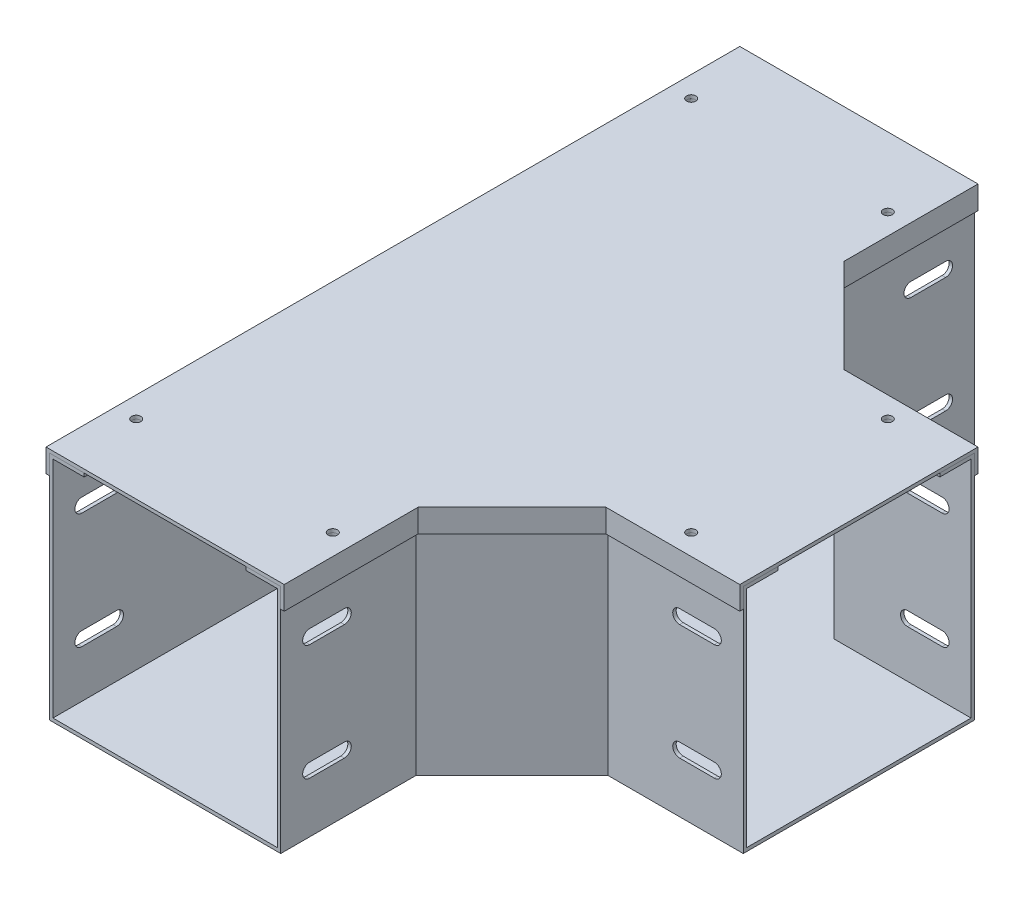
ISO-10303-21;
HEADER;
FILE_DESCRIPTION(('STEP AP214'),'2;1');
FILE_NAME('part.step','',(''),(''),'','','');
FILE_SCHEMA(('AUTOMOTIVE_DESIGN { 1 0 10303 214 1 1 1 1 }'));
ENDSEC;
DATA;
#1=APPLICATION_CONTEXT('core data for automotive mechanical design processes');
#2=APPLICATION_PROTOCOL_DEFINITION('international standard','automotive_design',2000,#1);
#3=PRODUCT_CONTEXT('',#1,'mechanical');
#4=PRODUCT('Part','Part','',(#3));
#5=PRODUCT_RELATED_PRODUCT_CATEGORY('part','',(#4));
#6=PRODUCT_DEFINITION_FORMATION('','',#4);
#7=PRODUCT_DEFINITION_CONTEXT('part definition',#1,'design');
#8=PRODUCT_DEFINITION('design','',#6,#7);
#9=PRODUCT_DEFINITION_SHAPE('','',#8);
#10=(LENGTH_UNIT() NAMED_UNIT(*) SI_UNIT(.MILLI.,.METRE.));
#11=(NAMED_UNIT(*) PLANE_ANGLE_UNIT() SI_UNIT($,.RADIAN.));
#12=(NAMED_UNIT(*) SI_UNIT($,.STERADIAN.) SOLID_ANGLE_UNIT());
#13=UNCERTAINTY_MEASURE_WITH_UNIT(LENGTH_MEASURE(1.E-05),#10,'distance_accuracy_value','');
#14=(GEOMETRIC_REPRESENTATION_CONTEXT(3) GLOBAL_UNCERTAINTY_ASSIGNED_CONTEXT((#13)) GLOBAL_UNIT_ASSIGNED_CONTEXT((#10,
#11,#12)) REPRESENTATION_CONTEXT('',''));
#15=CARTESIAN_POINT('',(0.,0.,0.));
#16=DIRECTION('',(0.,0.,1.));
#17=DIRECTION('',(1.,0.,0.));
#18=AXIS2_PLACEMENT_3D('',#15,#16,#17);
#19=CARTESIAN_POINT('',(49.9999999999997,51.5,-150.));
#20=DIRECTION('',(0.,0.,1.));
#21=DIRECTION('',(1.,0.,0.));
#22=AXIS2_PLACEMENT_3D('',#19,#20,#21);
#23=PLANE('',#22);
#24=DIRECTION('',(-1.,0.,0.));
#25=VECTOR('',#24,1.);
#26=CARTESIAN_POINT('',(49.9999999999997,50.,-150.));
#27=LINE('',#26,#25);
#28=CARTESIAN_POINT('',(49.9999999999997,50.,-150.));
#29=VERTEX_POINT('',#28);
#30=CARTESIAN_POINT('',(-50.0000000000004,50.,-150.));
#31=VERTEX_POINT('',#30);
#32=EDGE_CURVE('E331',#29,#31,#27,.T.);
#33=ORIENTED_EDGE('',*,*,#32,.T.);
#34=DIRECTION('',(0.,1.,0.));
#35=VECTOR('',#34,1.);
#36=CARTESIAN_POINT('',(-50.0000000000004,41.5,-150.));
#37=LINE('',#36,#35);
#38=CARTESIAN_POINT('',(-50.0000000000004,41.5,-150.));
#39=VERTEX_POINT('',#38);
#40=EDGE_CURVE('E261',#39,#31,#37,.T.);
#41=ORIENTED_EDGE('',*,*,#40,.F.);
#42=DIRECTION('',(1.,0.,0.));
#43=VECTOR('',#42,1.);
#44=CARTESIAN_POINT('',(-51.5000000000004,41.5,-150.));
#45=LINE('',#44,#43);
#46=CARTESIAN_POINT('',(-51.5000000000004,41.5,-150.));
#47=VERTEX_POINT('',#46);
#48=EDGE_CURVE('E252',#47,#39,#45,.T.);
#49=ORIENTED_EDGE('',*,*,#48,.F.);
#50=DIRECTION('',(0.,1.,0.));
#51=VECTOR('',#50,1.);
#52=CARTESIAN_POINT('',(-51.5000000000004,41.5,-150.));
#53=LINE('',#52,#51);
#54=CARTESIAN_POINT('',(-51.5000000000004,51.5,-150.));
#55=VERTEX_POINT('',#54);
#56=EDGE_CURVE('E257',#47,#55,#53,.T.);
#57=ORIENTED_EDGE('',*,*,#56,.T.);
#58=DIRECTION('',(-1.,0.,0.));
#59=VECTOR('',#58,1.);
#60=CARTESIAN_POINT('',(49.9999999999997,51.5,-150.));
#61=LINE('',#60,#59);
#62=CARTESIAN_POINT('',(51.4999999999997,51.5,-150.));
#63=VERTEX_POINT('',#62);
#64=EDGE_CURVE('E320',#63,#55,#61,.T.);
#65=ORIENTED_EDGE('',*,*,#64,.F.);
#66=DIRECTION('',(0.,1.,0.));
#67=VECTOR('',#66,1.);
#68=CARTESIAN_POINT('',(51.4999999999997,41.5,-150.));
#69=LINE('',#68,#67);
#70=CARTESIAN_POINT('',(51.4999999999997,41.5,-150.));
#71=VERTEX_POINT('',#70);
#72=EDGE_CURVE('E291',#71,#63,#69,.T.);
#73=ORIENTED_EDGE('',*,*,#72,.F.);
#74=DIRECTION('',(1.,0.,0.));
#75=VECTOR('',#74,1.);
#76=CARTESIAN_POINT('',(49.9999999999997,41.5,-150.));
#77=LINE('',#76,#75);
#78=CARTESIAN_POINT('',(49.9999999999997,41.5,-150.));
#79=VERTEX_POINT('',#78);
#80=EDGE_CURVE('E274',#79,#71,#77,.T.);
#81=ORIENTED_EDGE('',*,*,#80,.F.);
#82=DIRECTION('',(0.,1.,0.));
#83=VECTOR('',#82,1.);
#84=CARTESIAN_POINT('',(49.9999999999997,41.5,-150.));
#85=LINE('',#84,#83);
#86=EDGE_CURVE('E315',#79,#29,#85,.T.);
#87=ORIENTED_EDGE('',*,*,#86,.T.);
#88=EDGE_LOOP('',(#33,#41,#49,#57,#65,#73,#81,#87));
#89=FACE_BOUND('',#88,.T.);
#90=ADVANCED_FACE('F42',(#89),#23,.F.);
#91=CARTESIAN_POINT('',(-50.0000000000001,51.5,150.000000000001));
#92=DIRECTION('',(0.,0.,-1.));
#93=DIRECTION('',(-1.,0.,0.));
#94=AXIS2_PLACEMENT_3D('',#91,#92,#93);
#95=PLANE('',#94);
#96=DIRECTION('',(1.,0.,0.));
#97=VECTOR('',#96,1.);
#98=CARTESIAN_POINT('',(-50.0000000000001,50.,150.000000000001));
#99=LINE('',#98,#97);
#100=CARTESIAN_POINT('',(-50.0000000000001,50.,150.000000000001));
#101=VERTEX_POINT('',#100);
#102=CARTESIAN_POINT('',(49.9999999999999,50.,150.000000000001));
#103=VERTEX_POINT('',#102);
#104=EDGE_CURVE('E340',#101,#103,#99,.T.);
#105=ORIENTED_EDGE('',*,*,#104,.T.);
#106=DIRECTION('',(0.,1.,0.));
#107=VECTOR('',#106,1.);
#108=CARTESIAN_POINT('',(49.9999999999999,41.5,150.000000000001));
#109=LINE('',#108,#107);
#110=CARTESIAN_POINT('',(49.9999999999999,41.5,150.000000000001));
#111=VERTEX_POINT('',#110);
#112=EDGE_CURVE('E235',#111,#103,#109,.T.);
#113=ORIENTED_EDGE('',*,*,#112,.F.);
#114=DIRECTION('',(-1.,0.,0.));
#115=VECTOR('',#114,1.);
#116=CARTESIAN_POINT('',(51.4999999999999,41.5,150.000000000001));
#117=LINE('',#116,#115);
#118=CARTESIAN_POINT('',(51.4999999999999,41.5,150.000000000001));
#119=VERTEX_POINT('',#118);
#120=EDGE_CURVE('E217',#119,#111,#117,.T.);
#121=ORIENTED_EDGE('',*,*,#120,.F.);
#122=DIRECTION('',(0.,1.,0.));
#123=VECTOR('',#122,1.);
#124=CARTESIAN_POINT('',(51.4999999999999,41.5,150.000000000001));
#125=LINE('',#124,#123);
#126=CARTESIAN_POINT('',(51.4999999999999,51.5,150.000000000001));
#127=VERTEX_POINT('',#126);
#128=EDGE_CURVE('E232',#119,#127,#125,.T.);
#129=ORIENTED_EDGE('',*,*,#128,.T.);
#130=DIRECTION('',(1.,0.,0.));
#131=VECTOR('',#130,1.);
#132=CARTESIAN_POINT('',(-50.0000000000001,51.5,150.000000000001));
#133=LINE('',#132,#131);
#134=CARTESIAN_POINT('',(-51.5000000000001,51.5,150.000000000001));
#135=VERTEX_POINT('',#134);
#136=EDGE_CURVE('E50',#135,#127,#133,.T.);
#137=ORIENTED_EDGE('',*,*,#136,.F.);
#138=DIRECTION('',(0.,1.,0.));
#139=VECTOR('',#138,1.);
#140=CARTESIAN_POINT('',(-51.5000000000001,41.5,150.000000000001));
#141=LINE('',#140,#139);
#142=CARTESIAN_POINT('',(-51.5000000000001,41.5,150.000000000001));
#143=VERTEX_POINT('',#142);
#144=EDGE_CURVE('E254',#143,#135,#141,.T.);
#145=ORIENTED_EDGE('',*,*,#144,.F.);
#146=DIRECTION('',(-1.,0.,0.));
#147=VECTOR('',#146,1.);
#148=CARTESIAN_POINT('',(-50.0000000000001,41.5,150.000000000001));
#149=LINE('',#148,#147);
#150=CARTESIAN_POINT('',(-50.0000000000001,41.5,150.000000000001));
#151=VERTEX_POINT('',#150);
#152=EDGE_CURVE('E248',#151,#143,#149,.T.);
#153=ORIENTED_EDGE('',*,*,#152,.F.);
#154=DIRECTION('',(0.,1.,0.));
#155=VECTOR('',#154,1.);
#156=CARTESIAN_POINT('',(-50.0000000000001,41.5,150.000000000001));
#157=LINE('',#156,#155);
#158=EDGE_CURVE('E270',#151,#101,#157,.T.);
#159=ORIENTED_EDGE('',*,*,#158,.T.);
#160=EDGE_LOOP('',(#105,#113,#121,#129,#137,#145,#153,#159));
#161=FACE_BOUND('',#160,.T.);
#162=ADVANCED_FACE('F405',(#161),#95,.F.);
#163=CARTESIAN_POINT('',(150.000000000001,51.5,50.0000000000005));
#164=DIRECTION('',(-1.,0.,0.));
#165=DIRECTION('',(0.,0.,1.));
#166=AXIS2_PLACEMENT_3D('',#163,#164,#165);
#167=PLANE('',#166);
#168=DIRECTION('',(0.,0.,-1.));
#169=VECTOR('',#168,1.);
#170=CARTESIAN_POINT('',(150.000000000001,50.,50.0000000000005));
#171=LINE('',#170,#169);
#172=CARTESIAN_POINT('',(150.000000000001,50.,50.0000000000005));
#173=VERTEX_POINT('',#172);
#174=CARTESIAN_POINT('',(150.000000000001,50.,-49.9999999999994));
#175=VERTEX_POINT('',#174);
#176=EDGE_CURVE('E58',#173,#175,#171,.T.);
#177=ORIENTED_EDGE('',*,*,#176,.T.);
#178=DIRECTION('',(0.,1.,0.));
#179=VECTOR('',#178,1.);
#180=CARTESIAN_POINT('',(150.000000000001,41.5,-49.9999999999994));
#181=LINE('',#180,#179);
#182=CARTESIAN_POINT('',(150.000000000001,41.5,-49.9999999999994));
#183=VERTEX_POINT('',#182);
#184=EDGE_CURVE('E306',#183,#175,#181,.T.);
#185=ORIENTED_EDGE('',*,*,#184,.F.);
#186=DIRECTION('',(0.,0.,1.));
#187=VECTOR('',#186,1.);
#188=CARTESIAN_POINT('',(150.000000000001,41.5,-51.4999999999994));
#189=LINE('',#188,#187);
#190=CARTESIAN_POINT('',(150.000000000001,41.5,-51.4999999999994));
#191=VERTEX_POINT('',#190);
#192=EDGE_CURVE('E283',#191,#183,#189,.T.);
#193=ORIENTED_EDGE('',*,*,#192,.F.);
#194=DIRECTION('',(0.,1.,0.));
#195=VECTOR('',#194,1.);
#196=CARTESIAN_POINT('',(150.000000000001,41.5,-51.4999999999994));
#197=LINE('',#196,#195);
#198=CARTESIAN_POINT('',(150.000000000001,51.5,-51.4999999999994));
#199=VERTEX_POINT('',#198);
#200=EDGE_CURVE('E304',#191,#199,#197,.T.);
#201=ORIENTED_EDGE('',*,*,#200,.T.);
#202=DIRECTION('',(0.,0.,-1.));
#203=VECTOR('',#202,1.);
#204=CARTESIAN_POINT('',(150.000000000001,51.5,50.0000000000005));
#205=LINE('',#204,#203);
#206=CARTESIAN_POINT('',(150.000000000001,51.5,51.5000000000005));
#207=VERTEX_POINT('',#206);
#208=EDGE_CURVE('E12',#207,#199,#205,.T.);
#209=ORIENTED_EDGE('',*,*,#208,.F.);
#210=DIRECTION('',(0.,1.,0.));
#211=VECTOR('',#210,1.);
#212=CARTESIAN_POINT('',(150.000000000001,41.5,51.5000000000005));
#213=LINE('',#212,#211);
#214=CARTESIAN_POINT('',(150.000000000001,41.5,51.5000000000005));
#215=VERTEX_POINT('',#214);
#216=EDGE_CURVE('E192',#215,#207,#213,.T.);
#217=ORIENTED_EDGE('',*,*,#216,.F.);
#218=DIRECTION('',(0.,0.,1.));
#219=VECTOR('',#218,1.);
#220=CARTESIAN_POINT('',(150.000000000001,41.5,50.0000000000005));
#221=LINE('',#220,#219);
#222=CARTESIAN_POINT('',(150.000000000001,41.5,50.0000000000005));
#223=VERTEX_POINT('',#222);
#224=EDGE_CURVE('E180',#223,#215,#221,.T.);
#225=ORIENTED_EDGE('',*,*,#224,.F.);
#226=DIRECTION('',(0.,1.,0.));
#227=VECTOR('',#226,1.);
#228=CARTESIAN_POINT('',(150.000000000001,41.5,50.0000000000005));
#229=LINE('',#228,#227);
#230=EDGE_CURVE('E198',#223,#173,#229,.T.);
#231=ORIENTED_EDGE('',*,*,#230,.T.);
#232=EDGE_LOOP('',(#177,#185,#193,#201,#209,#217,#225,#231));
#233=FACE_BOUND('',#232,.T.);
#234=ADVANCED_FACE('F193',(#233),#167,.F.);
#235=CARTESIAN_POINT('',(0.,51.5,0.));
#236=DIRECTION('',(0.,-1.,0.));
#237=DIRECTION('',(0.,0.,-1.));
#238=AXIS2_PLACEMENT_3D('',#235,#236,#237);
#239=PLANE('',#238);
#240=CARTESIAN_POINT('',(-42.5000000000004,51.5,-120.));
#241=DIRECTION('',(0.,1.,0.));
#242=DIRECTION('',(0.,0.,1.));
#243=AXIS2_PLACEMENT_3D('',#240,#241,#242);
#244=CIRCLE('',#243,2.);
#245=CARTESIAN_POINT('',(-42.5000000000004,51.5,-118.));
#246=VERTEX_POINT('',#245);
#247=EDGE_CURVE('E492',#246,#246,#244,.T.);
#248=ORIENTED_EDGE('',*,*,#247,.F.);
#249=EDGE_LOOP('',(#248));
#250=FACE_BOUND('',#249,.T.);
#251=CARTESIAN_POINT('',(-42.5000000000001,51.5,120.000000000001));
#252=DIRECTION('',(0.,1.,0.));
#253=DIRECTION('',(0.,0.,1.));
#254=AXIS2_PLACEMENT_3D('',#251,#252,#253);
#255=CIRCLE('',#254,2.);
#256=CARTESIAN_POINT('',(-42.5000000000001,51.5,122.000000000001));
#257=VERTEX_POINT('',#256);
#258=EDGE_CURVE('E496',#257,#257,#255,.T.);
#259=ORIENTED_EDGE('',*,*,#258,.F.);
#260=EDGE_LOOP('',(#259));
#261=FACE_BOUND('',#260,.T.);
#262=CARTESIAN_POINT('',(42.4999999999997,51.5,120.000000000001));
#263=DIRECTION('',(0.,1.,0.));
#264=DIRECTION('',(0.,0.,1.));
#265=AXIS2_PLACEMENT_3D('',#262,#263,#264);
#266=CIRCLE('',#265,2.);
#267=CARTESIAN_POINT('',(42.4999999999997,51.5,122.000000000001));
#268=VERTEX_POINT('',#267);
#269=EDGE_CURVE('E503',#268,#268,#266,.T.);
#270=ORIENTED_EDGE('',*,*,#269,.F.);
#271=EDGE_LOOP('',(#270));
#272=FACE_BOUND('',#271,.T.);
#273=CARTESIAN_POINT('',(120.000000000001,51.5,42.5000000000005));
#274=DIRECTION('',(0.,1.,0.));
#275=DIRECTION('',(0.,0.,1.));
#276=AXIS2_PLACEMENT_3D('',#273,#274,#275);
#277=CIRCLE('',#276,2.);
#278=CARTESIAN_POINT('',(120.000000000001,51.5,44.5000000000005));
#279=VERTEX_POINT('',#278);
#280=EDGE_CURVE('E509',#279,#279,#277,.T.);
#281=ORIENTED_EDGE('',*,*,#280,.F.);
#282=EDGE_LOOP('',(#281));
#283=FACE_BOUND('',#282,.T.);
#284=CARTESIAN_POINT('',(120.000000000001,51.5,-42.4999999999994));
#285=DIRECTION('',(0.,1.,0.));
#286=DIRECTION('',(0.,0.,1.));
#287=AXIS2_PLACEMENT_3D('',#284,#285,#286);
#288=CIRCLE('',#287,2.);
#289=CARTESIAN_POINT('',(120.000000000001,51.5,-40.4999999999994));
#290=VERTEX_POINT('',#289);
#291=EDGE_CURVE('E515',#290,#290,#288,.T.);
#292=ORIENTED_EDGE('',*,*,#291,.F.);
#293=EDGE_LOOP('',(#292));
#294=FACE_BOUND('',#293,.T.);
#295=CARTESIAN_POINT('',(42.4999999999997,51.5,-120.));
#296=DIRECTION('',(0.,1.,0.));
#297=DIRECTION('',(0.,0.,1.));
#298=AXIS2_PLACEMENT_3D('',#295,#296,#297);
#299=CIRCLE('',#298,2.);
#300=CARTESIAN_POINT('',(42.4999999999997,51.5,-118.));
#301=VERTEX_POINT('',#300);
#302=EDGE_CURVE('E225',#301,#301,#299,.T.);
#303=ORIENTED_EDGE('',*,*,#302,.F.);
#304=EDGE_LOOP('',(#303));
#305=FACE_BOUND('',#304,.T.);
#306=ORIENTED_EDGE('',*,*,#208,.T.);
#307=DIRECTION('',(-1.,0.,0.));
#308=VECTOR('',#307,1.);
#309=CARTESIAN_POINT('',(150.000000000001,51.5,-51.4999999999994));
#310=LINE('',#309,#308);
#311=CARTESIAN_POINT('',(92.0426765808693,51.5,-51.499999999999));
#312=VERTEX_POINT('',#311);
#313=EDGE_CURVE('E294',#199,#312,#310,.T.);
#314=ORIENTED_EDGE('',*,*,#313,.T.);
#315=DIRECTION('',(-0.707106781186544,0.,-0.707106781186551));
#316=VECTOR('',#315,1.);
#317=CARTESIAN_POINT('',(92.4820164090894,51.5,-51.0606601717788));
#318=LINE('',#317,#316);
#319=CARTESIAN_POINT('',(51.4999999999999,51.5,-92.0426765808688));
#320=VERTEX_POINT('',#319);
#321=EDGE_CURVE('E275',#312,#320,#318,.T.);
#322=ORIENTED_EDGE('',*,*,#321,.T.);
#323=DIRECTION('',(0.,0.,-1.));
#324=VECTOR('',#323,1.);
#325=CARTESIAN_POINT('',(51.4999999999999,51.5,-91.4213562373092));
#326=LINE('',#325,#324);
#327=EDGE_CURVE('E260',#320,#63,#326,.T.);
#328=ORIENTED_EDGE('',*,*,#327,.T.);
#329=ORIENTED_EDGE('',*,*,#64,.T.);
#330=DIRECTION('',(0.,0.,1.));
#331=VECTOR('',#330,1.);
#332=CARTESIAN_POINT('',(-51.5000000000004,51.5,-150.));
#333=LINE('',#332,#331);
#334=EDGE_CURVE('E229',#55,#135,#333,.T.);
#335=ORIENTED_EDGE('',*,*,#334,.T.);
#336=ORIENTED_EDGE('',*,*,#136,.T.);
#337=DIRECTION('',(0.,0.,-1.));
#338=VECTOR('',#337,1.);
#339=CARTESIAN_POINT('',(51.4999999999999,51.5,150.000000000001));
#340=LINE('',#339,#338);
#341=CARTESIAN_POINT('',(51.4999999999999,51.5,92.0426765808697));
#342=VERTEX_POINT('',#341);
#343=EDGE_CURVE('E206',#127,#342,#340,.T.);
#344=ORIENTED_EDGE('',*,*,#343,.T.);
#345=DIRECTION('',(0.707106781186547,0.,-0.707106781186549));
#346=VECTOR('',#345,1.);
#347=CARTESIAN_POINT('',(51.0606601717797,51.5,92.4820164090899));
#348=LINE('',#347,#346);
#349=CARTESIAN_POINT('',(92.0426765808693,51.5,51.5000000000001));
#350=VERTEX_POINT('',#349);
#351=EDGE_CURVE('E203',#342,#350,#348,.T.);
#352=ORIENTED_EDGE('',*,*,#351,.T.);
#353=DIRECTION('',(1.,0.,0.));
#354=VECTOR('',#353,1.);
#355=CARTESIAN_POINT('',(91.4213562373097,51.5,51.5000000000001));
#356=LINE('',#355,#354);
#357=EDGE_CURVE('E223',#350,#207,#356,.T.);
#358=ORIENTED_EDGE('',*,*,#357,.T.);
#359=EDGE_LOOP('',(#306,#314,#322,#328,#329,#335,#336,#344,#352,#358));
#360=FACE_BOUND('',#359,.T.);
#361=ADVANCED_FACE('F367',(#250,#261,#272,#283,#294,#305,#360),#239,.F.);
#362=CARTESIAN_POINT('',(0.,50.,0.));
#363=DIRECTION('',(0.,-1.,0.));
#364=DIRECTION('',(0.,0.,-1.));
#365=AXIS2_PLACEMENT_3D('',#362,#363,#364);
#366=PLANE('',#365);
#367=CARTESIAN_POINT('',(-42.5000000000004,50.,-120.));
#368=DIRECTION('',(0.,-1.,0.));
#369=DIRECTION('',(0.,0.,-1.));
#370=AXIS2_PLACEMENT_3D('',#367,#368,#369);
#371=CIRCLE('',#370,2.);
#372=CARTESIAN_POINT('',(-42.5000000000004,50.,-122.));
#373=VERTEX_POINT('',#372);
#374=EDGE_CURVE('E489',#373,#373,#371,.F.);
#375=ORIENTED_EDGE('',*,*,#374,.T.);
#376=EDGE_LOOP('',(#375));
#377=FACE_BOUND('',#376,.T.);
#378=CARTESIAN_POINT('',(-42.5000000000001,50.,120.000000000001));
#379=DIRECTION('',(0.,-1.,0.));
#380=DIRECTION('',(0.,0.,-1.));
#381=AXIS2_PLACEMENT_3D('',#378,#379,#380);
#382=CIRCLE('',#381,2.);
#383=CARTESIAN_POINT('',(-42.5000000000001,50.,118.000000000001));
#384=VERTEX_POINT('',#383);
#385=EDGE_CURVE('E493',#384,#384,#382,.F.);
#386=ORIENTED_EDGE('',*,*,#385,.T.);
#387=EDGE_LOOP('',(#386));
#388=FACE_BOUND('',#387,.T.);
#389=CARTESIAN_POINT('',(42.4999999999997,50.,120.000000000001));
#390=DIRECTION('',(0.,-1.,0.));
#391=DIRECTION('',(0.,0.,-1.));
#392=AXIS2_PLACEMENT_3D('',#389,#390,#391);
#393=CIRCLE('',#392,2.);
#394=CARTESIAN_POINT('',(42.4999999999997,50.,118.000000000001));
#395=VERTEX_POINT('',#394);
#396=EDGE_CURVE('E501',#395,#395,#393,.F.);
#397=ORIENTED_EDGE('',*,*,#396,.T.);
#398=EDGE_LOOP('',(#397));
#399=FACE_BOUND('',#398,.T.);
#400=CARTESIAN_POINT('',(120.000000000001,50.,42.5000000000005));
#401=DIRECTION('',(0.,-1.,0.));
#402=DIRECTION('',(0.,0.,-1.));
#403=AXIS2_PLACEMENT_3D('',#400,#401,#402);
#404=CIRCLE('',#403,2.);
#405=CARTESIAN_POINT('',(120.000000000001,50.,40.5000000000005));
#406=VERTEX_POINT('',#405);
#407=EDGE_CURVE('E506',#406,#406,#404,.F.);
#408=ORIENTED_EDGE('',*,*,#407,.T.);
#409=EDGE_LOOP('',(#408));
#410=FACE_BOUND('',#409,.T.);
#411=CARTESIAN_POINT('',(120.000000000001,50.,-42.4999999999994));
#412=DIRECTION('',(0.,-1.,0.));
#413=DIRECTION('',(0.,0.,-1.));
#414=AXIS2_PLACEMENT_3D('',#411,#412,#413);
#415=CIRCLE('',#414,2.);
#416=CARTESIAN_POINT('',(120.000000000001,50.,-44.4999999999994));
#417=VERTEX_POINT('',#416);
#418=EDGE_CURVE('E512',#417,#417,#415,.F.);
#419=ORIENTED_EDGE('',*,*,#418,.T.);
#420=EDGE_LOOP('',(#419));
#421=FACE_BOUND('',#420,.T.);
#422=CARTESIAN_POINT('',(42.4999999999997,50.,-120.));
#423=DIRECTION('',(0.,-1.,0.));
#424=DIRECTION('',(0.,0.,-1.));
#425=AXIS2_PLACEMENT_3D('',#422,#423,#424);
#426=CIRCLE('',#425,2.);
#427=CARTESIAN_POINT('',(42.4999999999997,50.,-122.));
#428=VERTEX_POINT('',#427);
#429=EDGE_CURVE('E209',#428,#428,#426,.F.);
#430=ORIENTED_EDGE('',*,*,#429,.T.);
#431=EDGE_LOOP('',(#430));
#432=FACE_BOUND('',#431,.T.);
#433=DIRECTION('',(-1.,0.,0.));
#434=VECTOR('',#433,1.);
#435=CARTESIAN_POINT('',(150.000000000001,50.,-49.9999999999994));
#436=LINE('',#435,#434);
#437=CARTESIAN_POINT('',(91.4213562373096,50.,-49.999999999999));
#438=VERTEX_POINT('',#437);
#439=EDGE_CURVE('E301',#175,#438,#436,.T.);
#440=ORIENTED_EDGE('',*,*,#439,.F.);
#441=ORIENTED_EDGE('',*,*,#176,.F.);
#442=DIRECTION('',(1.,0.,0.));
#443=VECTOR('',#442,1.);
#444=CARTESIAN_POINT('',(91.4213562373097,50.,50.0000000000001));
#445=LINE('',#444,#443);
#446=CARTESIAN_POINT('',(91.4213562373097,50.,50.0000000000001));
#447=VERTEX_POINT('',#446);
#448=EDGE_CURVE('E65',#447,#173,#445,.T.);
#449=ORIENTED_EDGE('',*,*,#448,.F.);
#450=DIRECTION('',(0.707106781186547,0.,-0.707106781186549));
#451=VECTOR('',#450,1.);
#452=CARTESIAN_POINT('',(49.9999999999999,50.,91.42135623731));
#453=LINE('',#452,#451);
#454=CARTESIAN_POINT('',(49.9999999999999,50.,91.42135623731));
#455=VERTEX_POINT('',#454);
#456=EDGE_CURVE('E391',#455,#447,#453,.T.);
#457=ORIENTED_EDGE('',*,*,#456,.F.);
#458=DIRECTION('',(0.,0.,-1.));
#459=VECTOR('',#458,1.);
#460=CARTESIAN_POINT('',(49.9999999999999,50.,150.000000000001));
#461=LINE('',#460,#459);
#462=EDGE_CURVE('E334',#103,#455,#461,.T.);
#463=ORIENTED_EDGE('',*,*,#462,.F.);
#464=ORIENTED_EDGE('',*,*,#104,.F.);
#465=DIRECTION('',(0.,0.,1.));
#466=VECTOR('',#465,1.);
#467=CARTESIAN_POINT('',(-50.0000000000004,50.,-150.));
#468=LINE('',#467,#466);
#469=EDGE_CURVE('E337',#31,#101,#468,.T.);
#470=ORIENTED_EDGE('',*,*,#469,.F.);
#471=ORIENTED_EDGE('',*,*,#32,.F.);
#472=DIRECTION('',(0.,0.,-1.));
#473=VECTOR('',#472,1.);
#474=CARTESIAN_POINT('',(49.9999999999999,50.,-91.4213562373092));
#475=LINE('',#474,#473);
#476=CARTESIAN_POINT('',(49.9999999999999,50.,-91.4213562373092));
#477=VERTEX_POINT('',#476);
#478=EDGE_CURVE('E328',#477,#29,#475,.T.);
#479=ORIENTED_EDGE('',*,*,#478,.F.);
#480=DIRECTION('',(-0.707106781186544,0.,-0.707106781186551));
#481=VECTOR('',#480,1.);
#482=CARTESIAN_POINT('',(91.4213562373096,50.,-49.999999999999));
#483=LINE('',#482,#481);
#484=EDGE_CURVE('E325',#438,#477,#483,.T.);
#485=ORIENTED_EDGE('',*,*,#484,.F.);
#486=EDGE_LOOP('',(#440,#441,#449,#457,#463,#464,#470,#471,#479,#485));
#487=FACE_BOUND('',#486,.T.);
#488=ADVANCED_FACE('F350',(#377,#388,#399,#410,#421,#432,#487),#366,.T.);
#489=CARTESIAN_POINT('',(51.4999999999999,41.5,-91.4213562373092));
#490=DIRECTION('',(1.,0.,0.));
#491=DIRECTION('',(0.,0.,-1.));
#492=AXIS2_PLACEMENT_3D('',#489,#490,#491);
#493=PLANE('',#492);
#494=ORIENTED_EDGE('',*,*,#327,.F.);
#495=DIRECTION('',(0.,1.,0.));
#496=VECTOR('',#495,1.);
#497=CARTESIAN_POINT('',(51.4999999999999,41.5,-92.0426765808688));
#498=LINE('',#497,#496);
#499=CARTESIAN_POINT('',(51.4999999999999,41.5,-92.0426765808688));
#500=VERTEX_POINT('',#499);
#501=EDGE_CURVE('E299',#500,#320,#498,.T.);
#502=ORIENTED_EDGE('',*,*,#501,.F.);
#503=DIRECTION('',(0.,0.,-1.));
#504=VECTOR('',#503,1.);
#505=CARTESIAN_POINT('',(51.4999999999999,41.5,-91.4213562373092));
#506=LINE('',#505,#504);
#507=EDGE_CURVE('E271',#500,#71,#506,.T.);
#508=ORIENTED_EDGE('',*,*,#507,.T.);
#509=ORIENTED_EDGE('',*,*,#72,.T.);
#510=EDGE_LOOP('',(#494,#502,#508,#509));
#511=FACE_BOUND('',#510,.T.);
#512=ADVANCED_FACE('F371',(#511),#493,.T.);
#513=CARTESIAN_POINT('',(92.4820164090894,41.5,-51.0606601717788));
#514=DIRECTION('',(0.707106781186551,0.,-0.707106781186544));
#515=DIRECTION('',(-0.707106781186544,0.,-0.707106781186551));
#516=AXIS2_PLACEMENT_3D('',#513,#514,#515);
#517=PLANE('',#516);
#518=ORIENTED_EDGE('',*,*,#321,.F.);
#519=DIRECTION('',(0.,1.,0.));
#520=VECTOR('',#519,1.);
#521=CARTESIAN_POINT('',(92.0426765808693,41.5,-51.499999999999));
#522=LINE('',#521,#520);
#523=CARTESIAN_POINT('',(92.0426765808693,41.5,-51.499999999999));
#524=VERTEX_POINT('',#523);
#525=EDGE_CURVE('E302',#524,#312,#522,.T.);
#526=ORIENTED_EDGE('',*,*,#525,.F.);
#527=DIRECTION('',(-0.707106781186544,0.,-0.707106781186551));
#528=VECTOR('',#527,1.);
#529=CARTESIAN_POINT('',(92.4820164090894,41.5,-51.0606601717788));
#530=LINE('',#529,#528);
#531=EDGE_CURVE('E288',#524,#500,#530,.T.);
#532=ORIENTED_EDGE('',*,*,#531,.T.);
#533=ORIENTED_EDGE('',*,*,#501,.T.);
#534=EDGE_LOOP('',(#518,#526,#532,#533));
#535=FACE_BOUND('',#534,.T.);
#536=ADVANCED_FACE('F421',(#535),#517,.T.);
#537=CARTESIAN_POINT('',(150.000000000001,41.5,-51.4999999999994));
#538=DIRECTION('',(0.,0.,-1.));
#539=DIRECTION('',(-1.,0.,0.));
#540=AXIS2_PLACEMENT_3D('',#537,#538,#539);
#541=PLANE('',#540);
#542=ORIENTED_EDGE('',*,*,#313,.F.);
#543=ORIENTED_EDGE('',*,*,#200,.F.);
#544=DIRECTION('',(-1.,0.,0.));
#545=VECTOR('',#544,1.);
#546=CARTESIAN_POINT('',(150.000000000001,41.5,-51.4999999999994));
#547=LINE('',#546,#545);
#548=EDGE_CURVE('E285',#191,#524,#547,.T.);
#549=ORIENTED_EDGE('',*,*,#548,.T.);
#550=ORIENTED_EDGE('',*,*,#525,.T.);
#551=EDGE_LOOP('',(#542,#543,#549,#550));
#552=FACE_BOUND('',#551,.T.);
#553=ADVANCED_FACE('F428',(#552),#541,.T.);
#554=CARTESIAN_POINT('',(150.000000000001,41.5,-49.9999999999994));
#555=DIRECTION('',(0.,0.,-1.));
#556=DIRECTION('',(-1.,0.,0.));
#557=AXIS2_PLACEMENT_3D('',#554,#555,#556);
#558=PLANE('',#557);
#559=ORIENTED_EDGE('',*,*,#439,.T.);
#560=DIRECTION('',(0.,1.,0.));
#561=VECTOR('',#560,1.);
#562=CARTESIAN_POINT('',(91.4213562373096,41.5,-49.999999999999));
#563=LINE('',#562,#561);
#564=CARTESIAN_POINT('',(91.4213562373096,41.5,-49.999999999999));
#565=VERTEX_POINT('',#564);
#566=EDGE_CURVE('E309',#565,#438,#563,.T.);
#567=ORIENTED_EDGE('',*,*,#566,.F.);
#568=DIRECTION('',(-1.,0.,0.));
#569=VECTOR('',#568,1.);
#570=CARTESIAN_POINT('',(150.000000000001,41.5,-49.9999999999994));
#571=LINE('',#570,#569);
#572=EDGE_CURVE('E281',#183,#565,#571,.T.);
#573=ORIENTED_EDGE('',*,*,#572,.F.);
#574=ORIENTED_EDGE('',*,*,#184,.T.);
#575=EDGE_LOOP('',(#559,#567,#573,#574));
#576=FACE_BOUND('',#575,.T.);
#577=ADVANCED_FACE('F386',(#576),#558,.F.);
#578=CARTESIAN_POINT('',(91.4213562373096,41.5,-49.999999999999));
#579=DIRECTION('',(0.707106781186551,0.,-0.707106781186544));
#580=DIRECTION('',(-0.707106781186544,0.,-0.707106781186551));
#581=AXIS2_PLACEMENT_3D('',#578,#579,#580);
#582=PLANE('',#581);
#583=ORIENTED_EDGE('',*,*,#484,.T.);
#584=DIRECTION('',(0.,1.,0.));
#585=VECTOR('',#584,1.);
#586=CARTESIAN_POINT('',(49.9999999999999,41.5,-91.4213562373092));
#587=LINE('',#586,#585);
#588=CARTESIAN_POINT('',(49.9999999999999,41.5,-91.4213562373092));
#589=VERTEX_POINT('',#588);
#590=EDGE_CURVE('E312',#589,#477,#587,.T.);
#591=ORIENTED_EDGE('',*,*,#590,.F.);
#592=DIRECTION('',(-0.707106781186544,0.,-0.707106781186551));
#593=VECTOR('',#592,1.);
#594=CARTESIAN_POINT('',(91.4213562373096,41.5,-49.999999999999));
#595=LINE('',#594,#593);
#596=EDGE_CURVE('E279',#565,#589,#595,.T.);
#597=ORIENTED_EDGE('',*,*,#596,.F.);
#598=ORIENTED_EDGE('',*,*,#566,.T.);
#599=EDGE_LOOP('',(#583,#591,#597,#598));
#600=FACE_BOUND('',#599,.T.);
#601=ADVANCED_FACE('F382',(#600),#582,.F.);
#602=CARTESIAN_POINT('',(49.9999999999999,41.5,-91.4213562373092));
#603=DIRECTION('',(1.,0.,0.));
#604=DIRECTION('',(0.,0.,-1.));
#605=AXIS2_PLACEMENT_3D('',#602,#603,#604);
#606=PLANE('',#605);
#607=ORIENTED_EDGE('',*,*,#478,.T.);
#608=ORIENTED_EDGE('',*,*,#86,.F.);
#609=DIRECTION('',(0.,0.,-1.));
#610=VECTOR('',#609,1.);
#611=CARTESIAN_POINT('',(49.9999999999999,41.5,-91.4213562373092));
#612=LINE('',#611,#610);
#613=EDGE_CURVE('E277',#589,#79,#612,.T.);
#614=ORIENTED_EDGE('',*,*,#613,.F.);
#615=ORIENTED_EDGE('',*,*,#590,.T.);
#616=EDGE_LOOP('',(#607,#608,#614,#615));
#617=FACE_BOUND('',#616,.T.);
#618=ADVANCED_FACE('F380',(#617),#606,.F.);
#619=CARTESIAN_POINT('',(0.,41.5,0.));
#620=DIRECTION('',(0.,-1.,0.));
#621=DIRECTION('',(-1.,0.,0.));
#622=AXIS2_PLACEMENT_3D('',#619,#620,#621);
#623=PLANE('',#622);
#624=ORIENTED_EDGE('',*,*,#507,.F.);
#625=ORIENTED_EDGE('',*,*,#531,.F.);
#626=ORIENTED_EDGE('',*,*,#548,.F.);
#627=ORIENTED_EDGE('',*,*,#192,.T.);
#628=ORIENTED_EDGE('',*,*,#572,.T.);
#629=ORIENTED_EDGE('',*,*,#596,.T.);
#630=ORIENTED_EDGE('',*,*,#613,.T.);
#631=ORIENTED_EDGE('',*,*,#80,.T.);
#632=EDGE_LOOP('',(#624,#625,#626,#627,#628,#629,#630,#631));
#633=FACE_BOUND('',#632,.T.);
#634=ADVANCED_FACE('F374',(#633),#623,.T.);
#635=CARTESIAN_POINT('',(-50.0000000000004,41.5,-150.));
#636=DIRECTION('',(-1.,0.,0.));
#637=DIRECTION('',(0.,0.,1.));
#638=AXIS2_PLACEMENT_3D('',#635,#636,#637);
#639=PLANE('',#638);
#640=ORIENTED_EDGE('',*,*,#40,.T.);
#641=ORIENTED_EDGE('',*,*,#469,.T.);
#642=ORIENTED_EDGE('',*,*,#158,.F.);
#643=DIRECTION('',(0.,0.,1.));
#644=VECTOR('',#643,1.);
#645=CARTESIAN_POINT('',(-50.0000000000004,41.5,-150.));
#646=LINE('',#645,#644);
#647=EDGE_CURVE('E250',#39,#151,#646,.T.);
#648=ORIENTED_EDGE('',*,*,#647,.F.);
#649=EDGE_LOOP('',(#640,#641,#642,#648));
#650=FACE_BOUND('',#649,.T.);
#651=ADVANCED_FACE('F355',(#650),#639,.F.);
#652=CARTESIAN_POINT('',(-51.5000000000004,41.5,-150.));
#653=DIRECTION('',(-1.,0.,0.));
#654=DIRECTION('',(0.,0.,1.));
#655=AXIS2_PLACEMENT_3D('',#652,#653,#654);
#656=PLANE('',#655);
#657=ORIENTED_EDGE('',*,*,#334,.F.);
#658=ORIENTED_EDGE('',*,*,#56,.F.);
#659=DIRECTION('',(0.,0.,1.));
#660=VECTOR('',#659,1.);
#661=CARTESIAN_POINT('',(-51.5000000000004,41.5,-150.));
#662=LINE('',#661,#660);
#663=EDGE_CURVE('E245',#47,#143,#662,.T.);
#664=ORIENTED_EDGE('',*,*,#663,.T.);
#665=ORIENTED_EDGE('',*,*,#144,.T.);
#666=EDGE_LOOP('',(#657,#658,#664,#665));
#667=FACE_BOUND('',#666,.T.);
#668=ADVANCED_FACE('F365',(#667),#656,.T.);
#669=CARTESIAN_POINT('',(0.,41.5,0.));
#670=DIRECTION('',(0.,-1.,0.));
#671=DIRECTION('',(-1.,0.,0.));
#672=AXIS2_PLACEMENT_3D('',#669,#670,#671);
#673=PLANE('',#672);
#674=ORIENTED_EDGE('',*,*,#663,.F.);
#675=ORIENTED_EDGE('',*,*,#48,.T.);
#676=ORIENTED_EDGE('',*,*,#647,.T.);
#677=ORIENTED_EDGE('',*,*,#152,.T.);
#678=EDGE_LOOP('',(#674,#675,#676,#677));
#679=FACE_BOUND('',#678,.T.);
#680=ADVANCED_FACE('F359',(#679),#673,.T.);
#681=CARTESIAN_POINT('',(91.4213562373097,41.5,51.5000000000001));
#682=DIRECTION('',(0.,0.,1.));
#683=DIRECTION('',(1.,0.,0.));
#684=AXIS2_PLACEMENT_3D('',#681,#682,#683);
#685=PLANE('',#684);
#686=ORIENTED_EDGE('',*,*,#357,.F.);
#687=DIRECTION('',(0.,1.,0.));
#688=VECTOR('',#687,1.);
#689=CARTESIAN_POINT('',(92.0426765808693,41.5,51.5000000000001));
#690=LINE('',#689,#688);
#691=CARTESIAN_POINT('',(92.0426765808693,41.5,51.5000000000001));
#692=VERTEX_POINT('',#691);
#693=EDGE_CURVE('E202',#692,#350,#690,.T.);
#694=ORIENTED_EDGE('',*,*,#693,.F.);
#695=DIRECTION('',(1.,0.,0.));
#696=VECTOR('',#695,1.);
#697=CARTESIAN_POINT('',(91.4213562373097,41.5,51.5000000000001));
#698=LINE('',#697,#696);
#699=EDGE_CURVE('E185',#692,#215,#698,.T.);
#700=ORIENTED_EDGE('',*,*,#699,.T.);
#701=ORIENTED_EDGE('',*,*,#216,.T.);
#702=EDGE_LOOP('',(#686,#694,#700,#701));
#703=FACE_BOUND('',#702,.T.);
#704=ADVANCED_FACE('F201',(#703),#685,.T.);
#705=CARTESIAN_POINT('',(51.0606601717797,41.5,92.4820164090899));
#706=DIRECTION('',(0.707106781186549,0.,0.707106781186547));
#707=DIRECTION('',(0.707106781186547,0.,-0.707106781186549));
#708=AXIS2_PLACEMENT_3D('',#705,#706,#707);
#709=PLANE('',#708);
#710=ORIENTED_EDGE('',*,*,#351,.F.);
#711=DIRECTION('',(0.,1.,0.));
#712=VECTOR('',#711,1.);
#713=CARTESIAN_POINT('',(51.4999999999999,41.5,92.0426765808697));
#714=LINE('',#713,#712);
#715=CARTESIAN_POINT('',(51.4999999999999,41.5,92.0426765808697));
#716=VERTEX_POINT('',#715);
#717=EDGE_CURVE('E230',#716,#342,#714,.T.);
#718=ORIENTED_EDGE('',*,*,#717,.F.);
#719=DIRECTION('',(0.707106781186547,0.,-0.707106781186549));
#720=VECTOR('',#719,1.);
#721=CARTESIAN_POINT('',(51.0606601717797,41.5,92.4820164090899));
#722=LINE('',#721,#720);
#723=EDGE_CURVE('E199',#716,#692,#722,.T.);
#724=ORIENTED_EDGE('',*,*,#723,.T.);
#725=ORIENTED_EDGE('',*,*,#693,.T.);
#726=EDGE_LOOP('',(#710,#718,#724,#725));
#727=FACE_BOUND('',#726,.T.);
#728=ADVANCED_FACE('F445',(#727),#709,.T.);
#729=CARTESIAN_POINT('',(51.4999999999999,41.5,150.000000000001));
#730=DIRECTION('',(1.,0.,0.));
#731=DIRECTION('',(0.,0.,-1.));
#732=AXIS2_PLACEMENT_3D('',#729,#730,#731);
#733=PLANE('',#732);
#734=ORIENTED_EDGE('',*,*,#343,.F.);
#735=ORIENTED_EDGE('',*,*,#128,.F.);
#736=DIRECTION('',(0.,0.,-1.));
#737=VECTOR('',#736,1.);
#738=CARTESIAN_POINT('',(51.4999999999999,41.5,150.000000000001));
#739=LINE('',#738,#737);
#740=EDGE_CURVE('E219',#119,#716,#739,.T.);
#741=ORIENTED_EDGE('',*,*,#740,.T.);
#742=ORIENTED_EDGE('',*,*,#717,.T.);
#743=EDGE_LOOP('',(#734,#735,#741,#742));
#744=FACE_BOUND('',#743,.T.);
#745=ADVANCED_FACE('F452',(#744),#733,.T.);
#746=CARTESIAN_POINT('',(49.9999999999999,41.5,150.000000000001));
#747=DIRECTION('',(1.,0.,0.));
#748=DIRECTION('',(0.,0.,-1.));
#749=AXIS2_PLACEMENT_3D('',#746,#747,#748);
#750=PLANE('',#749);
#751=ORIENTED_EDGE('',*,*,#462,.T.);
#752=DIRECTION('',(0.,1.,0.));
#753=VECTOR('',#752,1.);
#754=CARTESIAN_POINT('',(49.9999999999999,41.5,91.42135623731));
#755=LINE('',#754,#753);
#756=CARTESIAN_POINT('',(49.9999999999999,41.5,91.42135623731));
#757=VERTEX_POINT('',#756);
#758=EDGE_CURVE('E238',#757,#455,#755,.T.);
#759=ORIENTED_EDGE('',*,*,#758,.F.);
#760=DIRECTION('',(0.,0.,-1.));
#761=VECTOR('',#760,1.);
#762=CARTESIAN_POINT('',(49.9999999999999,41.5,150.000000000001));
#763=LINE('',#762,#761);
#764=EDGE_CURVE('E215',#111,#757,#763,.T.);
#765=ORIENTED_EDGE('',*,*,#764,.F.);
#766=ORIENTED_EDGE('',*,*,#112,.T.);
#767=EDGE_LOOP('',(#751,#759,#765,#766));
#768=FACE_BOUND('',#767,.T.);
#769=ADVANCED_FACE('F398',(#768),#750,.F.);
#770=CARTESIAN_POINT('',(49.9999999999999,41.5,91.42135623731));
#771=DIRECTION('',(0.707106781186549,0.,0.707106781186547));
#772=DIRECTION('',(0.707106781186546,0.,-0.707106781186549));
#773=AXIS2_PLACEMENT_3D('',#770,#771,#772);
#774=PLANE('',#773);
#775=ORIENTED_EDGE('',*,*,#456,.T.);
#776=DIRECTION('',(0.,1.,0.));
#777=VECTOR('',#776,1.);
#778=CARTESIAN_POINT('',(91.4213562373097,41.5,50.0000000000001));
#779=LINE('',#778,#777);
#780=CARTESIAN_POINT('',(91.4213562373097,41.5,50.0000000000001));
#781=VERTEX_POINT('',#780);
#782=EDGE_CURVE('E241',#781,#447,#779,.T.);
#783=ORIENTED_EDGE('',*,*,#782,.F.);
#784=DIRECTION('',(0.707106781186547,0.,-0.707106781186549));
#785=VECTOR('',#784,1.);
#786=CARTESIAN_POINT('',(49.9999999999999,41.5,91.42135623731));
#787=LINE('',#786,#785);
#788=EDGE_CURVE('E213',#757,#781,#787,.T.);
#789=ORIENTED_EDGE('',*,*,#788,.F.);
#790=ORIENTED_EDGE('',*,*,#758,.T.);
#791=EDGE_LOOP('',(#775,#783,#789,#790));
#792=FACE_BOUND('',#791,.T.);
#793=ADVANCED_FACE('F402',(#792),#774,.F.);
#794=CARTESIAN_POINT('',(91.4213562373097,41.5,50.0000000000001));
#795=DIRECTION('',(0.,0.,1.));
#796=DIRECTION('',(1.,0.,0.));
#797=AXIS2_PLACEMENT_3D('',#794,#795,#796);
#798=PLANE('',#797);
#799=ORIENTED_EDGE('',*,*,#448,.T.);
#800=ORIENTED_EDGE('',*,*,#230,.F.);
#801=DIRECTION('',(1.,0.,0.));
#802=VECTOR('',#801,1.);
#803=CARTESIAN_POINT('',(91.4213562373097,41.5,50.0000000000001));
#804=LINE('',#803,#802);
#805=EDGE_CURVE('E188',#781,#223,#804,.T.);
#806=ORIENTED_EDGE('',*,*,#805,.F.);
#807=ORIENTED_EDGE('',*,*,#782,.T.);
#808=EDGE_LOOP('',(#799,#800,#806,#807));
#809=FACE_BOUND('',#808,.T.);
#810=ADVANCED_FACE('F389',(#809),#798,.F.);
#811=CARTESIAN_POINT('',(0.,41.5,0.));
#812=DIRECTION('',(0.,-1.,0.));
#813=DIRECTION('',(-1.,0.,0.));
#814=AXIS2_PLACEMENT_3D('',#811,#812,#813);
#815=PLANE('',#814);
#816=ORIENTED_EDGE('',*,*,#699,.F.);
#817=ORIENTED_EDGE('',*,*,#723,.F.);
#818=ORIENTED_EDGE('',*,*,#740,.F.);
#819=ORIENTED_EDGE('',*,*,#120,.T.);
#820=ORIENTED_EDGE('',*,*,#764,.T.);
#821=ORIENTED_EDGE('',*,*,#788,.T.);
#822=ORIENTED_EDGE('',*,*,#805,.T.);
#823=ORIENTED_EDGE('',*,*,#224,.T.);
#824=EDGE_LOOP('',(#816,#817,#818,#819,#820,#821,#822,#823));
#825=FACE_BOUND('',#824,.T.);
#826=ADVANCED_FACE('F182',(#825),#815,.T.);
#827=CARTESIAN_POINT('',(42.4999999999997,-50.001,-120.));
#828=DIRECTION('',(0.,1.,0.));
#829=DIRECTION('',(0.,0.,1.));
#830=AXIS2_PLACEMENT_3D('',#827,#828,#829);
#831=CYLINDRICAL_SURFACE('',#830,2.);
#832=ORIENTED_EDGE('',*,*,#429,.F.);
#833=EDGE_LOOP('',(#832));
#834=FACE_BOUND('',#833,.T.);
#835=ORIENTED_EDGE('',*,*,#302,.T.);
#836=EDGE_LOOP('',(#835));
#837=FACE_BOUND('',#836,.T.);
#838=ADVANCED_FACE('F461',(#834,#837),#831,.F.);
#839=CARTESIAN_POINT('',(120.000000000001,-50.001,-42.4999999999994));
#840=DIRECTION('',(0.,1.,0.));
#841=DIRECTION('',(0.,0.,1.));
#842=AXIS2_PLACEMENT_3D('',#839,#840,#841);
#843=CYLINDRICAL_SURFACE('',#842,2.);
#844=ORIENTED_EDGE('',*,*,#418,.F.);
#845=EDGE_LOOP('',(#844));
#846=FACE_BOUND('',#845,.T.);
#847=ORIENTED_EDGE('',*,*,#291,.T.);
#848=EDGE_LOOP('',(#847));
#849=FACE_BOUND('',#848,.T.);
#850=ADVANCED_FACE('F464',(#846,#849),#843,.F.);
#851=CARTESIAN_POINT('',(120.000000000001,-50.001,42.5000000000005));
#852=DIRECTION('',(0.,1.,0.));
#853=DIRECTION('',(0.,0.,1.));
#854=AXIS2_PLACEMENT_3D('',#851,#852,#853);
#855=CYLINDRICAL_SURFACE('',#854,2.);
#856=ORIENTED_EDGE('',*,*,#407,.F.);
#857=EDGE_LOOP('',(#856));
#858=FACE_BOUND('',#857,.T.);
#859=ORIENTED_EDGE('',*,*,#280,.T.);
#860=EDGE_LOOP('',(#859));
#861=FACE_BOUND('',#860,.T.);
#862=ADVANCED_FACE('F468',(#858,#861),#855,.F.);
#863=CARTESIAN_POINT('',(42.4999999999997,-50.001,120.000000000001));
#864=DIRECTION('',(0.,1.,0.));
#865=DIRECTION('',(0.,0.,1.));
#866=AXIS2_PLACEMENT_3D('',#863,#864,#865);
#867=CYLINDRICAL_SURFACE('',#866,2.);
#868=ORIENTED_EDGE('',*,*,#396,.F.);
#869=EDGE_LOOP('',(#868));
#870=FACE_BOUND('',#869,.T.);
#871=ORIENTED_EDGE('',*,*,#269,.T.);
#872=EDGE_LOOP('',(#871));
#873=FACE_BOUND('',#872,.T.);
#874=ADVANCED_FACE('F472',(#870,#873),#867,.F.);
#875=CARTESIAN_POINT('',(-42.5000000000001,-50.001,120.000000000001));
#876=DIRECTION('',(0.,1.,0.));
#877=DIRECTION('',(0.,0.,1.));
#878=AXIS2_PLACEMENT_3D('',#875,#876,#877);
#879=CYLINDRICAL_SURFACE('',#878,2.);
#880=ORIENTED_EDGE('',*,*,#385,.F.);
#881=EDGE_LOOP('',(#880));
#882=FACE_BOUND('',#881,.T.);
#883=ORIENTED_EDGE('',*,*,#258,.T.);
#884=EDGE_LOOP('',(#883));
#885=FACE_BOUND('',#884,.T.);
#886=ADVANCED_FACE('F476',(#882,#885),#879,.F.);
#887=CARTESIAN_POINT('',(-42.5000000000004,-50.001,-120.));
#888=DIRECTION('',(0.,1.,0.));
#889=DIRECTION('',(0.,0.,1.));
#890=AXIS2_PLACEMENT_3D('',#887,#888,#889);
#891=CYLINDRICAL_SURFACE('',#890,2.);
#892=ORIENTED_EDGE('',*,*,#374,.F.);
#893=EDGE_LOOP('',(#892));
#894=FACE_BOUND('',#893,.T.);
#895=ORIENTED_EDGE('',*,*,#247,.T.);
#896=EDGE_LOOP('',(#895));
#897=FACE_BOUND('',#896,.T.);
#898=ADVANCED_FACE('F480',(#894,#897),#891,.F.);
#899=CLOSED_SHELL('',(#90,#162,#234,#361,#488,#512,#536,#553,#577,#601,#618,#634,#651,#668,#680,
#704,#728,#745,#769,#793,#810,#826,#838,#850,#862,#874,#886,#898));
#900=MANIFOLD_SOLID_BREP('B2',#899);
#901=CARTESIAN_POINT('',(-50.0000000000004,-48.5,-150.));
#902=DIRECTION('',(1.,0.,0.));
#903=DIRECTION('',(0.,0.,-1.));
#904=AXIS2_PLACEMENT_3D('',#901,#902,#903);
#905=PLANE('',#904);
#906=DIRECTION('',(0.,0.,1.));
#907=VECTOR('',#906,1.);
#908=CARTESIAN_POINT('',(-50.0000000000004,-22.,-122.5));
#909=LINE('',#908,#907);
#910=CARTESIAN_POINT('',(-50.0000000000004,-22.,-137.5));
#911=VERTEX_POINT('',#910);
#912=CARTESIAN_POINT('',(-50.0000000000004,-22.,-122.5));
#913=VERTEX_POINT('',#912);
#914=EDGE_CURVE('E1333',#911,#913,#909,.T.);
#915=ORIENTED_EDGE('',*,*,#914,.T.);
#916=CARTESIAN_POINT('',(-50.0000000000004,-25.,-122.5));
#917=DIRECTION('',(1.,0.,0.));
#918=DIRECTION('',(0.,0.,-1.));
#919=AXIS2_PLACEMENT_3D('',#916,#917,#918);
#920=CIRCLE('',#919,3.);
#921=CARTESIAN_POINT('',(-50.0000000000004,-28.,-122.5));
#922=VERTEX_POINT('',#921);
#923=EDGE_CURVE('E1322',#913,#922,#920,.T.);
#924=ORIENTED_EDGE('',*,*,#923,.T.);
#925=DIRECTION('',(0.,0.,-1.));
#926=VECTOR('',#925,1.);
#927=CARTESIAN_POINT('',(-50.0000000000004,-28.,-122.5));
#928=LINE('',#927,#926);
#929=CARTESIAN_POINT('',(-50.0000000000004,-28.,-137.5));
#930=VERTEX_POINT('',#929);
#931=EDGE_CURVE('E1327',#922,#930,#928,.T.);
#932=ORIENTED_EDGE('',*,*,#931,.T.);
#933=CARTESIAN_POINT('',(-50.0000000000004,-25.,-137.5));
#934=DIRECTION('',(1.,0.,0.));
#935=DIRECTION('',(0.,0.,-1.));
#936=AXIS2_PLACEMENT_3D('',#933,#934,#935);
#937=CIRCLE('',#936,3.);
#938=EDGE_CURVE('E1330',#930,#911,#937,.T.);
#939=ORIENTED_EDGE('',*,*,#938,.T.);
#940=EDGE_LOOP('',(#915,#924,#932,#939));
#941=FACE_BOUND('',#940,.T.);
#942=DIRECTION('',(0.,0.,1.));
#943=VECTOR('',#942,1.);
#944=CARTESIAN_POINT('',(-50.0000000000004,28.,-122.5));
#945=LINE('',#944,#943);
#946=CARTESIAN_POINT('',(-50.0000000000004,28.,-137.5));
#947=VERTEX_POINT('',#946);
#948=CARTESIAN_POINT('',(-50.0000000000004,28.,-122.5));
#949=VERTEX_POINT('',#948);
#950=EDGE_CURVE('E1381',#947,#949,#945,.T.);
#951=ORIENTED_EDGE('',*,*,#950,.T.);
#952=CARTESIAN_POINT('',(-50.0000000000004,25.,-122.5));
#953=DIRECTION('',(1.,0.,0.));
#954=DIRECTION('',(0.,0.,-1.));
#955=AXIS2_PLACEMENT_3D('',#952,#953,#954);
#956=CIRCLE('',#955,3.);
#957=CARTESIAN_POINT('',(-50.0000000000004,22.,-122.5));
#958=VERTEX_POINT('',#957);
#959=EDGE_CURVE('E1372',#949,#958,#956,.T.);
#960=ORIENTED_EDGE('',*,*,#959,.T.);
#961=DIRECTION('',(0.,0.,-1.));
#962=VECTOR('',#961,1.);
#963=CARTESIAN_POINT('',(-50.0000000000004,22.,-122.5));
#964=LINE('',#963,#962);
#965=CARTESIAN_POINT('',(-50.0000000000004,22.,-137.5));
#966=VERTEX_POINT('',#965);
#967=EDGE_CURVE('E1375',#958,#966,#964,.T.);
#968=ORIENTED_EDGE('',*,*,#967,.T.);
#969=CARTESIAN_POINT('',(-50.0000000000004,25.,-137.5));
#970=DIRECTION('',(1.,0.,0.));
#971=DIRECTION('',(0.,0.,-1.));
#972=AXIS2_PLACEMENT_3D('',#969,#970,#971);
#973=CIRCLE('',#972,3.);
#974=EDGE_CURVE('E1378',#966,#947,#973,.T.);
#975=ORIENTED_EDGE('',*,*,#974,.T.);
#976=EDGE_LOOP('',(#951,#960,#968,#975));
#977=FACE_BOUND('',#976,.T.);
#978=DIRECTION('',(0.,0.,1.));
#979=VECTOR('',#978,1.);
#980=CARTESIAN_POINT('',(-50.0000000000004,-22.,137.500000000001));
#981=LINE('',#980,#979);
#982=CARTESIAN_POINT('',(-50.0000000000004,-22.,122.500000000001));
#983=VERTEX_POINT('',#982);
#984=CARTESIAN_POINT('',(-50.0000000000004,-22.,137.500000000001));
#985=VERTEX_POINT('',#984);
#986=EDGE_CURVE('E1429',#983,#985,#981,.T.);
#987=ORIENTED_EDGE('',*,*,#986,.T.);
#988=CARTESIAN_POINT('',(-50.0000000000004,-25.,137.500000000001));
#989=DIRECTION('',(1.,0.,0.));
#990=DIRECTION('',(0.,0.,-1.));
#991=AXIS2_PLACEMENT_3D('',#988,#989,#990);
#992=CIRCLE('',#991,3.);
#993=CARTESIAN_POINT('',(-50.0000000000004,-28.,137.500000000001));
#994=VERTEX_POINT('',#993);
#995=EDGE_CURVE('E1420',#985,#994,#992,.T.);
#996=ORIENTED_EDGE('',*,*,#995,.T.);
#997=DIRECTION('',(0.,0.,-1.));
#998=VECTOR('',#997,1.);
#999=CARTESIAN_POINT('',(-50.0000000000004,-28.,137.500000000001));
#1000=LINE('',#999,#998);
#1001=CARTESIAN_POINT('',(-50.0000000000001,-28.,122.500000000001));
#1002=VERTEX_POINT('',#1001);
#1003=EDGE_CURVE('E1423',#994,#1002,#1000,.T.);
#1004=ORIENTED_EDGE('',*,*,#1003,.T.);
#1005=CARTESIAN_POINT('',(-50.0000000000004,-25.,122.500000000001));
#1006=DIRECTION('',(1.,0.,0.));
#1007=DIRECTION('',(0.,0.,-1.));
#1008=AXIS2_PLACEMENT_3D('',#1005,#1006,#1007);
#1009=CIRCLE('',#1008,3.);
#1010=EDGE_CURVE('E1426',#1002,#983,#1009,.T.);
#1011=ORIENTED_EDGE('',*,*,#1010,.T.);
#1012=EDGE_LOOP('',(#987,#996,#1004,#1011));
#1013=FACE_BOUND('',#1012,.T.);
#1014=DIRECTION('',(0.,0.,1.));
#1015=VECTOR('',#1014,1.);
#1016=CARTESIAN_POINT('',(-50.0000000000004,28.,137.500000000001));
#1017=LINE('',#1016,#1015);
#1018=CARTESIAN_POINT('',(-50.0000000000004,28.,122.500000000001));
#1019=VERTEX_POINT('',#1018);
#1020=CARTESIAN_POINT('',(-50.0000000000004,28.,137.500000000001));
#1021=VERTEX_POINT('',#1020);
#1022=EDGE_CURVE('E1477',#1019,#1021,#1017,.T.);
#1023=ORIENTED_EDGE('',*,*,#1022,.T.);
#1024=CARTESIAN_POINT('',(-50.0000000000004,25.,137.500000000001));
#1025=DIRECTION('',(1.,0.,0.));
#1026=DIRECTION('',(0.,0.,-1.));
#1027=AXIS2_PLACEMENT_3D('',#1024,#1025,#1026);
#1028=CIRCLE('',#1027,3.);
#1029=CARTESIAN_POINT('',(-50.0000000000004,22.,137.500000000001));
#1030=VERTEX_POINT('',#1029);
#1031=EDGE_CURVE('E1468',#1021,#1030,#1028,.T.);
#1032=ORIENTED_EDGE('',*,*,#1031,.T.);
#1033=DIRECTION('',(0.,0.,-1.));
#1034=VECTOR('',#1033,1.);
#1035=CARTESIAN_POINT('',(-50.0000000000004,22.,137.500000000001));
#1036=LINE('',#1035,#1034);
#1037=CARTESIAN_POINT('',(-50.0000000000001,22.,122.500000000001));
#1038=VERTEX_POINT('',#1037);
#1039=EDGE_CURVE('E1471',#1030,#1038,#1036,.T.);
#1040=ORIENTED_EDGE('',*,*,#1039,.T.);
#1041=CARTESIAN_POINT('',(-50.0000000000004,25.,122.500000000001));
#1042=DIRECTION('',(1.,0.,0.));
#1043=DIRECTION('',(0.,0.,-1.));
#1044=AXIS2_PLACEMENT_3D('',#1041,#1042,#1043);
#1045=CIRCLE('',#1044,3.);
#1046=EDGE_CURVE('E1474',#1038,#1019,#1045,.T.);
#1047=ORIENTED_EDGE('',*,*,#1046,.T.);
#1048=EDGE_LOOP('',(#1023,#1032,#1040,#1047));
#1049=FACE_BOUND('',#1048,.T.);
#1050=DIRECTION('',(0.,0.,1.));
#1051=VECTOR('',#1050,1.);
#1052=CARTESIAN_POINT('',(-50.0000000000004,-50.,-150.));
#1053=LINE('',#1052,#1051);
#1054=CARTESIAN_POINT('',(-50.0000000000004,-50.,-150.));
#1055=VERTEX_POINT('',#1054);
#1056=CARTESIAN_POINT('',(-50.0000000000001,-50.,150.000000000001));
#1057=VERTEX_POINT('',#1056);
#1058=EDGE_CURVE('E1688',#1055,#1057,#1053,.T.);
#1059=ORIENTED_EDGE('',*,*,#1058,.T.);
#1060=DIRECTION('',(0.,-1.,0.));
#1061=VECTOR('',#1060,1.);
#1062=CARTESIAN_POINT('',(-50.0000000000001,-48.5,150.000000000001));
#1063=LINE('',#1062,#1061);
#1064=CARTESIAN_POINT('',(-50.0000000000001,50.,150.000000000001));
#1065=VERTEX_POINT('',#1064);
#1066=EDGE_CURVE('E1745',#1065,#1057,#1063,.T.);
#1067=ORIENTED_EDGE('',*,*,#1066,.F.);
#1068=DIRECTION('',(0.,0.,1.));
#1069=VECTOR('',#1068,1.);
#1070=CARTESIAN_POINT('',(-50.0000000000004,50.,-150.));
#1071=LINE('',#1070,#1069);
#1072=CARTESIAN_POINT('',(-50.0000000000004,50.,-150.));
#1073=VERTEX_POINT('',#1072);
#1074=EDGE_CURVE('E1644',#1073,#1065,#1071,.T.);
#1075=ORIENTED_EDGE('',*,*,#1074,.F.);
#1076=DIRECTION('',(0.,-1.,0.));
#1077=VECTOR('',#1076,1.);
#1078=CARTESIAN_POINT('',(-50.0000000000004,-48.5,-150.));
#1079=LINE('',#1078,#1077);
#1080=EDGE_CURVE('E1699',#1073,#1055,#1079,.T.);
#1081=ORIENTED_EDGE('',*,*,#1080,.T.);
#1082=EDGE_LOOP('',(#1059,#1067,#1075,#1081));
#1083=FACE_BOUND('',#1082,.T.);
#1084=ADVANCED_FACE('F738',(#941,#977,#1013,#1049,#1083),#905,.F.);
#1085=CARTESIAN_POINT('',(-50.0000000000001,-48.5,150.000000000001));
#1086=DIRECTION('',(0.,0.,-1.));
#1087=DIRECTION('',(-1.,0.,0.));
#1088=AXIS2_PLACEMENT_3D('',#1085,#1086,#1087);
#1089=PLANE('',#1088);
#1090=DIRECTION('',(1.,0.,0.));
#1091=VECTOR('',#1090,1.);
#1092=CARTESIAN_POINT('',(-50.0000000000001,-50.,150.000000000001));
#1093=LINE('',#1092,#1091);
#1094=CARTESIAN_POINT('',(49.9999999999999,-50.,150.000000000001));
#1095=VERTEX_POINT('',#1094);
#1096=EDGE_CURVE('E1702',#1057,#1095,#1093,.T.);
#1097=ORIENTED_EDGE('',*,*,#1096,.T.);
#1098=DIRECTION('',(0.,-1.,0.));
#1099=VECTOR('',#1098,1.);
#1100=CARTESIAN_POINT('',(49.9999999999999,-48.5,150.000000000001));
#1101=LINE('',#1100,#1099);
#1102=CARTESIAN_POINT('',(49.9999999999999,50.,150.000000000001));
#1103=VERTEX_POINT('',#1102);
#1104=EDGE_CURVE('E1743',#1103,#1095,#1101,.T.);
#1105=ORIENTED_EDGE('',*,*,#1104,.F.);
#1106=DIRECTION('',(1.,0.,0.));
#1107=VECTOR('',#1106,1.);
#1108=CARTESIAN_POINT('',(48.4999999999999,50.,150.000000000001));
#1109=LINE('',#1108,#1107);
#1110=CARTESIAN_POINT('',(34.9999999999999,50.,150.000000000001));
#1111=VERTEX_POINT('',#1110);
#1112=EDGE_CURVE('E1668',#1111,#1103,#1109,.T.);
#1113=ORIENTED_EDGE('',*,*,#1112,.F.);
#1114=DIRECTION('',(0.,1.,0.));
#1115=VECTOR('',#1114,1.);
#1116=CARTESIAN_POINT('',(34.9999999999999,48.5,150.000000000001));
#1117=LINE('',#1116,#1115);
#1118=CARTESIAN_POINT('',(34.9999999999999,48.5,150.000000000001));
#1119=VERTEX_POINT('',#1118);
#1120=EDGE_CURVE('E1291',#1119,#1111,#1117,.T.);
#1121=ORIENTED_EDGE('',*,*,#1120,.F.);
#1122=DIRECTION('',(-1.,0.,0.));
#1123=VECTOR('',#1122,1.);
#1124=CARTESIAN_POINT('',(49.9999999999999,48.5,150.000000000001));
#1125=LINE('',#1124,#1123);
#1126=CARTESIAN_POINT('',(48.4999999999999,48.5,150.000000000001));
#1127=VERTEX_POINT('',#1126);
#1128=EDGE_CURVE('E1283',#1127,#1119,#1125,.T.);
#1129=ORIENTED_EDGE('',*,*,#1128,.F.);
#1130=DIRECTION('',(0.,-1.,0.));
#1131=VECTOR('',#1130,1.);
#1132=CARTESIAN_POINT('',(48.4999999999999,50.,150.000000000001));
#1133=LINE('',#1132,#1131);
#1134=CARTESIAN_POINT('',(48.4999999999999,-48.5,150.000000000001));
#1135=VERTEX_POINT('',#1134);
#1136=EDGE_CURVE('E1677',#1127,#1135,#1133,.T.);
#1137=ORIENTED_EDGE('',*,*,#1136,.T.);
#1138=DIRECTION('',(1.,0.,0.));
#1139=VECTOR('',#1138,1.);
#1140=CARTESIAN_POINT('',(-50.0000000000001,-48.5,150.000000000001));
#1141=LINE('',#1140,#1139);
#1142=CARTESIAN_POINT('',(-48.5000000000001,-48.5,150.000000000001));
#1143=VERTEX_POINT('',#1142);
#1144=EDGE_CURVE('E1689',#1143,#1135,#1141,.T.);
#1145=ORIENTED_EDGE('',*,*,#1144,.F.);
#1146=DIRECTION('',(0.,-1.,0.));
#1147=VECTOR('',#1146,1.);
#1148=CARTESIAN_POINT('',(-48.5000000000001,50.,150.000000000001));
#1149=LINE('',#1148,#1147);
#1150=CARTESIAN_POINT('',(-48.5000000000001,48.5,150.000000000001));
#1151=VERTEX_POINT('',#1150);
#1152=EDGE_CURVE('E1650',#1151,#1143,#1149,.T.);
#1153=ORIENTED_EDGE('',*,*,#1152,.F.);
#1154=DIRECTION('',(-1.,0.,0.));
#1155=VECTOR('',#1154,1.);
#1156=CARTESIAN_POINT('',(-35.0000000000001,48.5,150.000000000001));
#1157=LINE('',#1156,#1155);
#1158=CARTESIAN_POINT('',(-35.0000000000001,48.5,150.000000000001));
#1159=VERTEX_POINT('',#1158);
#1160=EDGE_CURVE('E1309',#1159,#1151,#1157,.T.);
#1161=ORIENTED_EDGE('',*,*,#1160,.F.);
#1162=DIRECTION('',(0.,1.,0.));
#1163=VECTOR('',#1162,1.);
#1164=CARTESIAN_POINT('',(-35.0000000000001,48.5,150.000000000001));
#1165=LINE('',#1164,#1163);
#1166=CARTESIAN_POINT('',(-35.0000000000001,50.,150.000000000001));
#1167=VERTEX_POINT('',#1166);
#1168=EDGE_CURVE('E1316',#1159,#1167,#1165,.T.);
#1169=ORIENTED_EDGE('',*,*,#1168,.T.);
#1170=DIRECTION('',(1.,0.,0.));
#1171=VECTOR('',#1170,1.);
#1172=CARTESIAN_POINT('',(-50.0000000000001,50.,150.000000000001));
#1173=LINE('',#1172,#1171);
#1174=EDGE_CURVE('E1642',#1065,#1167,#1173,.T.);
#1175=ORIENTED_EDGE('',*,*,#1174,.F.);
#1176=ORIENTED_EDGE('',*,*,#1066,.T.);
#1177=EDGE_LOOP('',(#1097,#1105,#1113,#1121,#1129,#1137,#1145,#1153,#1161,#1169,#1175,#1176));
#1178=FACE_BOUND('',#1177,.T.);
#1179=ADVANCED_FACE('F1811',(#1178),#1089,.F.);
#1180=CARTESIAN_POINT('',(49.9999999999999,-48.5,150.000000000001));
#1181=DIRECTION('',(-1.,0.,0.));
#1182=DIRECTION('',(0.,0.,1.));
#1183=AXIS2_PLACEMENT_3D('',#1180,#1181,#1182);
#1184=PLANE('',#1183);
#1185=DIRECTION('',(0.,0.,1.));
#1186=VECTOR('',#1185,1.);
#1187=CARTESIAN_POINT('',(49.9999999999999,-28.,150.000000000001));
#1188=LINE('',#1187,#1186);
#1189=CARTESIAN_POINT('',(49.9999999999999,-28.,122.500000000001));
#1190=VERTEX_POINT('',#1189);
#1191=CARTESIAN_POINT('',(49.9999999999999,-28.,137.500000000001));
#1192=VERTEX_POINT('',#1191);
#1193=EDGE_CURVE('E1449',#1190,#1192,#1188,.T.);
#1194=ORIENTED_EDGE('',*,*,#1193,.T.);
#1195=CARTESIAN_POINT('',(49.9999999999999,-25.,137.500000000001));
#1196=DIRECTION('',(-1.,0.,0.));
#1197=DIRECTION('',(0.,0.,1.));
#1198=AXIS2_PLACEMENT_3D('',#1195,#1196,#1197);
#1199=CIRCLE('',#1198,3.);
#1200=CARTESIAN_POINT('',(49.9999999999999,-22.,137.500000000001));
#1201=VERTEX_POINT('',#1200);
#1202=EDGE_CURVE('E1465',#1192,#1201,#1199,.T.);
#1203=ORIENTED_EDGE('',*,*,#1202,.T.);
#1204=DIRECTION('',(0.,0.,-1.));
#1205=VECTOR('',#1204,1.);
#1206=CARTESIAN_POINT('',(49.9999999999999,-22.,150.000000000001));
#1207=LINE('',#1206,#1205);
#1208=CARTESIAN_POINT('',(49.9999999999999,-22.,122.500000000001));
#1209=VERTEX_POINT('',#1208);
#1210=EDGE_CURVE('E1460',#1201,#1209,#1207,.T.);
#1211=ORIENTED_EDGE('',*,*,#1210,.T.);
#1212=CARTESIAN_POINT('',(49.9999999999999,-25.,122.500000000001));
#1213=DIRECTION('',(-1.,0.,0.));
#1214=DIRECTION('',(0.,0.,1.));
#1215=AXIS2_PLACEMENT_3D('',#1212,#1213,#1214);
#1216=CIRCLE('',#1215,3.);
#1217=EDGE_CURVE('E1455',#1209,#1190,#1216,.T.);
#1218=ORIENTED_EDGE('',*,*,#1217,.T.);
#1219=EDGE_LOOP('',(#1194,#1203,#1211,#1218));
#1220=FACE_BOUND('',#1219,.T.);
#1221=DIRECTION('',(0.,0.,1.));
#1222=VECTOR('',#1221,1.);
#1223=CARTESIAN_POINT('',(49.9999999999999,22.,150.000000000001));
#1224=LINE('',#1223,#1222);
#1225=CARTESIAN_POINT('',(49.9999999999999,22.,122.500000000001));
#1226=VERTEX_POINT('',#1225);
#1227=CARTESIAN_POINT('',(49.9999999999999,22.,137.500000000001));
#1228=VERTEX_POINT('',#1227);
#1229=EDGE_CURVE('E1497',#1226,#1228,#1224,.T.);
#1230=ORIENTED_EDGE('',*,*,#1229,.T.);
#1231=CARTESIAN_POINT('',(49.9999999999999,25.,137.500000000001));
#1232=DIRECTION('',(-1.,0.,0.));
#1233=DIRECTION('',(0.,0.,1.));
#1234=AXIS2_PLACEMENT_3D('',#1231,#1232,#1233);
#1235=CIRCLE('',#1234,3.);
#1236=CARTESIAN_POINT('',(49.9999999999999,28.,137.500000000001));
#1237=VERTEX_POINT('',#1236);
#1238=EDGE_CURVE('E1513',#1228,#1237,#1235,.T.);
#1239=ORIENTED_EDGE('',*,*,#1238,.T.);
#1240=DIRECTION('',(0.,0.,-1.));
#1241=VECTOR('',#1240,1.);
#1242=CARTESIAN_POINT('',(49.9999999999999,28.,150.000000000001));
#1243=LINE('',#1242,#1241);
#1244=CARTESIAN_POINT('',(49.9999999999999,28.,122.500000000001));
#1245=VERTEX_POINT('',#1244);
#1246=EDGE_CURVE('E1508',#1237,#1245,#1243,.T.);
#1247=ORIENTED_EDGE('',*,*,#1246,.T.);
#1248=CARTESIAN_POINT('',(49.9999999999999,25.,122.500000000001));
#1249=DIRECTION('',(-1.,0.,0.));
#1250=DIRECTION('',(0.,0.,1.));
#1251=AXIS2_PLACEMENT_3D('',#1248,#1249,#1250);
#1252=CIRCLE('',#1251,3.);
#1253=EDGE_CURVE('E1503',#1245,#1226,#1252,.T.);
#1254=ORIENTED_EDGE('',*,*,#1253,.T.);
#1255=EDGE_LOOP('',(#1230,#1239,#1247,#1254));
#1256=FACE_BOUND('',#1255,.T.);
#1257=DIRECTION('',(0.,0.,-1.));
#1258=VECTOR('',#1257,1.);
#1259=CARTESIAN_POINT('',(49.9999999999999,-50.,150.000000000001));
#1260=LINE('',#1259,#1258);
#1261=CARTESIAN_POINT('',(49.9999999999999,-50.,91.42135623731));
#1262=VERTEX_POINT('',#1261);
#1263=EDGE_CURVE('E1705',#1095,#1262,#1260,.T.);
#1264=ORIENTED_EDGE('',*,*,#1263,.T.);
#1265=DIRECTION('',(0.,-1.,0.));
#1266=VECTOR('',#1265,1.);
#1267=CARTESIAN_POINT('',(49.9999999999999,-48.5,91.42135623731));
#1268=LINE('',#1267,#1266);
#1269=CARTESIAN_POINT('',(49.9999999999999,50.,91.42135623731));
#1270=VERTEX_POINT('',#1269);
#1271=EDGE_CURVE('E1741',#1270,#1262,#1268,.T.);
#1272=ORIENTED_EDGE('',*,*,#1271,.F.);
#1273=DIRECTION('',(0.,0.,-1.));
#1274=VECTOR('',#1273,1.);
#1275=CARTESIAN_POINT('',(49.9999999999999,50.,150.000000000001));
#1276=LINE('',#1275,#1274);
#1277=EDGE_CURVE('E1665',#1103,#1270,#1276,.T.);
#1278=ORIENTED_EDGE('',*,*,#1277,.F.);
#1279=ORIENTED_EDGE('',*,*,#1104,.T.);
#1280=EDGE_LOOP('',(#1264,#1272,#1278,#1279));
#1281=FACE_BOUND('',#1280,.T.);
#1282=ADVANCED_FACE('F1871',(#1220,#1256,#1281),#1184,.F.);
#1283=CARTESIAN_POINT('',(49.9999999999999,-48.5,91.42135623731));
#1284=DIRECTION('',(-0.707106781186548,0.,-0.707106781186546));
#1285=DIRECTION('',(-0.707106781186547,0.,0.707106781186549));
#1286=AXIS2_PLACEMENT_3D('',#1283,#1284,#1285);
#1287=PLANE('',#1286);
#1288=DIRECTION('',(0.707106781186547,0.,-0.707106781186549));
#1289=VECTOR('',#1288,1.);
#1290=CARTESIAN_POINT('',(49.9999999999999,-50.,91.42135623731));
#1291=LINE('',#1290,#1289);
#1292=CARTESIAN_POINT('',(91.4213562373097,-50.,50.0000000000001));
#1293=VERTEX_POINT('',#1292);
#1294=EDGE_CURVE('E1708',#1262,#1293,#1291,.T.);
#1295=ORIENTED_EDGE('',*,*,#1294,.T.);
#1296=DIRECTION('',(0.,-1.,0.));
#1297=VECTOR('',#1296,1.);
#1298=CARTESIAN_POINT('',(91.4213562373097,-48.5,50.0000000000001));
#1299=LINE('',#1298,#1297);
#1300=CARTESIAN_POINT('',(91.4213562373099,50.,50.0000000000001));
#1301=VERTEX_POINT('',#1300);
#1302=EDGE_CURVE('E1739',#1301,#1293,#1299,.T.);
#1303=ORIENTED_EDGE('',*,*,#1302,.F.);
#1304=DIRECTION('',(0.707106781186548,0.,-0.707106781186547));
#1305=VECTOR('',#1304,1.);
#1306=CARTESIAN_POINT('',(49.9999999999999,50.,91.42135623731));
#1307=LINE('',#1306,#1305);
#1308=EDGE_CURVE('E1662',#1270,#1301,#1307,.T.);
#1309=ORIENTED_EDGE('',*,*,#1308,.F.);
#1310=ORIENTED_EDGE('',*,*,#1271,.T.);
#1311=EDGE_LOOP('',(#1295,#1303,#1309,#1310));
#1312=FACE_BOUND('',#1311,.T.);
#1313=ADVANCED_FACE('F1943',(#1312),#1287,.F.);
#1314=CARTESIAN_POINT('',(150.000000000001,-48.5,50.0000000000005));
#1315=DIRECTION('',(0.,0.,-1.));
#1316=DIRECTION('',(-1.,0.,0.));
#1317=AXIS2_PLACEMENT_3D('',#1314,#1315,#1316);
#1318=PLANE('',#1317);
#1319=DIRECTION('',(-1.,0.,0.));
#1320=VECTOR('',#1319,1.);
#1321=CARTESIAN_POINT('',(150.000000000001,-28.,50.0000000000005));
#1322=LINE('',#1321,#1320);
#1323=CARTESIAN_POINT('',(137.500000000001,-28.,50.0000000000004));
#1324=VERTEX_POINT('',#1323);
#1325=CARTESIAN_POINT('',(122.500000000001,-28.,50.0000000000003));
#1326=VERTEX_POINT('',#1325);
#1327=EDGE_CURVE('E1536',#1324,#1326,#1322,.T.);
#1328=ORIENTED_EDGE('',*,*,#1327,.T.);
#1329=CARTESIAN_POINT('',(122.500000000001,-25.,50.0000000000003));
#1330=DIRECTION('',(0.,0.,-1.));
#1331=DIRECTION('',(-1.,0.,0.));
#1332=AXIS2_PLACEMENT_3D('',#1329,#1330,#1331);
#1333=CIRCLE('',#1332,3.);
#1334=CARTESIAN_POINT('',(122.500000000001,-22.,50.0000000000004));
#1335=VERTEX_POINT('',#1334);
#1336=EDGE_CURVE('E1561',#1326,#1335,#1333,.T.);
#1337=ORIENTED_EDGE('',*,*,#1336,.T.);
#1338=DIRECTION('',(1.,0.,0.));
#1339=VECTOR('',#1338,1.);
#1340=CARTESIAN_POINT('',(150.000000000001,-22.,50.0000000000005));
#1341=LINE('',#1340,#1339);
#1342=CARTESIAN_POINT('',(137.500000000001,-22.,50.0000000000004));
#1343=VERTEX_POINT('',#1342);
#1344=EDGE_CURVE('E1553',#1335,#1343,#1341,.T.);
#1345=ORIENTED_EDGE('',*,*,#1344,.T.);
#1346=CARTESIAN_POINT('',(137.500000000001,-25.,50.0000000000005));
#1347=DIRECTION('',(0.,0.,-1.));
#1348=DIRECTION('',(-1.,0.,0.));
#1349=AXIS2_PLACEMENT_3D('',#1346,#1347,#1348);
#1350=CIRCLE('',#1349,3.);
#1351=EDGE_CURVE('E1545',#1343,#1324,#1350,.T.);
#1352=ORIENTED_EDGE('',*,*,#1351,.T.);
#1353=EDGE_LOOP('',(#1328,#1337,#1345,#1352));
#1354=FACE_BOUND('',#1353,.T.);
#1355=DIRECTION('',(-1.,0.,0.));
#1356=VECTOR('',#1355,1.);
#1357=CARTESIAN_POINT('',(150.000000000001,22.,50.0000000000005));
#1358=LINE('',#1357,#1356);
#1359=CARTESIAN_POINT('',(137.500000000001,22.,50.0000000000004));
#1360=VERTEX_POINT('',#1359);
#1361=CARTESIAN_POINT('',(122.500000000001,22.,50.0000000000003));
#1362=VERTEX_POINT('',#1361);
#1363=EDGE_CURVE('E1584',#1360,#1362,#1358,.T.);
#1364=ORIENTED_EDGE('',*,*,#1363,.T.);
#1365=CARTESIAN_POINT('',(122.500000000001,25.,50.0000000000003));
#1366=DIRECTION('',(0.,0.,-1.));
#1367=DIRECTION('',(-1.,0.,0.));
#1368=AXIS2_PLACEMENT_3D('',#1365,#1366,#1367);
#1369=CIRCLE('',#1368,3.);
#1370=CARTESIAN_POINT('',(122.500000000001,28.,50.0000000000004));
#1371=VERTEX_POINT('',#1370);
#1372=EDGE_CURVE('E1609',#1362,#1371,#1369,.T.);
#1373=ORIENTED_EDGE('',*,*,#1372,.T.);
#1374=DIRECTION('',(1.,0.,0.));
#1375=VECTOR('',#1374,1.);
#1376=CARTESIAN_POINT('',(150.000000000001,28.,50.0000000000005));
#1377=LINE('',#1376,#1375);
#1378=CARTESIAN_POINT('',(137.500000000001,28.,50.0000000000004));
#1379=VERTEX_POINT('',#1378);
#1380=EDGE_CURVE('E1601',#1371,#1379,#1377,.T.);
#1381=ORIENTED_EDGE('',*,*,#1380,.T.);
#1382=CARTESIAN_POINT('',(137.500000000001,25.,50.0000000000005));
#1383=DIRECTION('',(0.,0.,-1.));
#1384=DIRECTION('',(-1.,0.,0.));
#1385=AXIS2_PLACEMENT_3D('',#1382,#1383,#1384);
#1386=CIRCLE('',#1385,3.);
#1387=EDGE_CURVE('E1593',#1379,#1360,#1386,.T.);
#1388=ORIENTED_EDGE('',*,*,#1387,.T.);
#1389=EDGE_LOOP('',(#1364,#1373,#1381,#1388));
#1390=FACE_BOUND('',#1389,.T.);
#1391=DIRECTION('',(1.,0.,0.));
#1392=VECTOR('',#1391,1.);
#1393=CARTESIAN_POINT('',(150.000000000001,-50.,50.0000000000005));
#1394=LINE('',#1393,#1392);
#1395=CARTESIAN_POINT('',(150.000000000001,-50.,50.0000000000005));
#1396=VERTEX_POINT('',#1395);
#1397=EDGE_CURVE('E1711',#1293,#1396,#1394,.T.);
#1398=ORIENTED_EDGE('',*,*,#1397,.T.);
#1399=DIRECTION('',(0.,-1.,0.));
#1400=VECTOR('',#1399,1.);
#1401=CARTESIAN_POINT('',(150.000000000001,-48.5,50.0000000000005));
#1402=LINE('',#1401,#1400);
#1403=CARTESIAN_POINT('',(150.000000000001,50.,50.0000000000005));
#1404=VERTEX_POINT('',#1403);
#1405=EDGE_CURVE('E1737',#1404,#1396,#1402,.T.);
#1406=ORIENTED_EDGE('',*,*,#1405,.F.);
#1407=DIRECTION('',(1.,0.,0.));
#1408=VECTOR('',#1407,1.);
#1409=CARTESIAN_POINT('',(91.4213562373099,50.,50.0000000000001));
#1410=LINE('',#1409,#1408);
#1411=EDGE_CURVE('E1659',#1301,#1404,#1410,.T.);
#1412=ORIENTED_EDGE('',*,*,#1411,.F.);
#1413=ORIENTED_EDGE('',*,*,#1302,.T.);
#1414=EDGE_LOOP('',(#1398,#1406,#1412,#1413));
#1415=FACE_BOUND('',#1414,.T.);
#1416=ADVANCED_FACE('F1939',(#1354,#1390,#1415),#1318,.F.);
#1417=CARTESIAN_POINT('',(150.000000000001,-48.5,-49.9999999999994));
#1418=DIRECTION('',(-1.,0.,0.));
#1419=DIRECTION('',(0.,0.,1.));
#1420=AXIS2_PLACEMENT_3D('',#1417,#1418,#1419);
#1421=PLANE('',#1420);
#1422=DIRECTION('',(0.,0.,-1.));
#1423=VECTOR('',#1422,1.);
#1424=CARTESIAN_POINT('',(150.000000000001,-50.,-49.9999999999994));
#1425=LINE('',#1424,#1423);
#1426=CARTESIAN_POINT('',(150.000000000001,-50.,-49.9999999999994));
#1427=VERTEX_POINT('',#1426);
#1428=EDGE_CURVE('E1714',#1396,#1427,#1425,.T.);
#1429=ORIENTED_EDGE('',*,*,#1428,.T.);
#1430=DIRECTION('',(0.,-1.,0.));
#1431=VECTOR('',#1430,1.);
#1432=CARTESIAN_POINT('',(150.000000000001,-48.5,-49.9999999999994));
#1433=LINE('',#1432,#1431);
#1434=CARTESIAN_POINT('',(150.000000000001,50.,-49.9999999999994));
#1435=VERTEX_POINT('',#1434);
#1436=EDGE_CURVE('E1735',#1435,#1427,#1433,.T.);
#1437=ORIENTED_EDGE('',*,*,#1436,.F.);
#1438=DIRECTION('',(0.,0.,-1.));
#1439=VECTOR('',#1438,1.);
#1440=CARTESIAN_POINT('',(150.000000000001,50.,-48.4999999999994));
#1441=LINE('',#1440,#1439);
#1442=CARTESIAN_POINT('',(150.000000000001,50.,-34.9999999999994));
#1443=VERTEX_POINT('',#1442);
#1444=EDGE_CURVE('E1623',#1443,#1435,#1441,.T.);
#1445=ORIENTED_EDGE('',*,*,#1444,.F.);
#1446=DIRECTION('',(0.,1.,0.));
#1447=VECTOR('',#1446,1.);
#1448=CARTESIAN_POINT('',(150.000000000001,48.5,-34.9999999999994));
#1449=LINE('',#1448,#1447);
#1450=CARTESIAN_POINT('',(150.000000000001,48.5,-34.9999999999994));
#1451=VERTEX_POINT('',#1450);
#1452=EDGE_CURVE('E1263',#1451,#1443,#1449,.T.);
#1453=ORIENTED_EDGE('',*,*,#1452,.F.);
#1454=DIRECTION('',(0.,0.,1.));
#1455=VECTOR('',#1454,1.);
#1456=CARTESIAN_POINT('',(150.000000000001,48.5,-49.9999999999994));
#1457=LINE('',#1456,#1455);
#1458=CARTESIAN_POINT('',(150.000000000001,48.5,-48.4999999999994));
#1459=VERTEX_POINT('',#1458);
#1460=EDGE_CURVE('E1243',#1459,#1451,#1457,.T.);
#1461=ORIENTED_EDGE('',*,*,#1460,.F.);
#1462=DIRECTION('',(0.,-1.,0.));
#1463=VECTOR('',#1462,1.);
#1464=CARTESIAN_POINT('',(150.000000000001,50.,-48.4999999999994));
#1465=LINE('',#1464,#1463);
#1466=CARTESIAN_POINT('',(150.000000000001,-48.5,-48.4999999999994));
#1467=VERTEX_POINT('',#1466);
#1468=EDGE_CURVE('E1631',#1459,#1467,#1465,.T.);
#1469=ORIENTED_EDGE('',*,*,#1468,.T.);
#1470=DIRECTION('',(0.,0.,-1.));
#1471=VECTOR('',#1470,1.);
#1472=CARTESIAN_POINT('',(150.000000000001,-48.5,-49.9999999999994));
#1473=LINE('',#1472,#1471);
#1474=CARTESIAN_POINT('',(150.000000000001,-48.5,48.5000000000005));
#1475=VERTEX_POINT('',#1474);
#1476=EDGE_CURVE('E1692',#1475,#1467,#1473,.T.);
#1477=ORIENTED_EDGE('',*,*,#1476,.F.);
#1478=DIRECTION('',(0.,-1.,0.));
#1479=VECTOR('',#1478,1.);
#1480=CARTESIAN_POINT('',(150.000000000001,50.,48.5000000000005));
#1481=LINE('',#1480,#1479);
#1482=CARTESIAN_POINT('',(150.000000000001,48.5,48.5000000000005));
#1483=VERTEX_POINT('',#1482);
#1484=EDGE_CURVE('E1671',#1483,#1475,#1481,.T.);
#1485=ORIENTED_EDGE('',*,*,#1484,.F.);
#1486=DIRECTION('',(0.,0.,1.));
#1487=VECTOR('',#1486,1.);
#1488=CARTESIAN_POINT('',(150.000000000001,48.5,35.0000000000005));
#1489=LINE('',#1488,#1487);
#1490=CARTESIAN_POINT('',(150.000000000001,48.5,35.0000000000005));
#1491=VERTEX_POINT('',#1490);
#1492=EDGE_CURVE('E1273',#1491,#1483,#1489,.T.);
#1493=ORIENTED_EDGE('',*,*,#1492,.F.);
#1494=DIRECTION('',(0.,1.,0.));
#1495=VECTOR('',#1494,1.);
#1496=CARTESIAN_POINT('',(150.000000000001,48.5,35.0000000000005));
#1497=LINE('',#1496,#1495);
#1498=CARTESIAN_POINT('',(150.000000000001,50.,35.0000000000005));
#1499=VERTEX_POINT('',#1498);
#1500=EDGE_CURVE('E1285',#1491,#1499,#1497,.T.);
#1501=ORIENTED_EDGE('',*,*,#1500,.T.);
#1502=DIRECTION('',(0.,0.,-1.));
#1503=VECTOR('',#1502,1.);
#1504=CARTESIAN_POINT('',(150.000000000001,50.,50.0000000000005));
#1505=LINE('',#1504,#1503);
#1506=EDGE_CURVE('E1657',#1404,#1499,#1505,.T.);
#1507=ORIENTED_EDGE('',*,*,#1506,.F.);
#1508=ORIENTED_EDGE('',*,*,#1405,.T.);
#1509=EDGE_LOOP('',(#1429,#1437,#1445,#1453,#1461,#1469,#1477,#1485,#1493,#1501,#1507,#1508));
#1510=FACE_BOUND('',#1509,.T.);
#1511=ADVANCED_FACE('F1832',(#1510),#1421,.F.);
#1512=CARTESIAN_POINT('',(150.000000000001,-48.5,-49.9999999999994));
#1513=DIRECTION('',(0.,0.,1.));
#1514=DIRECTION('',(1.,0.,0.));
#1515=AXIS2_PLACEMENT_3D('',#1512,#1513,#1514);
#1516=PLANE('',#1515);
#1517=DIRECTION('',(-1.,0.,0.));
#1518=VECTOR('',#1517,1.);
#1519=CARTESIAN_POINT('',(150.000000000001,-22.,-49.9999999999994));
#1520=LINE('',#1519,#1518);
#1521=CARTESIAN_POINT('',(137.500000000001,-22.,-49.9999999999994));
#1522=VERTEX_POINT('',#1521);
#1523=CARTESIAN_POINT('',(122.500000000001,-22.,-49.9999999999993));
#1524=VERTEX_POINT('',#1523);
#1525=EDGE_CURVE('E1550',#1522,#1524,#1520,.T.);
#1526=ORIENTED_EDGE('',*,*,#1525,.T.);
#1527=CARTESIAN_POINT('',(122.500000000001,-25.,-49.9999999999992));
#1528=DIRECTION('',(0.,0.,1.));
#1529=DIRECTION('',(1.,0.,0.));
#1530=AXIS2_PLACEMENT_3D('',#1527,#1528,#1529);
#1531=CIRCLE('',#1530,3.);
#1532=CARTESIAN_POINT('',(122.500000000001,-28.,-49.9999999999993));
#1533=VERTEX_POINT('',#1532);
#1534=EDGE_CURVE('E1558',#1524,#1533,#1531,.T.);
#1535=ORIENTED_EDGE('',*,*,#1534,.T.);
#1536=DIRECTION('',(1.,0.,0.));
#1537=VECTOR('',#1536,1.);
#1538=CARTESIAN_POINT('',(150.000000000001,-28.,-49.9999999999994));
#1539=LINE('',#1538,#1537);
#1540=CARTESIAN_POINT('',(137.500000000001,-28.,-49.9999999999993));
#1541=VERTEX_POINT('',#1540);
#1542=EDGE_CURVE('E1533',#1533,#1541,#1539,.T.);
#1543=ORIENTED_EDGE('',*,*,#1542,.T.);
#1544=CARTESIAN_POINT('',(137.500000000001,-25.,-49.9999999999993));
#1545=DIRECTION('',(0.,0.,1.));
#1546=DIRECTION('',(1.,0.,0.));
#1547=AXIS2_PLACEMENT_3D('',#1544,#1545,#1546);
#1548=CIRCLE('',#1547,3.);
#1549=EDGE_CURVE('E1542',#1541,#1522,#1548,.T.);
#1550=ORIENTED_EDGE('',*,*,#1549,.T.);
#1551=EDGE_LOOP('',(#1526,#1535,#1543,#1550));
#1552=FACE_BOUND('',#1551,.T.);
#1553=DIRECTION('',(-1.,0.,0.));
#1554=VECTOR('',#1553,1.);
#1555=CARTESIAN_POINT('',(150.000000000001,28.,-49.9999999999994));
#1556=LINE('',#1555,#1554);
#1557=CARTESIAN_POINT('',(137.500000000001,28.,-49.9999999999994));
#1558=VERTEX_POINT('',#1557);
#1559=CARTESIAN_POINT('',(122.500000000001,28.,-49.9999999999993));
#1560=VERTEX_POINT('',#1559);
#1561=EDGE_CURVE('E1598',#1558,#1560,#1556,.T.);
#1562=ORIENTED_EDGE('',*,*,#1561,.T.);
#1563=CARTESIAN_POINT('',(122.500000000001,25.,-49.9999999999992));
#1564=DIRECTION('',(0.,0.,1.));
#1565=DIRECTION('',(1.,0.,0.));
#1566=AXIS2_PLACEMENT_3D('',#1563,#1564,#1565);
#1567=CIRCLE('',#1566,3.);
#1568=CARTESIAN_POINT('',(122.500000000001,22.,-49.9999999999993));
#1569=VERTEX_POINT('',#1568);
#1570=EDGE_CURVE('E1606',#1560,#1569,#1567,.T.);
#1571=ORIENTED_EDGE('',*,*,#1570,.T.);
#1572=DIRECTION('',(1.,0.,0.));
#1573=VECTOR('',#1572,1.);
#1574=CARTESIAN_POINT('',(150.000000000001,22.,-49.9999999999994));
#1575=LINE('',#1574,#1573);
#1576=CARTESIAN_POINT('',(137.500000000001,22.,-49.9999999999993));
#1577=VERTEX_POINT('',#1576);
#1578=EDGE_CURVE('E1581',#1569,#1577,#1575,.T.);
#1579=ORIENTED_EDGE('',*,*,#1578,.T.);
#1580=CARTESIAN_POINT('',(137.500000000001,25.,-49.9999999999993));
#1581=DIRECTION('',(0.,0.,1.));
#1582=DIRECTION('',(1.,0.,0.));
#1583=AXIS2_PLACEMENT_3D('',#1580,#1581,#1582);
#1584=CIRCLE('',#1583,3.);
#1585=EDGE_CURVE('E1590',#1577,#1558,#1584,.T.);
#1586=ORIENTED_EDGE('',*,*,#1585,.T.);
#1587=EDGE_LOOP('',(#1562,#1571,#1579,#1586));
#1588=FACE_BOUND('',#1587,.T.);
#1589=DIRECTION('',(-1.,0.,0.));
#1590=VECTOR('',#1589,1.);
#1591=CARTESIAN_POINT('',(150.000000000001,-50.,-49.9999999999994));
#1592=LINE('',#1591,#1590);
#1593=CARTESIAN_POINT('',(91.4213562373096,-50.,-49.999999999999));
#1594=VERTEX_POINT('',#1593);
#1595=EDGE_CURVE('E1717',#1427,#1594,#1592,.T.);
#1596=ORIENTED_EDGE('',*,*,#1595,.T.);
#1597=DIRECTION('',(0.,-1.,0.));
#1598=VECTOR('',#1597,1.);
#1599=CARTESIAN_POINT('',(91.4213562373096,-48.5,-49.999999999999));
#1600=LINE('',#1599,#1598);
#1601=CARTESIAN_POINT('',(91.4213562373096,50.,-49.999999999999));
#1602=VERTEX_POINT('',#1601);
#1603=EDGE_CURVE('E1733',#1602,#1594,#1600,.T.);
#1604=ORIENTED_EDGE('',*,*,#1603,.F.);
#1605=DIRECTION('',(-1.,0.,0.));
#1606=VECTOR('',#1605,1.);
#1607=CARTESIAN_POINT('',(150.000000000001,50.,-49.9999999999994));
#1608=LINE('',#1607,#1606);
#1609=EDGE_CURVE('E1620',#1435,#1602,#1608,.T.);
#1610=ORIENTED_EDGE('',*,*,#1609,.F.);
#1611=ORIENTED_EDGE('',*,*,#1436,.T.);
#1612=EDGE_LOOP('',(#1596,#1604,#1610,#1611));
#1613=FACE_BOUND('',#1612,.T.);
#1614=ADVANCED_FACE('F1936',(#1552,#1588,#1613),#1516,.F.);
#1615=CARTESIAN_POINT('',(91.4213562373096,-48.5,-49.999999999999));
#1616=DIRECTION('',(-0.707106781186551,0.,0.707106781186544));
#1617=DIRECTION('',(0.707106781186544,0.,0.707106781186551));
#1618=AXIS2_PLACEMENT_3D('',#1615,#1616,#1617);
#1619=PLANE('',#1618);
#1620=DIRECTION('',(-0.707106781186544,0.,-0.707106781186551));
#1621=VECTOR('',#1620,1.);
#1622=CARTESIAN_POINT('',(91.4213562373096,-50.,-49.999999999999));
#1623=LINE('',#1622,#1621);
#1624=CARTESIAN_POINT('',(49.9999999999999,-50.,-91.4213562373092));
#1625=VERTEX_POINT('',#1624);
#1626=EDGE_CURVE('E1720',#1594,#1625,#1623,.T.);
#1627=ORIENTED_EDGE('',*,*,#1626,.T.);
#1628=DIRECTION('',(0.,-1.,0.));
#1629=VECTOR('',#1628,1.);
#1630=CARTESIAN_POINT('',(49.9999999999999,-48.5,-91.4213562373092));
#1631=LINE('',#1630,#1629);
#1632=CARTESIAN_POINT('',(49.9999999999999,50.,-91.4213562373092));
#1633=VERTEX_POINT('',#1632);
#1634=EDGE_CURVE('E1731',#1633,#1625,#1631,.T.);
#1635=ORIENTED_EDGE('',*,*,#1634,.F.);
#1636=DIRECTION('',(-0.707106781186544,0.,-0.707106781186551));
#1637=VECTOR('',#1636,1.);
#1638=CARTESIAN_POINT('',(49.9999999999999,50.,-91.4213562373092));
#1639=LINE('',#1638,#1637);
#1640=EDGE_CURVE('E1617',#1602,#1633,#1639,.T.);
#1641=ORIENTED_EDGE('',*,*,#1640,.F.);
#1642=ORIENTED_EDGE('',*,*,#1603,.T.);
#1643=EDGE_LOOP('',(#1627,#1635,#1641,#1642));
#1644=FACE_BOUND('',#1643,.T.);
#1645=ADVANCED_FACE('F1932',(#1644),#1619,.F.);
#1646=CARTESIAN_POINT('',(49.9999999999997,-48.5,-150.));
#1647=DIRECTION('',(-1.,0.,0.));
#1648=DIRECTION('',(0.,0.,1.));
#1649=AXIS2_PLACEMENT_3D('',#1646,#1647,#1648);
#1650=PLANE('',#1649);
#1651=DIRECTION('',(0.,0.,1.));
#1652=VECTOR('',#1651,1.);
#1653=CARTESIAN_POINT('',(49.9999999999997,-28.,-150.));
#1654=LINE('',#1653,#1652);
#1655=CARTESIAN_POINT('',(49.9999999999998,-28.,-137.5));
#1656=VERTEX_POINT('',#1655);
#1657=CARTESIAN_POINT('',(49.9999999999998,-28.,-122.5));
#1658=VERTEX_POINT('',#1657);
#1659=EDGE_CURVE('E1353',#1656,#1658,#1654,.T.);
#1660=ORIENTED_EDGE('',*,*,#1659,.T.);
#1661=CARTESIAN_POINT('',(49.9999999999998,-25.,-122.5));
#1662=DIRECTION('',(-1.,0.,0.));
#1663=DIRECTION('',(0.,0.,1.));
#1664=AXIS2_PLACEMENT_3D('',#1661,#1662,#1663);
#1665=CIRCLE('',#1664,3.);
#1666=CARTESIAN_POINT('',(49.9999999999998,-22.,-122.5));
#1667=VERTEX_POINT('',#1666);
#1668=EDGE_CURVE('E1369',#1658,#1667,#1665,.T.);
#1669=ORIENTED_EDGE('',*,*,#1668,.T.);
#1670=DIRECTION('',(0.,0.,-1.));
#1671=VECTOR('',#1670,1.);
#1672=CARTESIAN_POINT('',(49.9999999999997,-22.,-150.));
#1673=LINE('',#1672,#1671);
#1674=CARTESIAN_POINT('',(49.9999999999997,-22.,-137.5));
#1675=VERTEX_POINT('',#1674);
#1676=EDGE_CURVE('E1363',#1667,#1675,#1673,.T.);
#1677=ORIENTED_EDGE('',*,*,#1676,.T.);
#1678=CARTESIAN_POINT('',(49.9999999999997,-25.,-137.5));
#1679=DIRECTION('',(-1.,0.,0.));
#1680=DIRECTION('',(0.,0.,1.));
#1681=AXIS2_PLACEMENT_3D('',#1678,#1679,#1680);
#1682=CIRCLE('',#1681,3.);
#1683=EDGE_CURVE('E1358',#1675,#1656,#1682,.T.);
#1684=ORIENTED_EDGE('',*,*,#1683,.T.);
#1685=EDGE_LOOP('',(#1660,#1669,#1677,#1684));
#1686=FACE_BOUND('',#1685,.T.);
#1687=DIRECTION('',(0.,0.,1.));
#1688=VECTOR('',#1687,1.);
#1689=CARTESIAN_POINT('',(49.9999999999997,22.,-150.));
#1690=LINE('',#1689,#1688);
#1691=CARTESIAN_POINT('',(49.9999999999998,22.,-137.5));
#1692=VERTEX_POINT('',#1691);
#1693=CARTESIAN_POINT('',(49.9999999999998,22.,-122.5));
#1694=VERTEX_POINT('',#1693);
#1695=EDGE_CURVE('E1401',#1692,#1694,#1690,.T.);
#1696=ORIENTED_EDGE('',*,*,#1695,.T.);
#1697=CARTESIAN_POINT('',(49.9999999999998,25.,-122.5));
#1698=DIRECTION('',(-1.,0.,0.));
#1699=DIRECTION('',(0.,0.,1.));
#1700=AXIS2_PLACEMENT_3D('',#1697,#1698,#1699);
#1701=CIRCLE('',#1700,3.);
#1702=CARTESIAN_POINT('',(49.9999999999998,28.,-122.5));
#1703=VERTEX_POINT('',#1702);
#1704=EDGE_CURVE('E1417',#1694,#1703,#1701,.T.);
#1705=ORIENTED_EDGE('',*,*,#1704,.T.);
#1706=DIRECTION('',(0.,0.,-1.));
#1707=VECTOR('',#1706,1.);
#1708=CARTESIAN_POINT('',(49.9999999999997,28.,-150.));
#1709=LINE('',#1708,#1707);
#1710=CARTESIAN_POINT('',(49.9999999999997,28.,-137.5));
#1711=VERTEX_POINT('',#1710);
#1712=EDGE_CURVE('E1411',#1703,#1711,#1709,.T.);
#1713=ORIENTED_EDGE('',*,*,#1712,.T.);
#1714=CARTESIAN_POINT('',(49.9999999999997,25.,-137.5));
#1715=DIRECTION('',(-1.,0.,0.));
#1716=DIRECTION('',(0.,0.,1.));
#1717=AXIS2_PLACEMENT_3D('',#1714,#1715,#1716);
#1718=CIRCLE('',#1717,3.);
#1719=EDGE_CURVE('E1406',#1711,#1692,#1718,.T.);
#1720=ORIENTED_EDGE('',*,*,#1719,.T.);
#1721=EDGE_LOOP('',(#1696,#1705,#1713,#1720));
#1722=FACE_BOUND('',#1721,.T.);
#1723=DIRECTION('',(0.,0.,-1.));
#1724=VECTOR('',#1723,1.);
#1725=CARTESIAN_POINT('',(49.9999999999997,-50.,-150.));
#1726=LINE('',#1725,#1724);
#1727=CARTESIAN_POINT('',(49.9999999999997,-50.,-150.));
#1728=VERTEX_POINT('',#1727);
#1729=EDGE_CURVE('E1723',#1625,#1728,#1726,.T.);
#1730=ORIENTED_EDGE('',*,*,#1729,.T.);
#1731=DIRECTION('',(0.,-1.,0.));
#1732=VECTOR('',#1731,1.);
#1733=CARTESIAN_POINT('',(49.9999999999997,-48.5,-150.));
#1734=LINE('',#1733,#1732);
#1735=CARTESIAN_POINT('',(49.9999999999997,50.,-150.));
#1736=VERTEX_POINT('',#1735);
#1737=EDGE_CURVE('E1729',#1736,#1728,#1734,.T.);
#1738=ORIENTED_EDGE('',*,*,#1737,.F.);
#1739=DIRECTION('',(0.,0.,-1.));
#1740=VECTOR('',#1739,1.);
#1741=CARTESIAN_POINT('',(49.9999999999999,50.,-91.4213562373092));
#1742=LINE('',#1741,#1740);
#1743=EDGE_CURVE('E1614',#1633,#1736,#1742,.T.);
#1744=ORIENTED_EDGE('',*,*,#1743,.F.);
#1745=ORIENTED_EDGE('',*,*,#1634,.T.);
#1746=EDGE_LOOP('',(#1730,#1738,#1744,#1745));
#1747=FACE_BOUND('',#1746,.T.);
#1748=ADVANCED_FACE('F1927',(#1686,#1722,#1747),#1650,.F.);
#1749=CARTESIAN_POINT('',(-50.0000000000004,-48.5,-150.));
#1750=DIRECTION('',(0.,0.,1.));
#1751=DIRECTION('',(1.,0.,0.));
#1752=AXIS2_PLACEMENT_3D('',#1749,#1750,#1751);
#1753=PLANE('',#1752);
#1754=DIRECTION('',(0.,-1.,0.));
#1755=VECTOR('',#1754,1.);
#1756=CARTESIAN_POINT('',(48.4999999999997,50.,-150.));
#1757=LINE('',#1756,#1755);
#1758=CARTESIAN_POINT('',(48.4999999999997,48.5,-150.));
#1759=VERTEX_POINT('',#1758);
#1760=CARTESIAN_POINT('',(48.4999999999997,-48.5,-150.));
#1761=VERTEX_POINT('',#1760);
#1762=EDGE_CURVE('E1247',#1759,#1761,#1757,.T.);
#1763=ORIENTED_EDGE('',*,*,#1762,.F.);
#1764=DIRECTION('',(1.,0.,0.));
#1765=VECTOR('',#1764,1.);
#1766=CARTESIAN_POINT('',(34.9999999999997,48.5,-150.));
#1767=LINE('',#1766,#1765);
#1768=CARTESIAN_POINT('',(34.9999999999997,48.5,-150.));
#1769=VERTEX_POINT('',#1768);
#1770=EDGE_CURVE('E1227',#1769,#1759,#1767,.T.);
#1771=ORIENTED_EDGE('',*,*,#1770,.F.);
#1772=DIRECTION('',(0.,1.,0.));
#1773=VECTOR('',#1772,1.);
#1774=CARTESIAN_POINT('',(34.9999999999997,48.5,-150.));
#1775=LINE('',#1774,#1773);
#1776=CARTESIAN_POINT('',(34.9999999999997,50.,-150.));
#1777=VERTEX_POINT('',#1776);
#1778=EDGE_CURVE('E1236',#1769,#1777,#1775,.T.);
#1779=ORIENTED_EDGE('',*,*,#1778,.T.);
#1780=DIRECTION('',(-1.,0.,0.));
#1781=VECTOR('',#1780,1.);
#1782=CARTESIAN_POINT('',(49.9999999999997,50.,-150.));
#1783=LINE('',#1782,#1781);
#1784=EDGE_CURVE('E1612',#1736,#1777,#1783,.T.);
#1785=ORIENTED_EDGE('',*,*,#1784,.F.);
#1786=ORIENTED_EDGE('',*,*,#1737,.T.);
#1787=DIRECTION('',(-1.,0.,0.));
#1788=VECTOR('',#1787,1.);
#1789=CARTESIAN_POINT('',(-50.0000000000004,-50.,-150.));
#1790=LINE('',#1789,#1788);
#1791=EDGE_CURVE('E1693',#1728,#1055,#1790,.T.);
#1792=ORIENTED_EDGE('',*,*,#1791,.T.);
#1793=ORIENTED_EDGE('',*,*,#1080,.F.);
#1794=DIRECTION('',(-1.,0.,0.));
#1795=VECTOR('',#1794,1.);
#1796=CARTESIAN_POINT('',(-48.5000000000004,50.,-150.));
#1797=LINE('',#1796,#1795);
#1798=CARTESIAN_POINT('',(-35.0000000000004,50.,-150.));
#1799=VERTEX_POINT('',#1798);
#1800=EDGE_CURVE('E1647',#1799,#1073,#1797,.T.);
#1801=ORIENTED_EDGE('',*,*,#1800,.F.);
#1802=DIRECTION('',(0.,1.,0.));
#1803=VECTOR('',#1802,1.);
#1804=CARTESIAN_POINT('',(-35.0000000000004,48.5,-150.));
#1805=LINE('',#1804,#1803);
#1806=CARTESIAN_POINT('',(-35.0000000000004,48.5,-150.));
#1807=VERTEX_POINT('',#1806);
#1808=EDGE_CURVE('E1319',#1807,#1799,#1805,.T.);
#1809=ORIENTED_EDGE('',*,*,#1808,.F.);
#1810=DIRECTION('',(1.,0.,0.));
#1811=VECTOR('',#1810,1.);
#1812=CARTESIAN_POINT('',(-50.0000000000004,48.5,-150.));
#1813=LINE('',#1812,#1811);
#1814=CARTESIAN_POINT('',(-48.5000000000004,48.5,-150.));
#1815=VERTEX_POINT('',#1814);
#1816=EDGE_CURVE('E1314',#1815,#1807,#1813,.T.);
#1817=ORIENTED_EDGE('',*,*,#1816,.F.);
#1818=DIRECTION('',(0.,-1.,0.));
#1819=VECTOR('',#1818,1.);
#1820=CARTESIAN_POINT('',(-48.5000000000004,50.,-150.));
#1821=LINE('',#1820,#1819);
#1822=CARTESIAN_POINT('',(-48.5000000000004,-48.5,-150.));
#1823=VERTEX_POINT('',#1822);
#1824=EDGE_CURVE('E1651',#1815,#1823,#1821,.T.);
#1825=ORIENTED_EDGE('',*,*,#1824,.T.);
#1826=DIRECTION('',(-1.,0.,0.));
#1827=VECTOR('',#1826,1.);
#1828=CARTESIAN_POINT('',(-50.0000000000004,-48.5,-150.));
#1829=LINE('',#1828,#1827);
#1830=EDGE_CURVE('E1696',#1761,#1823,#1829,.T.);
#1831=ORIENTED_EDGE('',*,*,#1830,.F.);
#1832=EDGE_LOOP('',(#1763,#1771,#1779,#1785,#1786,#1792,#1793,#1801,#1809,#1817,#1825,#1831));
#1833=FACE_BOUND('',#1832,.T.);
#1834=ADVANCED_FACE('F1245',(#1833),#1753,.F.);
#1835=CARTESIAN_POINT('',(0.,-48.5,0.));
#1836=DIRECTION('',(0.,1.,0.));
#1837=DIRECTION('',(0.,0.,1.));
#1838=AXIS2_PLACEMENT_3D('',#1835,#1836,#1837);
#1839=PLANE('',#1838);
#1840=DIRECTION('',(0.,0.,1.));
#1841=VECTOR('',#1840,1.);
#1842=CARTESIAN_POINT('',(48.5000000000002,-48.5,-1.49370908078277E-13));
#1843=LINE('',#1842,#1841);
#1844=CARTESIAN_POINT('',(48.4999999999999,-48.5,-90.8000358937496));
#1845=VERTEX_POINT('',#1844);
#1846=EDGE_CURVE('E1639',#1761,#1845,#1843,.T.);
#1847=ORIENTED_EDGE('',*,*,#1846,.F.);
#1848=ORIENTED_EDGE('',*,*,#1830,.T.);
#1849=DIRECTION('',(0.,0.,-1.));
#1850=VECTOR('',#1849,1.);
#1851=CARTESIAN_POINT('',(-48.5000000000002,-48.5,0.));
#1852=LINE('',#1851,#1850);
#1853=EDGE_CURVE('E1653',#1143,#1823,#1852,.T.);
#1854=ORIENTED_EDGE('',*,*,#1853,.F.);
#1855=ORIENTED_EDGE('',*,*,#1144,.T.);
#1856=DIRECTION('',(0.,0.,1.));
#1857=VECTOR('',#1856,1.);
#1858=CARTESIAN_POINT('',(48.4999999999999,-48.5,0.));
#1859=LINE('',#1858,#1857);
#1860=CARTESIAN_POINT('',(48.4999999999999,-48.5,90.8000358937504));
#1861=VERTEX_POINT('',#1860);
#1862=EDGE_CURVE('E1674',#1861,#1135,#1859,.T.);
#1863=ORIENTED_EDGE('',*,*,#1862,.F.);
#1864=DIRECTION('',(-0.707106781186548,0.,0.707106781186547));
#1865=VECTOR('',#1864,1.);
#1866=CARTESIAN_POINT('',(69.6500179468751,-48.5,69.6500179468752));
#1867=LINE('',#1866,#1865);
#1868=CARTESIAN_POINT('',(90.8000358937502,-48.5,48.5000000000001));
#1869=VERTEX_POINT('',#1868);
#1870=EDGE_CURVE('E1682',#1869,#1861,#1867,.T.);
#1871=ORIENTED_EDGE('',*,*,#1870,.F.);
#1872=DIRECTION('',(-1.,0.,0.));
#1873=VECTOR('',#1872,1.);
#1874=CARTESIAN_POINT('',(-3.67682235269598E-13,-48.5,48.4999999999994));
#1875=LINE('',#1874,#1873);
#1876=EDGE_CURVE('E1685',#1475,#1869,#1875,.T.);
#1877=ORIENTED_EDGE('',*,*,#1876,.F.);
#1878=ORIENTED_EDGE('',*,*,#1476,.T.);
#1879=DIRECTION('',(1.,0.,0.));
#1880=VECTOR('',#1879,1.);
#1881=CARTESIAN_POINT('',(-3.44702095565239E-13,-48.5,-48.4999999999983));
#1882=LINE('',#1881,#1880);
#1883=CARTESIAN_POINT('',(90.80003589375,-48.5,-48.499999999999));
#1884=VERTEX_POINT('',#1883);
#1885=EDGE_CURVE('E1628',#1884,#1467,#1882,.T.);
#1886=ORIENTED_EDGE('',*,*,#1885,.F.);
#1887=DIRECTION('',(0.707106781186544,0.,0.707106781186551));
#1888=VECTOR('',#1887,1.);
#1889=CARTESIAN_POINT('',(69.650017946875,-48.5,-69.6500179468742));
#1890=LINE('',#1889,#1888);
#1891=EDGE_CURVE('E1636',#1845,#1884,#1890,.T.);
#1892=ORIENTED_EDGE('',*,*,#1891,.F.);
#1893=EDGE_LOOP('',(#1847,#1848,#1854,#1855,#1863,#1871,#1877,#1878,#1886,#1892));
#1894=FACE_BOUND('',#1893,.T.);
#1895=ADVANCED_FACE('F1845',(#1894),#1839,.T.);
#1896=CARTESIAN_POINT('',(0.,-50.,0.));
#1897=DIRECTION('',(0.,1.,0.));
#1898=DIRECTION('',(0.,0.,1.));
#1899=AXIS2_PLACEMENT_3D('',#1896,#1897,#1898);
#1900=PLANE('',#1899);
#1901=ORIENTED_EDGE('',*,*,#1058,.F.);
#1902=ORIENTED_EDGE('',*,*,#1791,.F.);
#1903=ORIENTED_EDGE('',*,*,#1729,.F.);
#1904=ORIENTED_EDGE('',*,*,#1626,.F.);
#1905=ORIENTED_EDGE('',*,*,#1595,.F.);
#1906=ORIENTED_EDGE('',*,*,#1428,.F.);
#1907=ORIENTED_EDGE('',*,*,#1397,.F.);
#1908=ORIENTED_EDGE('',*,*,#1294,.F.);
#1909=ORIENTED_EDGE('',*,*,#1263,.F.);
#1910=ORIENTED_EDGE('',*,*,#1096,.F.);
#1911=EDGE_LOOP('',(#1901,#1902,#1903,#1904,#1905,#1906,#1907,#1908,#1909,#1910));
#1912=FACE_BOUND('',#1911,.T.);
#1913=ADVANCED_FACE('F1910',(#1912),#1900,.F.);
#1914=CARTESIAN_POINT('',(91.4213562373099,50.,48.5000000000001));
#1915=DIRECTION('',(0.,0.,-1.));
#1916=DIRECTION('',(-1.,0.,0.));
#1917=AXIS2_PLACEMENT_3D('',#1914,#1915,#1916);
#1918=PLANE('',#1917);
#1919=DIRECTION('',(-1.,0.,0.));
#1920=VECTOR('',#1919,1.);
#1921=CARTESIAN_POINT('',(91.4213562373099,48.5,48.5000000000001));
#1922=LINE('',#1921,#1920);
#1923=CARTESIAN_POINT('',(90.8000358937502,48.5,48.5000000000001));
#1924=VERTEX_POINT('',#1923);
#1925=EDGE_CURVE('E1305',#1483,#1924,#1922,.T.);
#1926=ORIENTED_EDGE('',*,*,#1925,.F.);
#1927=ORIENTED_EDGE('',*,*,#1484,.T.);
#1928=ORIENTED_EDGE('',*,*,#1876,.T.);
#1929=DIRECTION('',(0.,-1.,0.));
#1930=VECTOR('',#1929,1.);
#1931=CARTESIAN_POINT('',(90.8000358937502,50.,48.5000000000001));
#1932=LINE('',#1931,#1930);
#1933=EDGE_CURVE('E1672',#1924,#1869,#1932,.T.);
#1934=ORIENTED_EDGE('',*,*,#1933,.F.);
#1935=EDGE_LOOP('',(#1926,#1927,#1928,#1934));
#1936=FACE_BOUND('',#1935,.T.);
#1937=CARTESIAN_POINT('',(122.500000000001,-25.,48.5000000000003));
#1938=DIRECTION('',(0.,0.,-1.));
#1939=DIRECTION('',(-1.,0.,0.));
#1940=AXIS2_PLACEMENT_3D('',#1937,#1938,#1939);
#1941=CIRCLE('',#1940,3.);
#1942=CARTESIAN_POINT('',(122.500000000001,-28.,48.5000000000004));
#1943=VERTEX_POINT('',#1942);
#1944=CARTESIAN_POINT('',(122.500000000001,-22.,48.5000000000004));
#1945=VERTEX_POINT('',#1944);
#1946=EDGE_CURVE('E1556',#1943,#1945,#1941,.T.);
#1947=ORIENTED_EDGE('',*,*,#1946,.F.);
#1948=DIRECTION('',(-1.,0.,0.));
#1949=VECTOR('',#1948,1.);
#1950=CARTESIAN_POINT('',(91.4213562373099,-28.,48.5000000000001));
#1951=LINE('',#1950,#1949);
#1952=CARTESIAN_POINT('',(137.500000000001,-28.,48.5000000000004));
#1953=VERTEX_POINT('',#1952);
#1954=EDGE_CURVE('E1531',#1953,#1943,#1951,.T.);
#1955=ORIENTED_EDGE('',*,*,#1954,.F.);
#1956=CARTESIAN_POINT('',(137.500000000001,-25.,48.5000000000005));
#1957=DIRECTION('',(0.,0.,-1.));
#1958=DIRECTION('',(-1.,0.,0.));
#1959=AXIS2_PLACEMENT_3D('',#1956,#1957,#1958);
#1960=CIRCLE('',#1959,3.);
#1961=CARTESIAN_POINT('',(137.500000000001,-22.,48.5000000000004));
#1962=VERTEX_POINT('',#1961);
#1963=EDGE_CURVE('E1539',#1962,#1953,#1960,.T.);
#1964=ORIENTED_EDGE('',*,*,#1963,.F.);
#1965=DIRECTION('',(1.,0.,0.));
#1966=VECTOR('',#1965,1.);
#1967=CARTESIAN_POINT('',(91.4213562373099,-22.,48.5000000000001));
#1968=LINE('',#1967,#1966);
#1969=EDGE_CURVE('E1548',#1945,#1962,#1968,.T.);
#1970=ORIENTED_EDGE('',*,*,#1969,.F.);
#1971=EDGE_LOOP('',(#1947,#1955,#1964,#1970));
#1972=FACE_BOUND('',#1971,.T.);
#1973=CARTESIAN_POINT('',(122.500000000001,25.,48.5000000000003));
#1974=DIRECTION('',(0.,0.,-1.));
#1975=DIRECTION('',(-1.,0.,0.));
#1976=AXIS2_PLACEMENT_3D('',#1973,#1974,#1975);
#1977=CIRCLE('',#1976,3.);
#1978=CARTESIAN_POINT('',(122.500000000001,22.,48.5000000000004));
#1979=VERTEX_POINT('',#1978);
#1980=CARTESIAN_POINT('',(122.500000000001,28.,48.5000000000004));
#1981=VERTEX_POINT('',#1980);
#1982=EDGE_CURVE('E1604',#1979,#1981,#1977,.T.);
#1983=ORIENTED_EDGE('',*,*,#1982,.F.);
#1984=DIRECTION('',(-1.,0.,0.));
#1985=VECTOR('',#1984,1.);
#1986=CARTESIAN_POINT('',(91.4213562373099,22.,48.5000000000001));
#1987=LINE('',#1986,#1985);
#1988=CARTESIAN_POINT('',(137.500000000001,22.,48.5000000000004));
#1989=VERTEX_POINT('',#1988);
#1990=EDGE_CURVE('E1579',#1989,#1979,#1987,.T.);
#1991=ORIENTED_EDGE('',*,*,#1990,.F.);
#1992=CARTESIAN_POINT('',(137.500000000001,25.,48.5000000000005));
#1993=DIRECTION('',(0.,0.,-1.));
#1994=DIRECTION('',(-1.,0.,0.));
#1995=AXIS2_PLACEMENT_3D('',#1992,#1993,#1994);
#1996=CIRCLE('',#1995,3.);
#1997=CARTESIAN_POINT('',(137.500000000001,28.,48.5000000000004));
#1998=VERTEX_POINT('',#1997);
#1999=EDGE_CURVE('E1587',#1998,#1989,#1996,.T.);
#2000=ORIENTED_EDGE('',*,*,#1999,.F.);
#2001=DIRECTION('',(1.,0.,0.));
#2002=VECTOR('',#2001,1.);
#2003=CARTESIAN_POINT('',(91.4213562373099,28.,48.5000000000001));
#2004=LINE('',#2003,#2002);
#2005=EDGE_CURVE('E1596',#1981,#1998,#2004,.T.);
#2006=ORIENTED_EDGE('',*,*,#2005,.F.);
#2007=EDGE_LOOP('',(#1983,#1991,#2000,#2006));
#2008=FACE_BOUND('',#2007,.T.);
#2009=ADVANCED_FACE('F1836',(#1936,#1972,#2008),#1918,.T.);
#2010=CARTESIAN_POINT('',(48.93933982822,50.,90.3606960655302));
#2011=DIRECTION('',(-0.707106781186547,0.,-0.707106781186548));
#2012=DIRECTION('',(-0.707106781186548,0.,0.707106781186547));
#2013=AXIS2_PLACEMENT_3D('',#2010,#2011,#2012);
#2014=PLANE('',#2013);
#2015=DIRECTION('',(-0.707106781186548,0.,0.707106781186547));
#2016=VECTOR('',#2015,1.);
#2017=CARTESIAN_POINT('',(48.93933982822,48.5,90.3606960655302));
#2018=LINE('',#2017,#2016);
#2019=CARTESIAN_POINT('',(48.4999999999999,48.5,90.8000358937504));
#2020=VERTEX_POINT('',#2019);
#2021=EDGE_CURVE('E1294',#1924,#2020,#2018,.T.);
#2022=ORIENTED_EDGE('',*,*,#2021,.F.);
#2023=ORIENTED_EDGE('',*,*,#1933,.T.);
#2024=ORIENTED_EDGE('',*,*,#1870,.T.);
#2025=DIRECTION('',(0.,-1.,0.));
#2026=VECTOR('',#2025,1.);
#2027=CARTESIAN_POINT('',(48.4999999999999,50.,90.8000358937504));
#2028=LINE('',#2027,#2026);
#2029=EDGE_CURVE('E1675',#2020,#1861,#2028,.T.);
#2030=ORIENTED_EDGE('',*,*,#2029,.F.);
#2031=EDGE_LOOP('',(#2022,#2023,#2024,#2030));
#2032=FACE_BOUND('',#2031,.T.);
#2033=ADVANCED_FACE('F1841',(#2032),#2014,.T.);
#2034=CARTESIAN_POINT('',(48.4999999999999,50.,150.000000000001));
#2035=DIRECTION('',(-1.,0.,0.));
#2036=DIRECTION('',(0.,0.,1.));
#2037=AXIS2_PLACEMENT_3D('',#2034,#2035,#2036);
#2038=PLANE('',#2037);
#2039=DIRECTION('',(0.,0.,1.));
#2040=VECTOR('',#2039,1.);
#2041=CARTESIAN_POINT('',(48.4999999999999,48.5,150.000000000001));
#2042=LINE('',#2041,#2040);
#2043=EDGE_CURVE('E745',#2020,#1127,#2042,.T.);
#2044=ORIENTED_EDGE('',*,*,#2043,.F.);
#2045=ORIENTED_EDGE('',*,*,#2029,.T.);
#2046=ORIENTED_EDGE('',*,*,#1862,.T.);
#2047=ORIENTED_EDGE('',*,*,#1136,.F.);
#2048=EDGE_LOOP('',(#2044,#2045,#2046,#2047));
#2049=FACE_BOUND('',#2048,.T.);
#2050=CARTESIAN_POINT('',(48.4999999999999,-25.,137.500000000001));
#2051=DIRECTION('',(-1.,0.,0.));
#2052=DIRECTION('',(0.,0.,1.));
#2053=AXIS2_PLACEMENT_3D('',#2050,#2051,#2052);
#2054=CIRCLE('',#2053,3.);
#2055=CARTESIAN_POINT('',(48.4999999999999,-28.,137.500000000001));
#2056=VERTEX_POINT('',#2055);
#2057=CARTESIAN_POINT('',(48.4999999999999,-22.,137.500000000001));
#2058=VERTEX_POINT('',#2057);
#2059=EDGE_CURVE('E1463',#2056,#2058,#2054,.T.);
#2060=ORIENTED_EDGE('',*,*,#2059,.F.);
#2061=DIRECTION('',(0.,0.,1.));
#2062=VECTOR('',#2061,1.);
#2063=CARTESIAN_POINT('',(48.4999999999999,-28.,150.000000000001));
#2064=LINE('',#2063,#2062);
#2065=CARTESIAN_POINT('',(48.4999999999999,-28.,122.500000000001));
#2066=VERTEX_POINT('',#2065);
#2067=EDGE_CURVE('E1436',#2066,#2056,#2064,.T.);
#2068=ORIENTED_EDGE('',*,*,#2067,.F.);
#2069=CARTESIAN_POINT('',(48.4999999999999,-25.,122.500000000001));
#2070=DIRECTION('',(-1.,0.,0.));
#2071=DIRECTION('',(0.,0.,1.));
#2072=AXIS2_PLACEMENT_3D('',#2069,#2070,#2071);
#2073=CIRCLE('',#2072,3.);
#2074=CARTESIAN_POINT('',(48.4999999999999,-22.,122.500000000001));
#2075=VERTEX_POINT('',#2074);
#2076=EDGE_CURVE('E1452',#2075,#2066,#2073,.T.);
#2077=ORIENTED_EDGE('',*,*,#2076,.F.);
#2078=DIRECTION('',(0.,0.,-1.));
#2079=VECTOR('',#2078,1.);
#2080=CARTESIAN_POINT('',(48.4999999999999,-22.,150.000000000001));
#2081=LINE('',#2080,#2079);
#2082=EDGE_CURVE('E1458',#2058,#2075,#2081,.T.);
#2083=ORIENTED_EDGE('',*,*,#2082,.F.);
#2084=EDGE_LOOP('',(#2060,#2068,#2077,#2083));
#2085=FACE_BOUND('',#2084,.T.);
#2086=CARTESIAN_POINT('',(48.4999999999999,25.,137.500000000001));
#2087=DIRECTION('',(-1.,0.,0.));
#2088=DIRECTION('',(0.,0.,1.));
#2089=AXIS2_PLACEMENT_3D('',#2086,#2087,#2088);
#2090=CIRCLE('',#2089,3.);
#2091=CARTESIAN_POINT('',(48.4999999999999,22.,137.500000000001));
#2092=VERTEX_POINT('',#2091);
#2093=CARTESIAN_POINT('',(48.4999999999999,28.,137.500000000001));
#2094=VERTEX_POINT('',#2093);
#2095=EDGE_CURVE('E1511',#2092,#2094,#2090,.T.);
#2096=ORIENTED_EDGE('',*,*,#2095,.F.);
#2097=DIRECTION('',(0.,0.,1.));
#2098=VECTOR('',#2097,1.);
#2099=CARTESIAN_POINT('',(48.4999999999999,22.,150.000000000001));
#2100=LINE('',#2099,#2098);
#2101=CARTESIAN_POINT('',(48.4999999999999,22.,122.500000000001));
#2102=VERTEX_POINT('',#2101);
#2103=EDGE_CURVE('E1484',#2102,#2092,#2100,.T.);
#2104=ORIENTED_EDGE('',*,*,#2103,.F.);
#2105=CARTESIAN_POINT('',(48.4999999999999,25.,122.500000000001));
#2106=DIRECTION('',(-1.,0.,0.));
#2107=DIRECTION('',(0.,0.,1.));
#2108=AXIS2_PLACEMENT_3D('',#2105,#2106,#2107);
#2109=CIRCLE('',#2108,3.);
#2110=CARTESIAN_POINT('',(48.4999999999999,28.,122.500000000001));
#2111=VERTEX_POINT('',#2110);
#2112=EDGE_CURVE('E1500',#2111,#2102,#2109,.T.);
#2113=ORIENTED_EDGE('',*,*,#2112,.F.);
#2114=DIRECTION('',(0.,0.,-1.));
#2115=VECTOR('',#2114,1.);
#2116=CARTESIAN_POINT('',(48.4999999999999,28.,150.000000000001));
#2117=LINE('',#2116,#2115);
#2118=EDGE_CURVE('E1506',#2094,#2111,#2117,.T.);
#2119=ORIENTED_EDGE('',*,*,#2118,.F.);
#2120=EDGE_LOOP('',(#2096,#2104,#2113,#2119));
#2121=FACE_BOUND('',#2120,.T.);
#2122=ADVANCED_FACE('F1847',(#2049,#2085,#2121),#2038,.T.);
#2123=CARTESIAN_POINT('',(0.,50.,0.));
#2124=DIRECTION('',(0.,1.,0.));
#2125=DIRECTION('',(1.,0.,0.));
#2126=AXIS2_PLACEMENT_3D('',#2123,#2124,#2125);
#2127=PLANE('',#2126);
#2128=CARTESIAN_POINT('',(120.000000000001,50.,42.5000000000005));
#2129=DIRECTION('',(0.,1.,0.));
#2130=DIRECTION('',(0.,0.,1.));
#2131=AXIS2_PLACEMENT_3D('',#2128,#2129,#2130);
#2132=CIRCLE('',#2131,2.);
#2133=CARTESIAN_POINT('',(120.000000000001,50.,44.5000000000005));
#2134=VERTEX_POINT('',#2133);
#2135=EDGE_CURVE('E2655',#2134,#2134,#2132,.T.);
#2136=ORIENTED_EDGE('',*,*,#2135,.F.);
#2137=EDGE_LOOP('',(#2136));
#2138=FACE_BOUND('',#2137,.T.);
#2139=CARTESIAN_POINT('',(42.4999999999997,50.,120.000000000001));
#2140=DIRECTION('',(0.,1.,0.));
#2141=DIRECTION('',(0.,0.,1.));
#2142=AXIS2_PLACEMENT_3D('',#2139,#2140,#2141);
#2143=CIRCLE('',#2142,2.);
#2144=CARTESIAN_POINT('',(42.4999999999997,50.,122.000000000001));
#2145=VERTEX_POINT('',#2144);
#2146=EDGE_CURVE('E2661',#2145,#2145,#2143,.T.);
#2147=ORIENTED_EDGE('',*,*,#2146,.F.);
#2148=EDGE_LOOP('',(#2147));
#2149=FACE_BOUND('',#2148,.T.);
#2150=ORIENTED_EDGE('',*,*,#1506,.T.);
#2151=DIRECTION('',(1.,0.,0.));
#2152=VECTOR('',#2151,1.);
#2153=CARTESIAN_POINT('',(91.42135623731,50.,35.0000000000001));
#2154=LINE('',#2153,#2152);
#2155=CARTESIAN_POINT('',(85.2081528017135,50.,35.));
#2156=VERTEX_POINT('',#2155);
#2157=EDGE_CURVE('E1272',#2156,#1499,#2154,.T.);
#2158=ORIENTED_EDGE('',*,*,#2157,.F.);
#2159=DIRECTION('',(0.707106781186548,0.,-0.707106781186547));
#2160=VECTOR('',#2159,1.);
#2161=CARTESIAN_POINT('',(39.3933982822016,50.,80.8147545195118));
#2162=LINE('',#2161,#2160);
#2163=CARTESIAN_POINT('',(34.9999999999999,50.,85.2081528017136));
#2164=VERTEX_POINT('',#2163);
#2165=EDGE_CURVE('E1288',#2164,#2156,#2162,.T.);
#2166=ORIENTED_EDGE('',*,*,#2165,.F.);
#2167=DIRECTION('',(0.,0.,-1.));
#2168=VECTOR('',#2167,1.);
#2169=CARTESIAN_POINT('',(34.9999999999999,50.,150.000000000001));
#2170=LINE('',#2169,#2168);
#2171=EDGE_CURVE('E1277',#1111,#2164,#2170,.T.);
#2172=ORIENTED_EDGE('',*,*,#2171,.F.);
#2173=ORIENTED_EDGE('',*,*,#1112,.T.);
#2174=ORIENTED_EDGE('',*,*,#1277,.T.);
#2175=ORIENTED_EDGE('',*,*,#1308,.T.);
#2176=ORIENTED_EDGE('',*,*,#1411,.T.);
#2177=EDGE_LOOP('',(#2150,#2158,#2166,#2172,#2173,#2174,#2175,#2176));
#2178=FACE_BOUND('',#2177,.T.);
#2179=ADVANCED_FACE('F1850',(#2138,#2149,#2178),#2127,.T.);
#2180=CARTESIAN_POINT('',(-48.5000000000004,50.,-150.));
#2181=DIRECTION('',(1.,0.,0.));
#2182=DIRECTION('',(0.,0.,-1.));
#2183=AXIS2_PLACEMENT_3D('',#2180,#2181,#2182);
#2184=PLANE('',#2183);
#2185=DIRECTION('',(0.,0.,-1.));
#2186=VECTOR('',#2185,1.);
#2187=CARTESIAN_POINT('',(-48.5000000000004,48.5,-150.));
#2188=LINE('',#2187,#2186);
#2189=EDGE_CURVE('E1801',#1151,#1815,#2188,.T.);
#2190=ORIENTED_EDGE('',*,*,#2189,.F.);
#2191=ORIENTED_EDGE('',*,*,#1152,.T.);
#2192=ORIENTED_EDGE('',*,*,#1853,.T.);
#2193=ORIENTED_EDGE('',*,*,#1824,.F.);
#2194=EDGE_LOOP('',(#2190,#2191,#2192,#2193));
#2195=FACE_BOUND('',#2194,.T.);
#2196=CARTESIAN_POINT('',(-48.5000000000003,-25.,-122.5));
#2197=DIRECTION('',(1.,0.,0.));
#2198=DIRECTION('',(0.,0.,-1.));
#2199=AXIS2_PLACEMENT_3D('',#2196,#2197,#2198);
#2200=CIRCLE('',#2199,3.);
#2201=CARTESIAN_POINT('',(-48.5000000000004,-22.,-122.5));
#2202=VERTEX_POINT('',#2201);
#2203=CARTESIAN_POINT('',(-48.5000000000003,-28.,-122.5));
#2204=VERTEX_POINT('',#2203);
#2205=EDGE_CURVE('E1366',#2202,#2204,#2200,.T.);
#2206=ORIENTED_EDGE('',*,*,#2205,.F.);
#2207=DIRECTION('',(0.,0.,1.));
#2208=VECTOR('',#2207,1.);
#2209=CARTESIAN_POINT('',(-48.5000000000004,-22.,-150.));
#2210=LINE('',#2209,#2208);
#2211=CARTESIAN_POINT('',(-48.5000000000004,-22.,-137.5));
#2212=VERTEX_POINT('',#2211);
#2213=EDGE_CURVE('E1361',#2212,#2202,#2210,.T.);
#2214=ORIENTED_EDGE('',*,*,#2213,.F.);
#2215=CARTESIAN_POINT('',(-48.5000000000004,-25.,-137.5));
#2216=DIRECTION('',(1.,0.,0.));
#2217=DIRECTION('',(0.,0.,-1.));
#2218=AXIS2_PLACEMENT_3D('',#2215,#2216,#2217);
#2219=CIRCLE('',#2218,3.);
#2220=CARTESIAN_POINT('',(-48.5000000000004,-28.,-137.5));
#2221=VERTEX_POINT('',#2220);
#2222=EDGE_CURVE('E1356',#2221,#2212,#2219,.T.);
#2223=ORIENTED_EDGE('',*,*,#2222,.F.);
#2224=DIRECTION('',(0.,0.,-1.));
#2225=VECTOR('',#2224,1.);
#2226=CARTESIAN_POINT('',(-48.5000000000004,-28.,-150.));
#2227=LINE('',#2226,#2225);
#2228=EDGE_CURVE('E1340',#2204,#2221,#2227,.T.);
#2229=ORIENTED_EDGE('',*,*,#2228,.F.);
#2230=EDGE_LOOP('',(#2206,#2214,#2223,#2229));
#2231=FACE_BOUND('',#2230,.T.);
#2232=CARTESIAN_POINT('',(-48.5000000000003,25.,-122.5));
#2233=DIRECTION('',(1.,0.,0.));
#2234=DIRECTION('',(0.,0.,-1.));
#2235=AXIS2_PLACEMENT_3D('',#2232,#2233,#2234);
#2236=CIRCLE('',#2235,3.);
#2237=CARTESIAN_POINT('',(-48.5000000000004,28.,-122.5));
#2238=VERTEX_POINT('',#2237);
#2239=CARTESIAN_POINT('',(-48.5000000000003,22.,-122.5));
#2240=VERTEX_POINT('',#2239);
#2241=EDGE_CURVE('E1414',#2238,#2240,#2236,.T.);
#2242=ORIENTED_EDGE('',*,*,#2241,.F.);
#2243=DIRECTION('',(0.,0.,1.));
#2244=VECTOR('',#2243,1.);
#2245=CARTESIAN_POINT('',(-48.5000000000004,28.,-150.));
#2246=LINE('',#2245,#2244);
#2247=CARTESIAN_POINT('',(-48.5000000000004,28.,-137.5));
#2248=VERTEX_POINT('',#2247);
#2249=EDGE_CURVE('E1409',#2248,#2238,#2246,.T.);
#2250=ORIENTED_EDGE('',*,*,#2249,.F.);
#2251=CARTESIAN_POINT('',(-48.5000000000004,25.,-137.5));
#2252=DIRECTION('',(1.,0.,0.));
#2253=DIRECTION('',(0.,0.,-1.));
#2254=AXIS2_PLACEMENT_3D('',#2251,#2252,#2253);
#2255=CIRCLE('',#2254,3.);
#2256=CARTESIAN_POINT('',(-48.5000000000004,22.,-137.5));
#2257=VERTEX_POINT('',#2256);
#2258=EDGE_CURVE('E1404',#2257,#2248,#2255,.T.);
#2259=ORIENTED_EDGE('',*,*,#2258,.F.);
#2260=DIRECTION('',(0.,0.,-1.));
#2261=VECTOR('',#2260,1.);
#2262=CARTESIAN_POINT('',(-48.5000000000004,22.,-150.));
#2263=LINE('',#2262,#2261);
#2264=EDGE_CURVE('E1388',#2240,#2257,#2263,.T.);
#2265=ORIENTED_EDGE('',*,*,#2264,.F.);
#2266=EDGE_LOOP('',(#2242,#2250,#2259,#2265));
#2267=FACE_BOUND('',#2266,.T.);
#2268=CARTESIAN_POINT('',(-48.5000000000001,-25.,137.500000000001));
#2269=DIRECTION('',(1.,0.,0.));
#2270=DIRECTION('',(0.,0.,-1.));
#2271=AXIS2_PLACEMENT_3D('',#2268,#2269,#2270);
#2272=CIRCLE('',#2271,3.);
#2273=CARTESIAN_POINT('',(-48.5000000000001,-22.,137.500000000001));
#2274=VERTEX_POINT('',#2273);
#2275=CARTESIAN_POINT('',(-48.5000000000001,-28.,137.500000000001));
#2276=VERTEX_POINT('',#2275);
#2277=EDGE_CURVE('E1780',#2274,#2276,#2272,.T.);
#2278=ORIENTED_EDGE('',*,*,#2277,.F.);
#2279=DIRECTION('',(0.,0.,1.));
#2280=VECTOR('',#2279,1.);
#2281=CARTESIAN_POINT('',(-48.5000000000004,-21.9999999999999,-150.));
#2282=LINE('',#2281,#2280);
#2283=CARTESIAN_POINT('',(-48.5000000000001,-22.,122.500000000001));
#2284=VERTEX_POINT('',#2283);
#2285=EDGE_CURVE('E1778',#2284,#2274,#2282,.T.);
#2286=ORIENTED_EDGE('',*,*,#2285,.F.);
#2287=CARTESIAN_POINT('',(-48.5000000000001,-25.,122.500000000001));
#2288=DIRECTION('',(1.,0.,0.));
#2289=DIRECTION('',(0.,0.,-1.));
#2290=AXIS2_PLACEMENT_3D('',#2287,#2288,#2289);
#2291=CIRCLE('',#2290,3.);
#2292=CARTESIAN_POINT('',(-48.5000000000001,-28.,122.500000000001));
#2293=VERTEX_POINT('',#2292);
#2294=EDGE_CURVE('E1776',#2293,#2284,#2291,.T.);
#2295=ORIENTED_EDGE('',*,*,#2294,.F.);
#2296=DIRECTION('',(0.,0.,-1.));
#2297=VECTOR('',#2296,1.);
#2298=CARTESIAN_POINT('',(-48.5000000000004,-27.9999999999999,-150.));
#2299=LINE('',#2298,#2297);
#2300=EDGE_CURVE('E1774',#2276,#2293,#2299,.T.);
#2301=ORIENTED_EDGE('',*,*,#2300,.F.);
#2302=EDGE_LOOP('',(#2278,#2286,#2295,#2301));
#2303=FACE_BOUND('',#2302,.T.);
#2304=CARTESIAN_POINT('',(-48.5000000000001,25.,137.500000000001));
#2305=DIRECTION('',(1.,0.,0.));
#2306=DIRECTION('',(0.,0.,-1.));
#2307=AXIS2_PLACEMENT_3D('',#2304,#2305,#2306);
#2308=CIRCLE('',#2307,3.);
#2309=CARTESIAN_POINT('',(-48.5000000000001,28.,137.500000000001));
#2310=VERTEX_POINT('',#2309);
#2311=CARTESIAN_POINT('',(-48.5000000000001,22.,137.500000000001));
#2312=VERTEX_POINT('',#2311);
#2313=EDGE_CURVE('E1771',#2310,#2312,#2308,.T.);
#2314=ORIENTED_EDGE('',*,*,#2313,.F.);
#2315=DIRECTION('',(0.,0.,1.));
#2316=VECTOR('',#2315,1.);
#2317=CARTESIAN_POINT('',(-48.5000000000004,28.0000000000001,-150.));
#2318=LINE('',#2317,#2316);
#2319=CARTESIAN_POINT('',(-48.5000000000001,28.,122.500000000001));
#2320=VERTEX_POINT('',#2319);
#2321=EDGE_CURVE('E1769',#2320,#2310,#2318,.T.);
#2322=ORIENTED_EDGE('',*,*,#2321,.F.);
#2323=CARTESIAN_POINT('',(-48.5000000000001,25.,122.500000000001));
#2324=DIRECTION('',(1.,0.,0.));
#2325=DIRECTION('',(0.,0.,-1.));
#2326=AXIS2_PLACEMENT_3D('',#2323,#2324,#2325);
#2327=CIRCLE('',#2326,3.);
#2328=CARTESIAN_POINT('',(-48.5000000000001,22.,122.500000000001));
#2329=VERTEX_POINT('',#2328);
#2330=EDGE_CURVE('E1767',#2329,#2320,#2327,.T.);
#2331=ORIENTED_EDGE('',*,*,#2330,.F.);
#2332=DIRECTION('',(0.,0.,-1.));
#2333=VECTOR('',#2332,1.);
#2334=CARTESIAN_POINT('',(-48.5000000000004,22.0000000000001,-150.));
#2335=LINE('',#2334,#2333);
#2336=EDGE_CURVE('E1765',#2312,#2329,#2335,.T.);
#2337=ORIENTED_EDGE('',*,*,#2336,.F.);
#2338=EDGE_LOOP('',(#2314,#2322,#2331,#2337));
#2339=FACE_BOUND('',#2338,.T.);
#2340=ADVANCED_FACE('F1947',(#2195,#2231,#2267,#2303,#2339),#2184,.T.);
#2341=CARTESIAN_POINT('',(0.,50.,0.));
#2342=DIRECTION('',(0.,1.,0.));
#2343=DIRECTION('',(1.,0.,0.));
#2344=AXIS2_PLACEMENT_3D('',#2341,#2342,#2343);
#2345=PLANE('',#2344);
#2346=CARTESIAN_POINT('',(-42.5000000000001,50.,120.000000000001));
#2347=DIRECTION('',(0.,1.,0.));
#2348=DIRECTION('',(0.,0.,1.));
#2349=AXIS2_PLACEMENT_3D('',#2346,#2347,#2348);
#2350=CIRCLE('',#2349,2.);
#2351=CARTESIAN_POINT('',(-42.5000000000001,50.,122.000000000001));
#2352=VERTEX_POINT('',#2351);
#2353=EDGE_CURVE('E2667',#2352,#2352,#2350,.T.);
#2354=ORIENTED_EDGE('',*,*,#2353,.F.);
#2355=EDGE_LOOP('',(#2354));
#2356=FACE_BOUND('',#2355,.T.);
#2357=CARTESIAN_POINT('',(-42.5000000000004,50.,-120.));
#2358=DIRECTION('',(0.,1.,0.));
#2359=DIRECTION('',(0.,0.,1.));
#2360=AXIS2_PLACEMENT_3D('',#2357,#2358,#2359);
#2361=CIRCLE('',#2360,2.);
#2362=CARTESIAN_POINT('',(-42.5000000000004,50.,-118.));
#2363=VERTEX_POINT('',#2362);
#2364=EDGE_CURVE('E1253',#2363,#2363,#2361,.T.);
#2365=ORIENTED_EDGE('',*,*,#2364,.F.);
#2366=EDGE_LOOP('',(#2365));
#2367=FACE_BOUND('',#2366,.T.);
#2368=ORIENTED_EDGE('',*,*,#1174,.T.);
#2369=DIRECTION('',(0.,0.,1.));
#2370=VECTOR('',#2369,1.);
#2371=CARTESIAN_POINT('',(-35.0000000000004,50.,-150.));
#2372=LINE('',#2371,#2370);
#2373=EDGE_CURVE('E1308',#1799,#1167,#2372,.T.);
#2374=ORIENTED_EDGE('',*,*,#2373,.F.);
#2375=ORIENTED_EDGE('',*,*,#1800,.T.);
#2376=ORIENTED_EDGE('',*,*,#1074,.T.);
#2377=EDGE_LOOP('',(#2368,#2374,#2375,#2376));
#2378=FACE_BOUND('',#2377,.T.);
#2379=ADVANCED_FACE('F1919',(#2356,#2367,#2378),#2345,.T.);
#2380=CARTESIAN_POINT('',(48.4999999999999,50.,-91.4213562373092));
#2381=DIRECTION('',(-1.,0.,0.));
#2382=DIRECTION('',(0.,0.,1.));
#2383=AXIS2_PLACEMENT_3D('',#2380,#2381,#2382);
#2384=PLANE('',#2383);
#2385=DIRECTION('',(0.,0.,1.));
#2386=VECTOR('',#2385,1.);
#2387=CARTESIAN_POINT('',(48.4999999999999,48.5,-91.4213562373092));
#2388=LINE('',#2387,#2386);
#2389=CARTESIAN_POINT('',(48.4999999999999,48.5,-90.8000358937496));
#2390=VERTEX_POINT('',#2389);
#2391=EDGE_CURVE('E752',#1759,#2390,#2388,.T.);
#2392=ORIENTED_EDGE('',*,*,#2391,.F.);
#2393=ORIENTED_EDGE('',*,*,#1762,.T.);
#2394=ORIENTED_EDGE('',*,*,#1846,.T.);
#2395=DIRECTION('',(0.,-1.,0.));
#2396=VECTOR('',#2395,1.);
#2397=CARTESIAN_POINT('',(48.4999999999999,50.,-90.8000358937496));
#2398=LINE('',#2397,#2396);
#2399=EDGE_CURVE('E1626',#2390,#1845,#2398,.T.);
#2400=ORIENTED_EDGE('',*,*,#2399,.F.);
#2401=EDGE_LOOP('',(#2392,#2393,#2394,#2400));
#2402=FACE_BOUND('',#2401,.T.);
#2403=CARTESIAN_POINT('',(48.4999999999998,-25.,-122.5));
#2404=DIRECTION('',(-1.,0.,0.));
#2405=DIRECTION('',(0.,0.,1.));
#2406=AXIS2_PLACEMENT_3D('',#2403,#2404,#2405);
#2407=CIRCLE('',#2406,3.);
#2408=CARTESIAN_POINT('',(48.4999999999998,-28.,-122.5));
#2409=VERTEX_POINT('',#2408);
#2410=CARTESIAN_POINT('',(48.4999999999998,-22.,-122.5));
#2411=VERTEX_POINT('',#2410);
#2412=EDGE_CURVE('E1799',#2409,#2411,#2407,.T.);
#2413=ORIENTED_EDGE('',*,*,#2412,.F.);
#2414=DIRECTION('',(0.,0.,1.));
#2415=VECTOR('',#2414,1.);
#2416=CARTESIAN_POINT('',(48.4999999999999,-28.,-91.4213562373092));
#2417=LINE('',#2416,#2415);
#2418=CARTESIAN_POINT('',(48.4999999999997,-28.,-137.5));
#2419=VERTEX_POINT('',#2418);
#2420=EDGE_CURVE('E1792',#2419,#2409,#2417,.T.);
#2421=ORIENTED_EDGE('',*,*,#2420,.F.);
#2422=CARTESIAN_POINT('',(48.4999999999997,-25.,-137.5));
#2423=DIRECTION('',(-1.,0.,0.));
#2424=DIRECTION('',(0.,0.,1.));
#2425=AXIS2_PLACEMENT_3D('',#2422,#2423,#2424);
#2426=CIRCLE('',#2425,3.);
#2427=CARTESIAN_POINT('',(48.4999999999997,-22.,-137.5));
#2428=VERTEX_POINT('',#2427);
#2429=EDGE_CURVE('E1794',#2428,#2419,#2426,.T.);
#2430=ORIENTED_EDGE('',*,*,#2429,.F.);
#2431=DIRECTION('',(0.,0.,-1.));
#2432=VECTOR('',#2431,1.);
#2433=CARTESIAN_POINT('',(48.4999999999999,-22.,-91.4213562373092));
#2434=LINE('',#2433,#2432);
#2435=EDGE_CURVE('E1797',#2411,#2428,#2434,.T.);
#2436=ORIENTED_EDGE('',*,*,#2435,.F.);
#2437=EDGE_LOOP('',(#2413,#2421,#2430,#2436));
#2438=FACE_BOUND('',#2437,.T.);
#2439=CARTESIAN_POINT('',(48.4999999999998,25.,-122.5));
#2440=DIRECTION('',(-1.,0.,0.));
#2441=DIRECTION('',(0.,0.,1.));
#2442=AXIS2_PLACEMENT_3D('',#2439,#2440,#2441);
#2443=CIRCLE('',#2442,3.);
#2444=CARTESIAN_POINT('',(48.4999999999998,22.,-122.5));
#2445=VERTEX_POINT('',#2444);
#2446=CARTESIAN_POINT('',(48.4999999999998,28.,-122.5));
#2447=VERTEX_POINT('',#2446);
#2448=EDGE_CURVE('E1790',#2445,#2447,#2443,.T.);
#2449=ORIENTED_EDGE('',*,*,#2448,.F.);
#2450=DIRECTION('',(0.,0.,1.));
#2451=VECTOR('',#2450,1.);
#2452=CARTESIAN_POINT('',(48.4999999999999,22.,-91.4213562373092));
#2453=LINE('',#2452,#2451);
#2454=CARTESIAN_POINT('',(48.4999999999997,22.,-137.5));
#2455=VERTEX_POINT('',#2454);
#2456=EDGE_CURVE('E1783',#2455,#2445,#2453,.T.);
#2457=ORIENTED_EDGE('',*,*,#2456,.F.);
#2458=CARTESIAN_POINT('',(48.4999999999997,25.,-137.5));
#2459=DIRECTION('',(-1.,0.,0.));
#2460=DIRECTION('',(0.,0.,1.));
#2461=AXIS2_PLACEMENT_3D('',#2458,#2459,#2460);
#2462=CIRCLE('',#2461,3.);
#2463=CARTESIAN_POINT('',(48.4999999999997,28.,-137.5));
#2464=VERTEX_POINT('',#2463);
#2465=EDGE_CURVE('E1785',#2464,#2455,#2462,.T.);
#2466=ORIENTED_EDGE('',*,*,#2465,.F.);
#2467=DIRECTION('',(0.,0.,-1.));
#2468=VECTOR('',#2467,1.);
#2469=CARTESIAN_POINT('',(48.4999999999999,28.,-91.4213562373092));
#2470=LINE('',#2469,#2468);
#2471=EDGE_CURVE('E1788',#2447,#2464,#2470,.T.);
#2472=ORIENTED_EDGE('',*,*,#2471,.F.);
#2473=EDGE_LOOP('',(#2449,#2457,#2466,#2472));
#2474=FACE_BOUND('',#2473,.T.);
#2475=ADVANCED_FACE('F2098',(#2402,#2438,#2474),#2384,.T.);
#2476=CARTESIAN_POINT('',(48.9393398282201,50.,-90.3606960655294));
#2477=DIRECTION('',(-0.707106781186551,0.,0.707106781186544));
#2478=DIRECTION('',(0.707106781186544,0.,0.707106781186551));
#2479=AXIS2_PLACEMENT_3D('',#2476,#2477,#2478);
#2480=PLANE('',#2479);
#2481=DIRECTION('',(0.707106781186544,0.,0.707106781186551));
#2482=VECTOR('',#2481,1.);
#2483=CARTESIAN_POINT('',(48.9393398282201,48.5,-90.3606960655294));
#2484=LINE('',#2483,#2482);
#2485=CARTESIAN_POINT('',(90.80003589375,48.5,-48.499999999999));
#2486=VERTEX_POINT('',#2485);
#2487=EDGE_CURVE('E760',#2390,#2486,#2484,.T.);
#2488=ORIENTED_EDGE('',*,*,#2487,.F.);
#2489=ORIENTED_EDGE('',*,*,#2399,.T.);
#2490=ORIENTED_EDGE('',*,*,#1891,.T.);
#2491=DIRECTION('',(0.,-1.,0.));
#2492=VECTOR('',#2491,1.);
#2493=CARTESIAN_POINT('',(90.80003589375,50.,-48.499999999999));
#2494=LINE('',#2493,#2492);
#2495=EDGE_CURVE('E1629',#2486,#1884,#2494,.T.);
#2496=ORIENTED_EDGE('',*,*,#2495,.F.);
#2497=EDGE_LOOP('',(#2488,#2489,#2490,#2496));
#2498=FACE_BOUND('',#2497,.T.);
#2499=ADVANCED_FACE('F2105',(#2498),#2480,.T.);
#2500=CARTESIAN_POINT('',(150.000000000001,50.,-48.4999999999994));
#2501=DIRECTION('',(0.,0.,1.));
#2502=DIRECTION('',(1.,0.,0.));
#2503=AXIS2_PLACEMENT_3D('',#2500,#2501,#2502);
#2504=PLANE('',#2503);
#2505=DIRECTION('',(1.,0.,0.));
#2506=VECTOR('',#2505,1.);
#2507=CARTESIAN_POINT('',(150.000000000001,48.5,-48.4999999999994));
#2508=LINE('',#2507,#2506);
#2509=EDGE_CURVE('E40',#2486,#1459,#2508,.T.);
#2510=ORIENTED_EDGE('',*,*,#2509,.F.);
#2511=ORIENTED_EDGE('',*,*,#2495,.T.);
#2512=ORIENTED_EDGE('',*,*,#1885,.T.);
#2513=ORIENTED_EDGE('',*,*,#1468,.F.);
#2514=EDGE_LOOP('',(#2510,#2511,#2512,#2513));
#2515=FACE_BOUND('',#2514,.T.);
#2516=CARTESIAN_POINT('',(122.500000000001,-25.,-48.4999999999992));
#2517=DIRECTION('',(0.,0.,1.));
#2518=DIRECTION('',(1.,0.,0.));
#2519=AXIS2_PLACEMENT_3D('',#2516,#2517,#2518);
#2520=CIRCLE('',#2519,3.);
#2521=CARTESIAN_POINT('',(122.500000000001,-22.,-48.4999999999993));
#2522=VERTEX_POINT('',#2521);
#2523=CARTESIAN_POINT('',(122.500000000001,-28.,-48.4999999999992));
#2524=VERTEX_POINT('',#2523);
#2525=EDGE_CURVE('E1762',#2522,#2524,#2520,.T.);
#2526=ORIENTED_EDGE('',*,*,#2525,.F.);
#2527=DIRECTION('',(-1.,0.,0.));
#2528=VECTOR('',#2527,1.);
#2529=CARTESIAN_POINT('',(150.000000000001,-22.,-48.4999999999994));
#2530=LINE('',#2529,#2528);
#2531=CARTESIAN_POINT('',(137.500000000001,-22.,-48.4999999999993));
#2532=VERTEX_POINT('',#2531);
#2533=EDGE_CURVE('E1760',#2532,#2522,#2530,.T.);
#2534=ORIENTED_EDGE('',*,*,#2533,.F.);
#2535=CARTESIAN_POINT('',(137.500000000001,-25.,-48.4999999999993));
#2536=DIRECTION('',(0.,0.,1.));
#2537=DIRECTION('',(1.,0.,0.));
#2538=AXIS2_PLACEMENT_3D('',#2535,#2536,#2537);
#2539=CIRCLE('',#2538,3.);
#2540=CARTESIAN_POINT('',(137.500000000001,-28.,-48.4999999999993));
#2541=VERTEX_POINT('',#2540);
#2542=EDGE_CURVE('E1758',#2541,#2532,#2539,.T.);
#2543=ORIENTED_EDGE('',*,*,#2542,.F.);
#2544=DIRECTION('',(1.,0.,0.));
#2545=VECTOR('',#2544,1.);
#2546=CARTESIAN_POINT('',(150.000000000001,-28.,-48.4999999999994));
#2547=LINE('',#2546,#2545);
#2548=EDGE_CURVE('E1756',#2524,#2541,#2547,.T.);
#2549=ORIENTED_EDGE('',*,*,#2548,.F.);
#2550=EDGE_LOOP('',(#2526,#2534,#2543,#2549));
#2551=FACE_BOUND('',#2550,.T.);
#2552=CARTESIAN_POINT('',(122.500000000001,25.,-48.4999999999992));
#2553=DIRECTION('',(0.,0.,1.));
#2554=DIRECTION('',(1.,0.,0.));
#2555=AXIS2_PLACEMENT_3D('',#2552,#2553,#2554);
#2556=CIRCLE('',#2555,3.);
#2557=CARTESIAN_POINT('',(122.500000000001,28.,-48.4999999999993));
#2558=VERTEX_POINT('',#2557);
#2559=CARTESIAN_POINT('',(122.500000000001,22.,-48.4999999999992));
#2560=VERTEX_POINT('',#2559);
#2561=EDGE_CURVE('E1753',#2558,#2560,#2556,.T.);
#2562=ORIENTED_EDGE('',*,*,#2561,.F.);
#2563=DIRECTION('',(-1.,0.,0.));
#2564=VECTOR('',#2563,1.);
#2565=CARTESIAN_POINT('',(150.000000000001,28.,-48.4999999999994));
#2566=LINE('',#2565,#2564);
#2567=CARTESIAN_POINT('',(137.500000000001,28.,-48.4999999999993));
#2568=VERTEX_POINT('',#2567);
#2569=EDGE_CURVE('E1751',#2568,#2558,#2566,.T.);
#2570=ORIENTED_EDGE('',*,*,#2569,.F.);
#2571=CARTESIAN_POINT('',(137.500000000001,25.,-48.4999999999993));
#2572=DIRECTION('',(0.,0.,1.));
#2573=DIRECTION('',(1.,0.,0.));
#2574=AXIS2_PLACEMENT_3D('',#2571,#2572,#2573);
#2575=CIRCLE('',#2574,3.);
#2576=CARTESIAN_POINT('',(137.500000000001,22.,-48.4999999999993));
#2577=VERTEX_POINT('',#2576);
#2578=EDGE_CURVE('E1749',#2577,#2568,#2575,.T.);
#2579=ORIENTED_EDGE('',*,*,#2578,.F.);
#2580=DIRECTION('',(1.,0.,0.));
#2581=VECTOR('',#2580,1.);
#2582=CARTESIAN_POINT('',(150.000000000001,22.,-48.4999999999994));
#2583=LINE('',#2582,#2581);
#2584=EDGE_CURVE('E1747',#2560,#2577,#2583,.T.);
#2585=ORIENTED_EDGE('',*,*,#2584,.F.);
#2586=EDGE_LOOP('',(#2562,#2570,#2579,#2585));
#2587=FACE_BOUND('',#2586,.T.);
#2588=ADVANCED_FACE('F2111',(#2515,#2551,#2587),#2504,.T.);
#2589=CARTESIAN_POINT('',(0.,50.,0.));
#2590=DIRECTION('',(0.,1.,0.));
#2591=DIRECTION('',(1.,0.,0.));
#2592=AXIS2_PLACEMENT_3D('',#2589,#2590,#2591);
#2593=PLANE('',#2592);
#2594=CARTESIAN_POINT('',(42.4999999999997,50.,-120.));
#2595=DIRECTION('',(0.,1.,0.));
#2596=DIRECTION('',(0.,0.,1.));
#2597=AXIS2_PLACEMENT_3D('',#2594,#2595,#2596);
#2598=CIRCLE('',#2597,2.);
#2599=CARTESIAN_POINT('',(42.4999999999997,50.,-118.));
#2600=VERTEX_POINT('',#2599);
#2601=EDGE_CURVE('E2647',#2600,#2600,#2598,.T.);
#2602=ORIENTED_EDGE('',*,*,#2601,.F.);
#2603=EDGE_LOOP('',(#2602));
#2604=FACE_BOUND('',#2603,.T.);
#2605=CARTESIAN_POINT('',(120.000000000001,50.,-42.4999999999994));
#2606=DIRECTION('',(0.,1.,0.));
#2607=DIRECTION('',(0.,0.,1.));
#2608=AXIS2_PLACEMENT_3D('',#2605,#2606,#2607);
#2609=CIRCLE('',#2608,2.);
#2610=CARTESIAN_POINT('',(120.000000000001,50.,-40.4999999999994));
#2611=VERTEX_POINT('',#2610);
#2612=EDGE_CURVE('E2649',#2611,#2611,#2609,.T.);
#2613=ORIENTED_EDGE('',*,*,#2612,.F.);
#2614=EDGE_LOOP('',(#2613));
#2615=FACE_BOUND('',#2614,.T.);
#2616=ORIENTED_EDGE('',*,*,#1784,.T.);
#2617=DIRECTION('',(0.,0.,-1.));
#2618=VECTOR('',#2617,1.);
#2619=CARTESIAN_POINT('',(34.9999999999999,50.,-91.4213562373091));
#2620=LINE('',#2619,#2618);
#2621=CARTESIAN_POINT('',(34.9999999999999,50.,-85.2081528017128));
#2622=VERTEX_POINT('',#2621);
#2623=EDGE_CURVE('E1239',#2622,#1777,#2620,.T.);
#2624=ORIENTED_EDGE('',*,*,#2623,.F.);
#2625=DIRECTION('',(-0.707106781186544,0.,-0.707106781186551));
#2626=VECTOR('',#2625,1.);
#2627=CARTESIAN_POINT('',(80.8147545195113,50.,-39.3933982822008));
#2628=LINE('',#2627,#2626);
#2629=CARTESIAN_POINT('',(85.2081528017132,50.,-34.9999999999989));
#2630=VERTEX_POINT('',#2629);
#2631=EDGE_CURVE('E1250',#2630,#2622,#2628,.T.);
#2632=ORIENTED_EDGE('',*,*,#2631,.F.);
#2633=DIRECTION('',(-1.,0.,0.));
#2634=VECTOR('',#2633,1.);
#2635=CARTESIAN_POINT('',(150.000000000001,50.,-34.9999999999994));
#2636=LINE('',#2635,#2634);
#2637=EDGE_CURVE('E1248',#1443,#2630,#2636,.T.);
#2638=ORIENTED_EDGE('',*,*,#2637,.F.);
#2639=ORIENTED_EDGE('',*,*,#1444,.T.);
#2640=ORIENTED_EDGE('',*,*,#1609,.T.);
#2641=ORIENTED_EDGE('',*,*,#1640,.T.);
#2642=ORIENTED_EDGE('',*,*,#1743,.T.);
#2643=EDGE_LOOP('',(#2616,#2624,#2632,#2638,#2639,#2640,#2641,#2642));
#2644=FACE_BOUND('',#2643,.T.);
#2645=ADVANCED_FACE('F2117',(#2604,#2615,#2644),#2593,.T.);
#2646=CARTESIAN_POINT('',(122.500000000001,22.,-150.));
#2647=DIRECTION('',(0.,-1.,0.));
#2648=DIRECTION('',(0.,0.,-1.));
#2649=AXIS2_PLACEMENT_3D('',#2646,#2647,#2648);
#2650=PLANE('',#2649);
#2651=DIRECTION('',(0.,0.,1.));
#2652=VECTOR('',#2651,1.);
#2653=CARTESIAN_POINT('',(122.500000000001,22.,-150.));
#2654=LINE('',#2653,#2652);
#2655=EDGE_CURVE('E1577',#1569,#2560,#2654,.T.);
#2656=ORIENTED_EDGE('',*,*,#2655,.T.);
#2657=ORIENTED_EDGE('',*,*,#2584,.T.);
#2658=DIRECTION('',(0.,0.,1.));
#2659=VECTOR('',#2658,1.);
#2660=CARTESIAN_POINT('',(137.500000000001,22.,-150.));
#2661=LINE('',#2660,#2659);
#2662=EDGE_CURVE('E1573',#1577,#2577,#2661,.T.);
#2663=ORIENTED_EDGE('',*,*,#2662,.F.);
#2664=ORIENTED_EDGE('',*,*,#1578,.F.);
#2665=EDGE_LOOP('',(#2656,#2657,#2663,#2664));
#2666=FACE_BOUND('',#2665,.T.);
#2667=ADVANCED_FACE('F2122',(#2666),#2650,.F.);
#2668=CARTESIAN_POINT('',(137.500000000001,25.,-150.));
#2669=DIRECTION('',(0.,0.,1.));
#2670=DIRECTION('',(1.,0.,0.));
#2671=AXIS2_PLACEMENT_3D('',#2668,#2669,#2670);
#2672=CYLINDRICAL_SURFACE('',#2671,3.);
#2673=ORIENTED_EDGE('',*,*,#2662,.T.);
#2674=ORIENTED_EDGE('',*,*,#2578,.T.);
#2675=DIRECTION('',(0.,0.,1.));
#2676=VECTOR('',#2675,1.);
#2677=CARTESIAN_POINT('',(137.500000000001,28.,-150.));
#2678=LINE('',#2677,#2676);
#2679=EDGE_CURVE('E1569',#1558,#2568,#2678,.T.);
#2680=ORIENTED_EDGE('',*,*,#2679,.F.);
#2681=ORIENTED_EDGE('',*,*,#1585,.F.);
#2682=EDGE_LOOP('',(#2673,#2674,#2680,#2681));
#2683=FACE_BOUND('',#2682,.T.);
#2684=ADVANCED_FACE('F2139',(#2683),#2672,.F.);
#2685=CARTESIAN_POINT('',(122.500000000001,28.,-150.));
#2686=DIRECTION('',(0.,1.,0.));
#2687=DIRECTION('',(0.,0.,1.));
#2688=AXIS2_PLACEMENT_3D('',#2685,#2686,#2687);
#2689=PLANE('',#2688);
#2690=ORIENTED_EDGE('',*,*,#2679,.T.);
#2691=ORIENTED_EDGE('',*,*,#2569,.T.);
#2692=DIRECTION('',(0.,0.,1.));
#2693=VECTOR('',#2692,1.);
#2694=CARTESIAN_POINT('',(122.500000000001,28.,-150.));
#2695=LINE('',#2694,#2693);
#2696=EDGE_CURVE('E1568',#1560,#2558,#2695,.T.);
#2697=ORIENTED_EDGE('',*,*,#2696,.F.);
#2698=ORIENTED_EDGE('',*,*,#1561,.F.);
#2699=EDGE_LOOP('',(#2690,#2691,#2697,#2698));
#2700=FACE_BOUND('',#2699,.T.);
#2701=ADVANCED_FACE('F2143',(#2700),#2689,.F.);
#2702=CARTESIAN_POINT('',(122.500000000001,25.,-150.));
#2703=DIRECTION('',(0.,0.,1.));
#2704=DIRECTION('',(1.,0.,0.));
#2705=AXIS2_PLACEMENT_3D('',#2702,#2703,#2704);
#2706=CYLINDRICAL_SURFACE('',#2705,3.);
#2707=ORIENTED_EDGE('',*,*,#2696,.T.);
#2708=ORIENTED_EDGE('',*,*,#2561,.T.);
#2709=ORIENTED_EDGE('',*,*,#2655,.F.);
#2710=ORIENTED_EDGE('',*,*,#1570,.F.);
#2711=EDGE_LOOP('',(#2707,#2708,#2709,#2710));
#2712=FACE_BOUND('',#2711,.T.);
#2713=ADVANCED_FACE('F2128',(#2712),#2706,.F.);
#2714=EDGE_CURVE('E1564',#1979,#1362,#2654,.T.);
#2715=ORIENTED_EDGE('',*,*,#2714,.F.);
#2716=ORIENTED_EDGE('',*,*,#1982,.T.);
#2717=EDGE_CURVE('E1565',#1981,#1371,#2695,.T.);
#2718=ORIENTED_EDGE('',*,*,#2717,.T.);
#2719=ORIENTED_EDGE('',*,*,#1372,.F.);
#2720=EDGE_LOOP('',(#2715,#2716,#2718,#2719));
#2721=FACE_BOUND('',#2720,.T.);
#2722=ADVANCED_FACE('F2124',(#2721),#2706,.F.);
#2723=ORIENTED_EDGE('',*,*,#2717,.F.);
#2724=ORIENTED_EDGE('',*,*,#2005,.T.);
#2725=EDGE_CURVE('E1570',#1998,#1379,#2678,.T.);
#2726=ORIENTED_EDGE('',*,*,#2725,.T.);
#2727=ORIENTED_EDGE('',*,*,#1380,.F.);
#2728=EDGE_LOOP('',(#2723,#2724,#2726,#2727));
#2729=FACE_BOUND('',#2728,.T.);
#2730=ADVANCED_FACE('F2127',(#2729),#2689,.F.);
#2731=ORIENTED_EDGE('',*,*,#2725,.F.);
#2732=ORIENTED_EDGE('',*,*,#1999,.T.);
#2733=EDGE_CURVE('E1574',#1989,#1360,#2661,.T.);
#2734=ORIENTED_EDGE('',*,*,#2733,.T.);
#2735=ORIENTED_EDGE('',*,*,#1387,.F.);
#2736=EDGE_LOOP('',(#2731,#2732,#2734,#2735));
#2737=FACE_BOUND('',#2736,.T.);
#2738=ADVANCED_FACE('F2134',(#2737),#2672,.F.);
#2739=ORIENTED_EDGE('',*,*,#2733,.F.);
#2740=ORIENTED_EDGE('',*,*,#1990,.T.);
#2741=ORIENTED_EDGE('',*,*,#2714,.T.);
#2742=ORIENTED_EDGE('',*,*,#1363,.F.);
#2743=EDGE_LOOP('',(#2739,#2740,#2741,#2742));
#2744=FACE_BOUND('',#2743,.T.);
#2745=ADVANCED_FACE('F2130',(#2744),#2650,.F.);
#2746=CARTESIAN_POINT('',(122.500000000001,-28.,-150.));
#2747=DIRECTION('',(0.,-1.,0.));
#2748=DIRECTION('',(0.,0.,-1.));
#2749=AXIS2_PLACEMENT_3D('',#2746,#2747,#2748);
#2750=PLANE('',#2749);
#2751=DIRECTION('',(0.,0.,1.));
#2752=VECTOR('',#2751,1.);
#2753=CARTESIAN_POINT('',(122.500000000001,-28.,-150.));
#2754=LINE('',#2753,#2752);
#2755=EDGE_CURVE('E1529',#1533,#2524,#2754,.T.);
#2756=ORIENTED_EDGE('',*,*,#2755,.T.);
#2757=ORIENTED_EDGE('',*,*,#2548,.T.);
#2758=DIRECTION('',(0.,0.,1.));
#2759=VECTOR('',#2758,1.);
#2760=CARTESIAN_POINT('',(137.500000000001,-28.,-150.));
#2761=LINE('',#2760,#2759);
#2762=EDGE_CURVE('E1525',#1541,#2541,#2761,.T.);
#2763=ORIENTED_EDGE('',*,*,#2762,.F.);
#2764=ORIENTED_EDGE('',*,*,#1542,.F.);
#2765=EDGE_LOOP('',(#2756,#2757,#2763,#2764));
#2766=FACE_BOUND('',#2765,.T.);
#2767=ADVANCED_FACE('F2133',(#2766),#2750,.F.);
#2768=CARTESIAN_POINT('',(137.500000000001,-25.,-150.));
#2769=DIRECTION('',(0.,0.,1.));
#2770=DIRECTION('',(1.,0.,0.));
#2771=AXIS2_PLACEMENT_3D('',#2768,#2769,#2770);
#2772=CYLINDRICAL_SURFACE('',#2771,3.);
#2773=ORIENTED_EDGE('',*,*,#2762,.T.);
#2774=ORIENTED_EDGE('',*,*,#2542,.T.);
#2775=DIRECTION('',(0.,0.,1.));
#2776=VECTOR('',#2775,1.);
#2777=CARTESIAN_POINT('',(137.500000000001,-22.,-150.));
#2778=LINE('',#2777,#2776);
#2779=EDGE_CURVE('E1521',#1522,#2532,#2778,.T.);
#2780=ORIENTED_EDGE('',*,*,#2779,.F.);
#2781=ORIENTED_EDGE('',*,*,#1549,.F.);
#2782=EDGE_LOOP('',(#2773,#2774,#2780,#2781));
#2783=FACE_BOUND('',#2782,.T.);
#2784=ADVANCED_FACE('F2158',(#2783),#2772,.F.);
#2785=CARTESIAN_POINT('',(122.500000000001,-22.,-150.));
#2786=DIRECTION('',(0.,1.,0.));
#2787=DIRECTION('',(0.,0.,1.));
#2788=AXIS2_PLACEMENT_3D('',#2785,#2786,#2787);
#2789=PLANE('',#2788);
#2790=ORIENTED_EDGE('',*,*,#2779,.T.);
#2791=ORIENTED_EDGE('',*,*,#2533,.T.);
#2792=DIRECTION('',(0.,0.,1.));
#2793=VECTOR('',#2792,1.);
#2794=CARTESIAN_POINT('',(122.500000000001,-22.,-150.));
#2795=LINE('',#2794,#2793);
#2796=EDGE_CURVE('E1520',#1524,#2522,#2795,.T.);
#2797=ORIENTED_EDGE('',*,*,#2796,.F.);
#2798=ORIENTED_EDGE('',*,*,#1525,.F.);
#2799=EDGE_LOOP('',(#2790,#2791,#2797,#2798));
#2800=FACE_BOUND('',#2799,.T.);
#2801=ADVANCED_FACE('F2162',(#2800),#2789,.F.);
#2802=CARTESIAN_POINT('',(122.500000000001,-25.,-150.));
#2803=DIRECTION('',(0.,0.,1.));
#2804=DIRECTION('',(1.,0.,0.));
#2805=AXIS2_PLACEMENT_3D('',#2802,#2803,#2804);
#2806=CYLINDRICAL_SURFACE('',#2805,3.);
#2807=ORIENTED_EDGE('',*,*,#2796,.T.);
#2808=ORIENTED_EDGE('',*,*,#2525,.T.);
#2809=ORIENTED_EDGE('',*,*,#2755,.F.);
#2810=ORIENTED_EDGE('',*,*,#1534,.F.);
#2811=EDGE_LOOP('',(#2807,#2808,#2809,#2810));
#2812=FACE_BOUND('',#2811,.T.);
#2813=ADVANCED_FACE('F2148',(#2812),#2806,.F.);
#2814=EDGE_CURVE('E1516',#1943,#1326,#2754,.T.);
#2815=ORIENTED_EDGE('',*,*,#2814,.F.);
#2816=ORIENTED_EDGE('',*,*,#1946,.T.);
#2817=EDGE_CURVE('E1517',#1945,#1335,#2795,.T.);
#2818=ORIENTED_EDGE('',*,*,#2817,.T.);
#2819=ORIENTED_EDGE('',*,*,#1336,.F.);
#2820=EDGE_LOOP('',(#2815,#2816,#2818,#2819));
#2821=FACE_BOUND('',#2820,.T.);
#2822=ADVANCED_FACE('F2144',(#2821),#2806,.F.);
#2823=ORIENTED_EDGE('',*,*,#2817,.F.);
#2824=ORIENTED_EDGE('',*,*,#1969,.T.);
#2825=EDGE_CURVE('E1522',#1962,#1343,#2778,.T.);
#2826=ORIENTED_EDGE('',*,*,#2825,.T.);
#2827=ORIENTED_EDGE('',*,*,#1344,.F.);
#2828=EDGE_LOOP('',(#2823,#2824,#2826,#2827));
#2829=FACE_BOUND('',#2828,.T.);
#2830=ADVANCED_FACE('F2147',(#2829),#2789,.F.);
#2831=ORIENTED_EDGE('',*,*,#2825,.F.);
#2832=ORIENTED_EDGE('',*,*,#1963,.T.);
#2833=EDGE_CURVE('E1526',#1953,#1324,#2761,.T.);
#2834=ORIENTED_EDGE('',*,*,#2833,.T.);
#2835=ORIENTED_EDGE('',*,*,#1351,.F.);
#2836=EDGE_LOOP('',(#2831,#2832,#2834,#2835));
#2837=FACE_BOUND('',#2836,.T.);
#2838=ADVANCED_FACE('F2153',(#2837),#2772,.F.);
#2839=ORIENTED_EDGE('',*,*,#2833,.F.);
#2840=ORIENTED_EDGE('',*,*,#1954,.T.);
#2841=ORIENTED_EDGE('',*,*,#2814,.T.);
#2842=ORIENTED_EDGE('',*,*,#1327,.F.);
#2843=EDGE_LOOP('',(#2839,#2840,#2841,#2842));
#2844=FACE_BOUND('',#2843,.T.);
#2845=ADVANCED_FACE('F2150',(#2844),#2750,.F.);
#2846=CARTESIAN_POINT('',(-50.0000000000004,22.,137.500000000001));
#2847=DIRECTION('',(0.,-1.,0.));
#2848=DIRECTION('',(0.,0.,-1.));
#2849=AXIS2_PLACEMENT_3D('',#2846,#2847,#2848);
#2850=PLANE('',#2849);
#2851=ORIENTED_EDGE('',*,*,#2336,.T.);
#2852=DIRECTION('',(1.,0.,0.));
#2853=VECTOR('',#2852,1.);
#2854=CARTESIAN_POINT('',(-50.0000000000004,22.,122.500000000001));
#2855=LINE('',#2854,#2853);
#2856=EDGE_CURVE('E1490',#1038,#2329,#2855,.T.);
#2857=ORIENTED_EDGE('',*,*,#2856,.F.);
#2858=ORIENTED_EDGE('',*,*,#1039,.F.);
#2859=DIRECTION('',(1.,0.,0.));
#2860=VECTOR('',#2859,1.);
#2861=CARTESIAN_POINT('',(-50.0000000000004,22.,137.500000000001));
#2862=LINE('',#2861,#2860);
#2863=EDGE_CURVE('E1494',#1030,#2312,#2862,.T.);
#2864=ORIENTED_EDGE('',*,*,#2863,.T.);
#2865=EDGE_LOOP('',(#2851,#2857,#2858,#2864));
#2866=FACE_BOUND('',#2865,.T.);
#2867=ADVANCED_FACE('F1887',(#2866),#2850,.F.);
#2868=CARTESIAN_POINT('',(-50.0000000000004,25.,122.500000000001));
#2869=DIRECTION('',(1.,0.,0.));
#2870=DIRECTION('',(0.,0.,-1.));
#2871=AXIS2_PLACEMENT_3D('',#2868,#2869,#2870);
#2872=CYLINDRICAL_SURFACE('',#2871,3.);
#2873=ORIENTED_EDGE('',*,*,#2330,.T.);
#2874=DIRECTION('',(1.,0.,0.));
#2875=VECTOR('',#2874,1.);
#2876=CARTESIAN_POINT('',(-50.0000000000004,28.,122.500000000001));
#2877=LINE('',#2876,#2875);
#2878=EDGE_CURVE('E1486',#1019,#2320,#2877,.T.);
#2879=ORIENTED_EDGE('',*,*,#2878,.F.);
#2880=ORIENTED_EDGE('',*,*,#1046,.F.);
#2881=ORIENTED_EDGE('',*,*,#2856,.T.);
#2882=EDGE_LOOP('',(#2873,#2879,#2880,#2881));
#2883=FACE_BOUND('',#2882,.T.);
#2884=ADVANCED_FACE('F1880',(#2883),#2872,.F.);
#2885=CARTESIAN_POINT('',(-50.0000000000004,28.,137.500000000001));
#2886=DIRECTION('',(0.,1.,0.));
#2887=DIRECTION('',(0.,0.,1.));
#2888=AXIS2_PLACEMENT_3D('',#2885,#2886,#2887);
#2889=PLANE('',#2888);
#2890=ORIENTED_EDGE('',*,*,#2321,.T.);
#2891=DIRECTION('',(1.,0.,0.));
#2892=VECTOR('',#2891,1.);
#2893=CARTESIAN_POINT('',(-50.0000000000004,28.,137.500000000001));
#2894=LINE('',#2893,#2892);
#2895=EDGE_CURVE('E1481',#1021,#2310,#2894,.T.);
#2896=ORIENTED_EDGE('',*,*,#2895,.F.);
#2897=ORIENTED_EDGE('',*,*,#1022,.F.);
#2898=ORIENTED_EDGE('',*,*,#2878,.T.);
#2899=EDGE_LOOP('',(#2890,#2896,#2897,#2898));
#2900=FACE_BOUND('',#2899,.T.);
#2901=ADVANCED_FACE('F1889',(#2900),#2889,.F.);
#2902=CARTESIAN_POINT('',(-50.0000000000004,25.,137.500000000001));
#2903=DIRECTION('',(1.,0.,0.));
#2904=DIRECTION('',(0.,0.,-1.));
#2905=AXIS2_PLACEMENT_3D('',#2902,#2903,#2904);
#2906=CYLINDRICAL_SURFACE('',#2905,3.);
#2907=ORIENTED_EDGE('',*,*,#2313,.T.);
#2908=ORIENTED_EDGE('',*,*,#2863,.F.);
#2909=ORIENTED_EDGE('',*,*,#1031,.F.);
#2910=ORIENTED_EDGE('',*,*,#2895,.T.);
#2911=EDGE_LOOP('',(#2907,#2908,#2909,#2910));
#2912=FACE_BOUND('',#2911,.T.);
#2913=ADVANCED_FACE('F2163',(#2912),#2906,.F.);
#2914=EDGE_CURVE('E1480',#2092,#1228,#2862,.T.);
#2915=ORIENTED_EDGE('',*,*,#2914,.F.);
#2916=ORIENTED_EDGE('',*,*,#2095,.T.);
#2917=EDGE_CURVE('E1485',#2094,#1237,#2894,.T.);
#2918=ORIENTED_EDGE('',*,*,#2917,.T.);
#2919=ORIENTED_EDGE('',*,*,#1238,.F.);
#2920=EDGE_LOOP('',(#2915,#2916,#2918,#2919));
#2921=FACE_BOUND('',#2920,.T.);
#2922=ADVANCED_FACE('F1864',(#2921),#2906,.F.);
#2923=ORIENTED_EDGE('',*,*,#2917,.F.);
#2924=ORIENTED_EDGE('',*,*,#2118,.T.);
#2925=EDGE_CURVE('E1489',#2111,#1245,#2877,.T.);
#2926=ORIENTED_EDGE('',*,*,#2925,.T.);
#2927=ORIENTED_EDGE('',*,*,#1246,.F.);
#2928=EDGE_LOOP('',(#2923,#2924,#2926,#2927));
#2929=FACE_BOUND('',#2928,.T.);
#2930=ADVANCED_FACE('F1867',(#2929),#2889,.F.);
#2931=ORIENTED_EDGE('',*,*,#2925,.F.);
#2932=ORIENTED_EDGE('',*,*,#2112,.T.);
#2933=EDGE_CURVE('E1493',#2102,#1226,#2855,.T.);
#2934=ORIENTED_EDGE('',*,*,#2933,.T.);
#2935=ORIENTED_EDGE('',*,*,#1253,.F.);
#2936=EDGE_LOOP('',(#2931,#2932,#2934,#2935));
#2937=FACE_BOUND('',#2936,.T.);
#2938=ADVANCED_FACE('F1877',(#2937),#2872,.F.);
#2939=ORIENTED_EDGE('',*,*,#2933,.F.);
#2940=ORIENTED_EDGE('',*,*,#2103,.T.);
#2941=ORIENTED_EDGE('',*,*,#2914,.T.);
#2942=ORIENTED_EDGE('',*,*,#1229,.F.);
#2943=EDGE_LOOP('',(#2939,#2940,#2941,#2942));
#2944=FACE_BOUND('',#2943,.T.);
#2945=ADVANCED_FACE('F1875',(#2944),#2850,.F.);
#2946=CARTESIAN_POINT('',(-50.0000000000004,-28.,137.500000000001));
#2947=DIRECTION('',(0.,-1.,0.));
#2948=DIRECTION('',(0.,0.,-1.));
#2949=AXIS2_PLACEMENT_3D('',#2946,#2947,#2948);
#2950=PLANE('',#2949);
#2951=ORIENTED_EDGE('',*,*,#2300,.T.);
#2952=DIRECTION('',(1.,0.,0.));
#2953=VECTOR('',#2952,1.);
#2954=CARTESIAN_POINT('',(-50.0000000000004,-28.,122.500000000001));
#2955=LINE('',#2954,#2953);
#2956=EDGE_CURVE('E1442',#1002,#2293,#2955,.T.);
#2957=ORIENTED_EDGE('',*,*,#2956,.F.);
#2958=ORIENTED_EDGE('',*,*,#1003,.F.);
#2959=DIRECTION('',(1.,0.,0.));
#2960=VECTOR('',#2959,1.);
#2961=CARTESIAN_POINT('',(-50.0000000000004,-28.,137.500000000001));
#2962=LINE('',#2961,#2960);
#2963=EDGE_CURVE('E1446',#994,#2276,#2962,.T.);
#2964=ORIENTED_EDGE('',*,*,#2963,.T.);
#2965=EDGE_LOOP('',(#2951,#2957,#2958,#2964));
#2966=FACE_BOUND('',#2965,.T.);
#2967=ADVANCED_FACE('F1885',(#2966),#2950,.F.);
#2968=CARTESIAN_POINT('',(-50.0000000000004,-25.,122.500000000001));
#2969=DIRECTION('',(1.,0.,0.));
#2970=DIRECTION('',(0.,0.,-1.));
#2971=AXIS2_PLACEMENT_3D('',#2968,#2969,#2970);
#2972=CYLINDRICAL_SURFACE('',#2971,3.);
#2973=ORIENTED_EDGE('',*,*,#2294,.T.);
#2974=DIRECTION('',(1.,0.,0.));
#2975=VECTOR('',#2974,1.);
#2976=CARTESIAN_POINT('',(-50.0000000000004,-22.,122.500000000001));
#2977=LINE('',#2976,#2975);
#2978=EDGE_CURVE('E1438',#983,#2284,#2977,.T.);
#2979=ORIENTED_EDGE('',*,*,#2978,.F.);
#2980=ORIENTED_EDGE('',*,*,#1010,.F.);
#2981=ORIENTED_EDGE('',*,*,#2956,.T.);
#2982=EDGE_LOOP('',(#2973,#2979,#2980,#2981));
#2983=FACE_BOUND('',#2982,.T.);
#2984=ADVANCED_FACE('F2012',(#2983),#2972,.F.);
#2985=CARTESIAN_POINT('',(-50.0000000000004,-22.,137.500000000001));
#2986=DIRECTION('',(0.,1.,0.));
#2987=DIRECTION('',(0.,0.,1.));
#2988=AXIS2_PLACEMENT_3D('',#2985,#2986,#2987);
#2989=PLANE('',#2988);
#2990=ORIENTED_EDGE('',*,*,#2285,.T.);
#2991=DIRECTION('',(1.,0.,0.));
#2992=VECTOR('',#2991,1.);
#2993=CARTESIAN_POINT('',(-50.0000000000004,-22.,137.500000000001));
#2994=LINE('',#2993,#2992);
#2995=EDGE_CURVE('E1433',#985,#2274,#2994,.T.);
#2996=ORIENTED_EDGE('',*,*,#2995,.F.);
#2997=ORIENTED_EDGE('',*,*,#986,.F.);
#2998=ORIENTED_EDGE('',*,*,#2978,.T.);
#2999=EDGE_LOOP('',(#2990,#2996,#2997,#2998));
#3000=FACE_BOUND('',#2999,.T.);
#3001=ADVANCED_FACE('F2006',(#3000),#2989,.F.);
#3002=CARTESIAN_POINT('',(-50.0000000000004,-25.,137.500000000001));
#3003=DIRECTION('',(1.,0.,0.));
#3004=DIRECTION('',(0.,0.,-1.));
#3005=AXIS2_PLACEMENT_3D('',#3002,#3003,#3004);
#3006=CYLINDRICAL_SURFACE('',#3005,3.);
#3007=ORIENTED_EDGE('',*,*,#2277,.T.);
#3008=ORIENTED_EDGE('',*,*,#2963,.F.);
#3009=ORIENTED_EDGE('',*,*,#995,.F.);
#3010=ORIENTED_EDGE('',*,*,#2995,.T.);
#3011=EDGE_LOOP('',(#3007,#3008,#3009,#3010));
#3012=FACE_BOUND('',#3011,.T.);
#3013=ADVANCED_FACE('F2013',(#3012),#3006,.F.);
#3014=EDGE_CURVE('E1432',#2056,#1192,#2962,.T.);
#3015=ORIENTED_EDGE('',*,*,#3014,.F.);
#3016=ORIENTED_EDGE('',*,*,#2059,.T.);
#3017=EDGE_CURVE('E1437',#2058,#1201,#2994,.T.);
#3018=ORIENTED_EDGE('',*,*,#3017,.T.);
#3019=ORIENTED_EDGE('',*,*,#1202,.F.);
#3020=EDGE_LOOP('',(#3015,#3016,#3018,#3019));
#3021=FACE_BOUND('',#3020,.T.);
#3022=ADVANCED_FACE('F1999',(#3021),#3006,.F.);
#3023=ORIENTED_EDGE('',*,*,#3017,.F.);
#3024=ORIENTED_EDGE('',*,*,#2082,.T.);
#3025=EDGE_CURVE('E1441',#2075,#1209,#2977,.T.);
#3026=ORIENTED_EDGE('',*,*,#3025,.T.);
#3027=ORIENTED_EDGE('',*,*,#1210,.F.);
#3028=EDGE_LOOP('',(#3023,#3024,#3026,#3027));
#3029=FACE_BOUND('',#3028,.T.);
#3030=ADVANCED_FACE('F2003',(#3029),#2989,.F.);
#3031=ORIENTED_EDGE('',*,*,#3025,.F.);
#3032=ORIENTED_EDGE('',*,*,#2076,.T.);
#3033=EDGE_CURVE('E1445',#2066,#1190,#2955,.T.);
#3034=ORIENTED_EDGE('',*,*,#3033,.T.);
#3035=ORIENTED_EDGE('',*,*,#1217,.F.);
#3036=EDGE_LOOP('',(#3031,#3032,#3034,#3035));
#3037=FACE_BOUND('',#3036,.T.);
#3038=ADVANCED_FACE('F1995',(#3037),#2972,.F.);
#3039=ORIENTED_EDGE('',*,*,#3033,.F.);
#3040=ORIENTED_EDGE('',*,*,#2067,.T.);
#3041=ORIENTED_EDGE('',*,*,#3014,.T.);
#3042=ORIENTED_EDGE('',*,*,#1193,.F.);
#3043=EDGE_LOOP('',(#3039,#3040,#3041,#3042));
#3044=FACE_BOUND('',#3043,.T.);
#3045=ADVANCED_FACE('F1991',(#3044),#2950,.F.);
#3046=CARTESIAN_POINT('',(-50.0000000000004,22.,-122.5));
#3047=DIRECTION('',(0.,-1.,0.));
#3048=DIRECTION('',(0.,0.,-1.));
#3049=AXIS2_PLACEMENT_3D('',#3046,#3047,#3048);
#3050=PLANE('',#3049);
#3051=DIRECTION('',(1.,0.,0.));
#3052=VECTOR('',#3051,1.);
#3053=CARTESIAN_POINT('',(-50.0000000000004,22.,-137.5));
#3054=LINE('',#3053,#3052);
#3055=EDGE_CURVE('E1397',#2455,#1692,#3054,.T.);
#3056=ORIENTED_EDGE('',*,*,#3055,.F.);
#3057=ORIENTED_EDGE('',*,*,#2456,.T.);
#3058=DIRECTION('',(1.,0.,0.));
#3059=VECTOR('',#3058,1.);
#3060=CARTESIAN_POINT('',(-50.0000000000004,22.,-122.5));
#3061=LINE('',#3060,#3059);
#3062=EDGE_CURVE('E1384',#2445,#1694,#3061,.T.);
#3063=ORIENTED_EDGE('',*,*,#3062,.T.);
#3064=ORIENTED_EDGE('',*,*,#1695,.F.);
#3065=EDGE_LOOP('',(#3056,#3057,#3063,#3064));
#3066=FACE_BOUND('',#3065,.T.);
#3067=ADVANCED_FACE('F2039',(#3066),#3050,.F.);
#3068=CARTESIAN_POINT('',(-50.0000000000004,25.,-137.5));
#3069=DIRECTION('',(1.,0.,0.));
#3070=DIRECTION('',(0.,0.,-1.));
#3071=AXIS2_PLACEMENT_3D('',#3068,#3069,#3070);
#3072=CYLINDRICAL_SURFACE('',#3071,3.);
#3073=DIRECTION('',(1.,0.,0.));
#3074=VECTOR('',#3073,1.);
#3075=CARTESIAN_POINT('',(-50.0000000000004,28.,-137.5));
#3076=LINE('',#3075,#3074);
#3077=EDGE_CURVE('E1393',#2464,#1711,#3076,.T.);
#3078=ORIENTED_EDGE('',*,*,#3077,.F.);
#3079=ORIENTED_EDGE('',*,*,#2465,.T.);
#3080=ORIENTED_EDGE('',*,*,#3055,.T.);
#3081=ORIENTED_EDGE('',*,*,#1719,.F.);
#3082=EDGE_LOOP('',(#3078,#3079,#3080,#3081));
#3083=FACE_BOUND('',#3082,.T.);
#3084=ADVANCED_FACE('F2043',(#3083),#3072,.F.);
#3085=CARTESIAN_POINT('',(-50.0000000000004,28.,-122.5));
#3086=DIRECTION('',(0.,1.,0.));
#3087=DIRECTION('',(0.,0.,1.));
#3088=AXIS2_PLACEMENT_3D('',#3085,#3086,#3087);
#3089=PLANE('',#3088);
#3090=DIRECTION('',(1.,0.,0.));
#3091=VECTOR('',#3090,1.);
#3092=CARTESIAN_POINT('',(-50.0000000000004,28.,-122.5));
#3093=LINE('',#3092,#3091);
#3094=EDGE_CURVE('E1389',#2447,#1703,#3093,.T.);
#3095=ORIENTED_EDGE('',*,*,#3094,.F.);
#3096=ORIENTED_EDGE('',*,*,#2471,.T.);
#3097=ORIENTED_EDGE('',*,*,#3077,.T.);
#3098=ORIENTED_EDGE('',*,*,#1712,.F.);
#3099=EDGE_LOOP('',(#3095,#3096,#3097,#3098));
#3100=FACE_BOUND('',#3099,.T.);
#3101=ADVANCED_FACE('F2050',(#3100),#3089,.F.);
#3102=CARTESIAN_POINT('',(-50.0000000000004,25.,-122.5));
#3103=DIRECTION('',(1.,0.,0.));
#3104=DIRECTION('',(0.,0.,-1.));
#3105=AXIS2_PLACEMENT_3D('',#3102,#3103,#3104);
#3106=CYLINDRICAL_SURFACE('',#3105,3.);
#3107=ORIENTED_EDGE('',*,*,#3062,.F.);
#3108=ORIENTED_EDGE('',*,*,#2448,.T.);
#3109=ORIENTED_EDGE('',*,*,#3094,.T.);
#3110=ORIENTED_EDGE('',*,*,#1704,.F.);
#3111=EDGE_LOOP('',(#3107,#3108,#3109,#3110));
#3112=FACE_BOUND('',#3111,.T.);
#3113=ADVANCED_FACE('F2079',(#3112),#3106,.F.);
#3114=ORIENTED_EDGE('',*,*,#2241,.T.);
#3115=EDGE_CURVE('E1398',#958,#2240,#3061,.T.);
#3116=ORIENTED_EDGE('',*,*,#3115,.F.);
#3117=ORIENTED_EDGE('',*,*,#959,.F.);
#3118=EDGE_CURVE('E1385',#949,#2238,#3093,.T.);
#3119=ORIENTED_EDGE('',*,*,#3118,.T.);
#3120=EDGE_LOOP('',(#3114,#3116,#3117,#3119));
#3121=FACE_BOUND('',#3120,.T.);
#3122=ADVANCED_FACE('F2077',(#3121),#3106,.F.);
#3123=ORIENTED_EDGE('',*,*,#2249,.T.);
#3124=ORIENTED_EDGE('',*,*,#3118,.F.);
#3125=ORIENTED_EDGE('',*,*,#950,.F.);
#3126=EDGE_CURVE('E1390',#947,#2248,#3076,.T.);
#3127=ORIENTED_EDGE('',*,*,#3126,.T.);
#3128=EDGE_LOOP('',(#3123,#3124,#3125,#3127));
#3129=FACE_BOUND('',#3128,.T.);
#3130=ADVANCED_FACE('F2065',(#3129),#3089,.F.);
#3131=ORIENTED_EDGE('',*,*,#2258,.T.);
#3132=ORIENTED_EDGE('',*,*,#3126,.F.);
#3133=ORIENTED_EDGE('',*,*,#974,.F.);
#3134=EDGE_CURVE('E1394',#966,#2257,#3054,.T.);
#3135=ORIENTED_EDGE('',*,*,#3134,.T.);
#3136=EDGE_LOOP('',(#3131,#3132,#3133,#3135));
#3137=FACE_BOUND('',#3136,.T.);
#3138=ADVANCED_FACE('F2053',(#3137),#3072,.F.);
#3139=ORIENTED_EDGE('',*,*,#2264,.T.);
#3140=ORIENTED_EDGE('',*,*,#3134,.F.);
#3141=ORIENTED_EDGE('',*,*,#967,.F.);
#3142=ORIENTED_EDGE('',*,*,#3115,.T.);
#3143=EDGE_LOOP('',(#3139,#3140,#3141,#3142));
#3144=FACE_BOUND('',#3143,.T.);
#3145=ADVANCED_FACE('F2046',(#3144),#3050,.F.);
#3146=CARTESIAN_POINT('',(-50.0000000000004,-28.,-122.5));
#3147=DIRECTION('',(0.,-1.,0.));
#3148=DIRECTION('',(0.,0.,-1.));
#3149=AXIS2_PLACEMENT_3D('',#3146,#3147,#3148);
#3150=PLANE('',#3149);
#3151=DIRECTION('',(1.,0.,0.));
#3152=VECTOR('',#3151,1.);
#3153=CARTESIAN_POINT('',(-50.0000000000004,-28.,-137.5));
#3154=LINE('',#3153,#3152);
#3155=EDGE_CURVE('E1349',#2419,#1656,#3154,.T.);
#3156=ORIENTED_EDGE('',*,*,#3155,.F.);
#3157=ORIENTED_EDGE('',*,*,#2420,.T.);
#3158=DIRECTION('',(1.,0.,0.));
#3159=VECTOR('',#3158,1.);
#3160=CARTESIAN_POINT('',(-50.0000000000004,-28.,-122.5));
#3161=LINE('',#3160,#3159);
#3162=EDGE_CURVE('E1336',#2409,#1658,#3161,.T.);
#3163=ORIENTED_EDGE('',*,*,#3162,.T.);
#3164=ORIENTED_EDGE('',*,*,#1659,.F.);
#3165=EDGE_LOOP('',(#3156,#3157,#3163,#3164));
#3166=FACE_BOUND('',#3165,.T.);
#3167=ADVANCED_FACE('F2055',(#3166),#3150,.F.);
#3168=CARTESIAN_POINT('',(-50.0000000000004,-25.,-137.5));
#3169=DIRECTION('',(1.,0.,0.));
#3170=DIRECTION('',(0.,0.,-1.));
#3171=AXIS2_PLACEMENT_3D('',#3168,#3169,#3170);
#3172=CYLINDRICAL_SURFACE('',#3171,3.);
#3173=DIRECTION('',(1.,0.,0.));
#3174=VECTOR('',#3173,1.);
#3175=CARTESIAN_POINT('',(-50.0000000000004,-22.,-137.5));
#3176=LINE('',#3175,#3174);
#3177=EDGE_CURVE('E1345',#2428,#1675,#3176,.T.);
#3178=ORIENTED_EDGE('',*,*,#3177,.F.);
#3179=ORIENTED_EDGE('',*,*,#2429,.T.);
#3180=ORIENTED_EDGE('',*,*,#3155,.T.);
#3181=ORIENTED_EDGE('',*,*,#1683,.F.);
#3182=EDGE_LOOP('',(#3178,#3179,#3180,#3181));
#3183=FACE_BOUND('',#3182,.T.);
#3184=ADVANCED_FACE('F2061',(#3183),#3172,.F.);
#3185=CARTESIAN_POINT('',(-50.0000000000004,-22.,-122.5));
#3186=DIRECTION('',(0.,1.,0.));
#3187=DIRECTION('',(0.,0.,1.));
#3188=AXIS2_PLACEMENT_3D('',#3185,#3186,#3187);
#3189=PLANE('',#3188);
#3190=DIRECTION('',(1.,0.,0.));
#3191=VECTOR('',#3190,1.);
#3192=CARTESIAN_POINT('',(-50.0000000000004,-22.,-122.5));
#3193=LINE('',#3192,#3191);
#3194=EDGE_CURVE('E1341',#2411,#1667,#3193,.T.);
#3195=ORIENTED_EDGE('',*,*,#3194,.F.);
#3196=ORIENTED_EDGE('',*,*,#2435,.T.);
#3197=ORIENTED_EDGE('',*,*,#3177,.T.);
#3198=ORIENTED_EDGE('',*,*,#1676,.F.);
#3199=EDGE_LOOP('',(#3195,#3196,#3197,#3198));
#3200=FACE_BOUND('',#3199,.T.);
#3201=ADVANCED_FACE('F2301',(#3200),#3189,.F.);
#3202=CARTESIAN_POINT('',(-50.0000000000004,-25.,-122.5));
#3203=DIRECTION('',(1.,0.,0.));
#3204=DIRECTION('',(0.,0.,-1.));
#3205=AXIS2_PLACEMENT_3D('',#3202,#3203,#3204);
#3206=CYLINDRICAL_SURFACE('',#3205,3.);
#3207=ORIENTED_EDGE('',*,*,#3162,.F.);
#3208=ORIENTED_EDGE('',*,*,#2412,.T.);
#3209=ORIENTED_EDGE('',*,*,#3194,.T.);
#3210=ORIENTED_EDGE('',*,*,#1668,.F.);
#3211=EDGE_LOOP('',(#3207,#3208,#3209,#3210));
#3212=FACE_BOUND('',#3211,.T.);
#3213=ADVANCED_FACE('F2312',(#3212),#3206,.F.);
#3214=ORIENTED_EDGE('',*,*,#2205,.T.);
#3215=EDGE_CURVE('E1350',#922,#2204,#3161,.T.);
#3216=ORIENTED_EDGE('',*,*,#3215,.F.);
#3217=ORIENTED_EDGE('',*,*,#923,.F.);
#3218=EDGE_CURVE('E1337',#913,#2202,#3193,.T.);
#3219=ORIENTED_EDGE('',*,*,#3218,.T.);
#3220=EDGE_LOOP('',(#3214,#3216,#3217,#3219));
#3221=FACE_BOUND('',#3220,.T.);
#3222=ADVANCED_FACE('F2323',(#3221),#3206,.F.);
#3223=ORIENTED_EDGE('',*,*,#2213,.T.);
#3224=ORIENTED_EDGE('',*,*,#3218,.F.);
#3225=ORIENTED_EDGE('',*,*,#914,.F.);
#3226=EDGE_CURVE('E1342',#911,#2212,#3176,.T.);
#3227=ORIENTED_EDGE('',*,*,#3226,.T.);
#3228=EDGE_LOOP('',(#3223,#3224,#3225,#3227));
#3229=FACE_BOUND('',#3228,.T.);
#3230=ADVANCED_FACE('F2315',(#3229),#3189,.F.);
#3231=ORIENTED_EDGE('',*,*,#2222,.T.);
#3232=ORIENTED_EDGE('',*,*,#3226,.F.);
#3233=ORIENTED_EDGE('',*,*,#938,.F.);
#3234=EDGE_CURVE('E1346',#930,#2221,#3154,.T.);
#3235=ORIENTED_EDGE('',*,*,#3234,.T.);
#3236=EDGE_LOOP('',(#3231,#3232,#3233,#3235));
#3237=FACE_BOUND('',#3236,.T.);
#3238=ADVANCED_FACE('F2304',(#3237),#3172,.F.);
#3239=ORIENTED_EDGE('',*,*,#2228,.T.);
#3240=ORIENTED_EDGE('',*,*,#3234,.F.);
#3241=ORIENTED_EDGE('',*,*,#931,.F.);
#3242=ORIENTED_EDGE('',*,*,#3215,.T.);
#3243=EDGE_LOOP('',(#3239,#3240,#3241,#3242));
#3244=FACE_BOUND('',#3243,.T.);
#3245=ADVANCED_FACE('F2064',(#3244),#3150,.F.);
#3246=CARTESIAN_POINT('',(-35.0000000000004,48.5,-150.));
#3247=DIRECTION('',(-1.,0.,0.));
#3248=DIRECTION('',(0.,0.,1.));
#3249=AXIS2_PLACEMENT_3D('',#3246,#3247,#3248);
#3250=PLANE('',#3249);
#3251=ORIENTED_EDGE('',*,*,#2373,.T.);
#3252=ORIENTED_EDGE('',*,*,#1168,.F.);
#3253=DIRECTION('',(0.,0.,1.));
#3254=VECTOR('',#3253,1.);
#3255=CARTESIAN_POINT('',(-35.0000000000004,48.5,-150.));
#3256=LINE('',#3255,#3254);
#3257=EDGE_CURVE('E1312',#1807,#1159,#3256,.T.);
#3258=ORIENTED_EDGE('',*,*,#3257,.F.);
#3259=ORIENTED_EDGE('',*,*,#1808,.T.);
#3260=EDGE_LOOP('',(#3251,#3252,#3258,#3259));
#3261=FACE_BOUND('',#3260,.T.);
#3262=ADVANCED_FACE('F1921',(#3261),#3250,.F.);
#3263=CARTESIAN_POINT('',(0.,48.5,0.));
#3264=DIRECTION('',(0.,-1.,0.));
#3265=DIRECTION('',(-1.,0.,0.));
#3266=AXIS2_PLACEMENT_3D('',#3263,#3264,#3265);
#3267=PLANE('',#3266);
#3268=CARTESIAN_POINT('',(-42.5000000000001,48.5,120.000000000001));
#3269=DIRECTION('',(0.,-1.,0.));
#3270=DIRECTION('',(0.,0.,-1.));
#3271=AXIS2_PLACEMENT_3D('',#3268,#3269,#3270);
#3272=CIRCLE('',#3271,2.);
#3273=CARTESIAN_POINT('',(-42.5000000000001,48.5,118.000000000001));
#3274=VERTEX_POINT('',#3273);
#3275=EDGE_CURVE('E2670',#3274,#3274,#3272,.F.);
#3276=ORIENTED_EDGE('',*,*,#3275,.T.);
#3277=EDGE_LOOP('',(#3276));
#3278=FACE_BOUND('',#3277,.T.);
#3279=CARTESIAN_POINT('',(-42.5000000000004,48.5,-120.));
#3280=DIRECTION('',(0.,-1.,0.));
#3281=DIRECTION('',(0.,0.,-1.));
#3282=AXIS2_PLACEMENT_3D('',#3279,#3280,#3281);
#3283=CIRCLE('',#3282,2.);
#3284=CARTESIAN_POINT('',(-42.5000000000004,48.5,-122.));
#3285=VERTEX_POINT('',#3284);
#3286=EDGE_CURVE('E1261',#3285,#3285,#3283,.F.);
#3287=ORIENTED_EDGE('',*,*,#3286,.T.);
#3288=EDGE_LOOP('',(#3287));
#3289=FACE_BOUND('',#3288,.T.);
#3290=ORIENTED_EDGE('',*,*,#1160,.T.);
#3291=ORIENTED_EDGE('',*,*,#2189,.T.);
#3292=ORIENTED_EDGE('',*,*,#1816,.T.);
#3293=ORIENTED_EDGE('',*,*,#3257,.T.);
#3294=EDGE_LOOP('',(#3290,#3291,#3292,#3293));
#3295=FACE_BOUND('',#3294,.T.);
#3296=ADVANCED_FACE('F2482',(#3278,#3289,#3295),#3267,.T.);
#3297=CARTESIAN_POINT('',(34.9999999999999,48.5,150.000000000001));
#3298=DIRECTION('',(1.,0.,0.));
#3299=DIRECTION('',(0.,0.,-1.));
#3300=AXIS2_PLACEMENT_3D('',#3297,#3298,#3299);
#3301=PLANE('',#3300);
#3302=ORIENTED_EDGE('',*,*,#2171,.T.);
#3303=DIRECTION('',(0.,1.,0.));
#3304=VECTOR('',#3303,1.);
#3305=CARTESIAN_POINT('',(34.9999999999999,48.5,85.2081528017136));
#3306=LINE('',#3305,#3304);
#3307=CARTESIAN_POINT('',(34.9999999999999,48.5,85.2081528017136));
#3308=VERTEX_POINT('',#3307);
#3309=EDGE_CURVE('E1295',#3308,#2164,#3306,.T.);
#3310=ORIENTED_EDGE('',*,*,#3309,.F.);
#3311=DIRECTION('',(0.,0.,-1.));
#3312=VECTOR('',#3311,1.);
#3313=CARTESIAN_POINT('',(34.9999999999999,48.5,150.000000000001));
#3314=LINE('',#3313,#3312);
#3315=EDGE_CURVE('E1281',#1119,#3308,#3314,.T.);
#3316=ORIENTED_EDGE('',*,*,#3315,.F.);
#3317=ORIENTED_EDGE('',*,*,#1120,.T.);
#3318=EDGE_LOOP('',(#3302,#3310,#3316,#3317));
#3319=FACE_BOUND('',#3318,.T.);
#3320=ADVANCED_FACE('F1817',(#3319),#3301,.F.);
#3321=CARTESIAN_POINT('',(39.3933982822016,48.5,80.8147545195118));
#3322=DIRECTION('',(0.707106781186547,0.,0.707106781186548));
#3323=DIRECTION('',(0.707106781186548,0.,-0.707106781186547));
#3324=AXIS2_PLACEMENT_3D('',#3321,#3322,#3323);
#3325=PLANE('',#3324);
#3326=ORIENTED_EDGE('',*,*,#2165,.T.);
#3327=DIRECTION('',(0.,1.,0.));
#3328=VECTOR('',#3327,1.);
#3329=CARTESIAN_POINT('',(85.2081528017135,48.5,35.));
#3330=LINE('',#3329,#3328);
#3331=CARTESIAN_POINT('',(85.2081528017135,48.5,35.));
#3332=VERTEX_POINT('',#3331);
#3333=EDGE_CURVE('E1298',#3332,#2156,#3330,.T.);
#3334=ORIENTED_EDGE('',*,*,#3333,.F.);
#3335=DIRECTION('',(0.707106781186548,0.,-0.707106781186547));
#3336=VECTOR('',#3335,1.);
#3337=CARTESIAN_POINT('',(39.3933982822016,48.5,80.8147545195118));
#3338=LINE('',#3337,#3336);
#3339=EDGE_CURVE('E1279',#3308,#3332,#3338,.T.);
#3340=ORIENTED_EDGE('',*,*,#3339,.F.);
#3341=ORIENTED_EDGE('',*,*,#3309,.T.);
#3342=EDGE_LOOP('',(#3326,#3334,#3340,#3341));
#3343=FACE_BOUND('',#3342,.T.);
#3344=ADVANCED_FACE('F1823',(#3343),#3325,.F.);
#3345=CARTESIAN_POINT('',(91.42135623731,48.5,35.0000000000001));
#3346=DIRECTION('',(0.,0.,1.));
#3347=DIRECTION('',(1.,0.,0.));
#3348=AXIS2_PLACEMENT_3D('',#3345,#3346,#3347);
#3349=PLANE('',#3348);
#3350=ORIENTED_EDGE('',*,*,#2157,.T.);
#3351=ORIENTED_EDGE('',*,*,#1500,.F.);
#3352=DIRECTION('',(1.,0.,0.));
#3353=VECTOR('',#3352,1.);
#3354=CARTESIAN_POINT('',(91.42135623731,48.5,35.0000000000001));
#3355=LINE('',#3354,#3353);
#3356=EDGE_CURVE('E1276',#3332,#1491,#3355,.T.);
#3357=ORIENTED_EDGE('',*,*,#3356,.F.);
#3358=ORIENTED_EDGE('',*,*,#3333,.T.);
#3359=EDGE_LOOP('',(#3350,#3351,#3357,#3358));
#3360=FACE_BOUND('',#3359,.T.);
#3361=ADVANCED_FACE('F1827',(#3360),#3349,.F.);
#3362=CARTESIAN_POINT('',(0.,48.5,0.));
#3363=DIRECTION('',(0.,-1.,0.));
#3364=DIRECTION('',(-1.,0.,0.));
#3365=AXIS2_PLACEMENT_3D('',#3362,#3363,#3364);
#3366=PLANE('',#3365);
#3367=CARTESIAN_POINT('',(120.000000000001,48.5,42.5000000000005));
#3368=DIRECTION('',(0.,-1.,0.));
#3369=DIRECTION('',(0.,0.,-1.));
#3370=AXIS2_PLACEMENT_3D('',#3367,#3368,#3369);
#3371=CIRCLE('',#3370,2.);
#3372=CARTESIAN_POINT('',(120.000000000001,48.5,40.5000000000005));
#3373=VERTEX_POINT('',#3372);
#3374=EDGE_CURVE('E2658',#3373,#3373,#3371,.F.);
#3375=ORIENTED_EDGE('',*,*,#3374,.T.);
#3376=EDGE_LOOP('',(#3375));
#3377=FACE_BOUND('',#3376,.T.);
#3378=CARTESIAN_POINT('',(42.4999999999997,48.5,120.000000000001));
#3379=DIRECTION('',(0.,-1.,0.));
#3380=DIRECTION('',(0.,0.,-1.));
#3381=AXIS2_PLACEMENT_3D('',#3378,#3379,#3380);
#3382=CIRCLE('',#3381,2.);
#3383=CARTESIAN_POINT('',(42.4999999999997,48.5,118.000000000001));
#3384=VERTEX_POINT('',#3383);
#3385=EDGE_CURVE('E2664',#3384,#3384,#3382,.F.);
#3386=ORIENTED_EDGE('',*,*,#3385,.T.);
#3387=EDGE_LOOP('',(#3386));
#3388=FACE_BOUND('',#3387,.T.);
#3389=ORIENTED_EDGE('',*,*,#1492,.T.);
#3390=ORIENTED_EDGE('',*,*,#1925,.T.);
#3391=ORIENTED_EDGE('',*,*,#2021,.T.);
#3392=ORIENTED_EDGE('',*,*,#2043,.T.);
#3393=ORIENTED_EDGE('',*,*,#1128,.T.);
#3394=ORIENTED_EDGE('',*,*,#3315,.T.);
#3395=ORIENTED_EDGE('',*,*,#3339,.T.);
#3396=ORIENTED_EDGE('',*,*,#3356,.T.);
#3397=EDGE_LOOP('',(#3389,#3390,#3391,#3392,#3393,#3394,#3395,#3396));
#3398=FACE_BOUND('',#3397,.T.);
#3399=ADVANCED_FACE('F1806',(#3377,#3388,#3398),#3366,.T.);
#3400=CARTESIAN_POINT('',(150.000000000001,48.5,-34.9999999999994));
#3401=DIRECTION('',(0.,0.,-1.));
#3402=DIRECTION('',(-1.,0.,0.));
#3403=AXIS2_PLACEMENT_3D('',#3400,#3401,#3402);
#3404=PLANE('',#3403);
#3405=ORIENTED_EDGE('',*,*,#2637,.T.);
#3406=DIRECTION('',(0.,1.,0.));
#3407=VECTOR('',#3406,1.);
#3408=CARTESIAN_POINT('',(85.2081528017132,48.5,-34.9999999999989));
#3409=LINE('',#3408,#3407);
#3410=CARTESIAN_POINT('',(85.2081528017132,48.5,-34.9999999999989));
#3411=VERTEX_POINT('',#3410);
#3412=EDGE_CURVE('E1266',#3411,#2630,#3409,.T.);
#3413=ORIENTED_EDGE('',*,*,#3412,.F.);
#3414=DIRECTION('',(-1.,0.,0.));
#3415=VECTOR('',#3414,1.);
#3416=CARTESIAN_POINT('',(150.000000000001,48.5,-34.9999999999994));
#3417=LINE('',#3416,#3415);
#3418=EDGE_CURVE('E1257',#1451,#3411,#3417,.T.);
#3419=ORIENTED_EDGE('',*,*,#3418,.F.);
#3420=ORIENTED_EDGE('',*,*,#1452,.T.);
#3421=EDGE_LOOP('',(#3405,#3413,#3419,#3420));
#3422=FACE_BOUND('',#3421,.T.);
#3423=ADVANCED_FACE('F2516',(#3422),#3404,.F.);
#3424=CARTESIAN_POINT('',(80.8147545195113,48.5,-39.3933982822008));
#3425=DIRECTION('',(0.707106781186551,0.,-0.707106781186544));
#3426=DIRECTION('',(-0.707106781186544,0.,-0.707106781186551));
#3427=AXIS2_PLACEMENT_3D('',#3424,#3425,#3426);
#3428=PLANE('',#3427);
#3429=ORIENTED_EDGE('',*,*,#2631,.T.);
#3430=DIRECTION('',(0.,1.,0.));
#3431=VECTOR('',#3430,1.);
#3432=CARTESIAN_POINT('',(34.9999999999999,48.5,-85.2081528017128));
#3433=LINE('',#3432,#3431);
#3434=CARTESIAN_POINT('',(34.9999999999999,48.5,-85.2081528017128));
#3435=VERTEX_POINT('',#3434);
#3436=EDGE_CURVE('E1242',#3435,#2622,#3433,.T.);
#3437=ORIENTED_EDGE('',*,*,#3436,.F.);
#3438=DIRECTION('',(-0.707106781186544,0.,-0.707106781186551));
#3439=VECTOR('',#3438,1.);
#3440=CARTESIAN_POINT('',(80.8147545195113,48.5,-39.3933982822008));
#3441=LINE('',#3440,#3439);
#3442=EDGE_CURVE('E1229',#3411,#3435,#3441,.T.);
#3443=ORIENTED_EDGE('',*,*,#3442,.F.);
#3444=ORIENTED_EDGE('',*,*,#3412,.T.);
#3445=EDGE_LOOP('',(#3429,#3437,#3443,#3444));
#3446=FACE_BOUND('',#3445,.T.);
#3447=ADVANCED_FACE('F2521',(#3446),#3428,.F.);
#3448=CARTESIAN_POINT('',(34.9999999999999,48.5,-91.4213562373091));
#3449=DIRECTION('',(1.,0.,0.));
#3450=DIRECTION('',(0.,0.,-1.));
#3451=AXIS2_PLACEMENT_3D('',#3448,#3449,#3450);
#3452=PLANE('',#3451);
#3453=ORIENTED_EDGE('',*,*,#2623,.T.);
#3454=ORIENTED_EDGE('',*,*,#1778,.F.);
#3455=DIRECTION('',(0.,0.,-1.));
#3456=VECTOR('',#3455,1.);
#3457=CARTESIAN_POINT('',(34.9999999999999,48.5,-91.4213562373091));
#3458=LINE('',#3457,#3456);
#3459=EDGE_CURVE('E1223',#3435,#1769,#3458,.T.);
#3460=ORIENTED_EDGE('',*,*,#3459,.F.);
#3461=ORIENTED_EDGE('',*,*,#3436,.T.);
#3462=EDGE_LOOP('',(#3453,#3454,#3460,#3461));
#3463=FACE_BOUND('',#3462,.T.);
#3464=ADVANCED_FACE('F1237',(#3463),#3452,.F.);
#3465=CARTESIAN_POINT('',(0.,48.5,0.));
#3466=DIRECTION('',(0.,-1.,0.));
#3467=DIRECTION('',(-1.,0.,0.));
#3468=AXIS2_PLACEMENT_3D('',#3465,#3466,#3467);
#3469=PLANE('',#3468);
#3470=CARTESIAN_POINT('',(42.4999999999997,48.5,-120.));
#3471=DIRECTION('',(0.,-1.,0.));
#3472=DIRECTION('',(0.,0.,-1.));
#3473=AXIS2_PLACEMENT_3D('',#3470,#3471,#3472);
#3474=CIRCLE('',#3473,2.);
#3475=CARTESIAN_POINT('',(42.4999999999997,48.5,-122.));
#3476=VERTEX_POINT('',#3475);
#3477=EDGE_CURVE('E2644',#3476,#3476,#3474,.F.);
#3478=ORIENTED_EDGE('',*,*,#3477,.T.);
#3479=EDGE_LOOP('',(#3478));
#3480=FACE_BOUND('',#3479,.T.);
#3481=CARTESIAN_POINT('',(120.000000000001,48.5,-42.4999999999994));
#3482=DIRECTION('',(0.,-1.,0.));
#3483=DIRECTION('',(0.,0.,-1.));
#3484=AXIS2_PLACEMENT_3D('',#3481,#3482,#3483);
#3485=CIRCLE('',#3484,2.);
#3486=CARTESIAN_POINT('',(120.000000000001,48.5,-44.4999999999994));
#3487=VERTEX_POINT('',#3486);
#3488=EDGE_CURVE('E2652',#3487,#3487,#3485,.F.);
#3489=ORIENTED_EDGE('',*,*,#3488,.T.);
#3490=EDGE_LOOP('',(#3489));
#3491=FACE_BOUND('',#3490,.T.);
#3492=ORIENTED_EDGE('',*,*,#1770,.T.);
#3493=ORIENTED_EDGE('',*,*,#2391,.T.);
#3494=ORIENTED_EDGE('',*,*,#2487,.T.);
#3495=ORIENTED_EDGE('',*,*,#2509,.T.);
#3496=ORIENTED_EDGE('',*,*,#1460,.T.);
#3497=ORIENTED_EDGE('',*,*,#3418,.T.);
#3498=ORIENTED_EDGE('',*,*,#3442,.T.);
#3499=ORIENTED_EDGE('',*,*,#3459,.T.);
#3500=EDGE_LOOP('',(#3492,#3493,#3494,#3495,#3496,#3497,#3498,#3499));
#3501=FACE_BOUND('',#3500,.T.);
#3502=ADVANCED_FACE('F1225',(#3480,#3491,#3501),#3469,.T.);
#3503=CARTESIAN_POINT('',(-42.5000000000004,-50.001,-120.));
#3504=DIRECTION('',(0.,1.,0.));
#3505=DIRECTION('',(0.,0.,1.));
#3506=AXIS2_PLACEMENT_3D('',#3503,#3504,#3505);
#3507=CYLINDRICAL_SURFACE('',#3506,2.);
#3508=ORIENTED_EDGE('',*,*,#3286,.F.);
#3509=EDGE_LOOP('',(#3508));
#3510=FACE_BOUND('',#3509,.T.);
#3511=ORIENTED_EDGE('',*,*,#2364,.T.);
#3512=EDGE_LOOP('',(#3511));
#3513=FACE_BOUND('',#3512,.T.);
#3514=ADVANCED_FACE('F2577',(#3510,#3513),#3507,.F.);
#3515=CARTESIAN_POINT('',(-42.5000000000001,-50.001,120.000000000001));
#3516=DIRECTION('',(0.,1.,0.));
#3517=DIRECTION('',(0.,0.,1.));
#3518=AXIS2_PLACEMENT_3D('',#3515,#3516,#3517);
#3519=CYLINDRICAL_SURFACE('',#3518,2.);
#3520=ORIENTED_EDGE('',*,*,#3275,.F.);
#3521=EDGE_LOOP('',(#3520));
#3522=FACE_BOUND('',#3521,.T.);
#3523=ORIENTED_EDGE('',*,*,#2353,.T.);
#3524=EDGE_LOOP('',(#3523));
#3525=FACE_BOUND('',#3524,.T.);
#3526=ADVANCED_FACE('F2587',(#3522,#3525),#3519,.F.);
#3527=CARTESIAN_POINT('',(42.4999999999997,-50.001,120.000000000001));
#3528=DIRECTION('',(0.,1.,0.));
#3529=DIRECTION('',(0.,0.,1.));
#3530=AXIS2_PLACEMENT_3D('',#3527,#3528,#3529);
#3531=CYLINDRICAL_SURFACE('',#3530,2.);
#3532=ORIENTED_EDGE('',*,*,#3385,.F.);
#3533=EDGE_LOOP('',(#3532));
#3534=FACE_BOUND('',#3533,.T.);
#3535=ORIENTED_EDGE('',*,*,#2146,.T.);
#3536=EDGE_LOOP('',(#3535));
#3537=FACE_BOUND('',#3536,.T.);
#3538=ADVANCED_FACE('F2597',(#3534,#3537),#3531,.F.);
#3539=CARTESIAN_POINT('',(120.000000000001,-50.001,42.5000000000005));
#3540=DIRECTION('',(0.,1.,0.));
#3541=DIRECTION('',(0.,0.,1.));
#3542=AXIS2_PLACEMENT_3D('',#3539,#3540,#3541);
#3543=CYLINDRICAL_SURFACE('',#3542,2.);
#3544=ORIENTED_EDGE('',*,*,#3374,.F.);
#3545=EDGE_LOOP('',(#3544));
#3546=FACE_BOUND('',#3545,.T.);
#3547=ORIENTED_EDGE('',*,*,#2135,.T.);
#3548=EDGE_LOOP('',(#3547));
#3549=FACE_BOUND('',#3548,.T.);
#3550=ADVANCED_FACE('F2607',(#3546,#3549),#3543,.F.);
#3551=CARTESIAN_POINT('',(120.000000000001,-50.001,-42.4999999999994));
#3552=DIRECTION('',(0.,1.,0.));
#3553=DIRECTION('',(0.,0.,1.));
#3554=AXIS2_PLACEMENT_3D('',#3551,#3552,#3553);
#3555=CYLINDRICAL_SURFACE('',#3554,2.);
#3556=ORIENTED_EDGE('',*,*,#3488,.F.);
#3557=EDGE_LOOP('',(#3556));
#3558=FACE_BOUND('',#3557,.T.);
#3559=ORIENTED_EDGE('',*,*,#2612,.T.);
#3560=EDGE_LOOP('',(#3559));
#3561=FACE_BOUND('',#3560,.T.);
#3562=ADVANCED_FACE('F2617',(#3558,#3561),#3555,.F.);
#3563=CARTESIAN_POINT('',(42.4999999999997,-50.001,-120.));
#3564=DIRECTION('',(0.,1.,0.));
#3565=DIRECTION('',(0.,0.,1.));
#3566=AXIS2_PLACEMENT_3D('',#3563,#3564,#3565);
#3567=CYLINDRICAL_SURFACE('',#3566,2.);
#3568=ORIENTED_EDGE('',*,*,#3477,.F.);
#3569=EDGE_LOOP('',(#3568));
#3570=FACE_BOUND('',#3569,.T.);
#3571=ORIENTED_EDGE('',*,*,#2601,.T.);
#3572=EDGE_LOOP('',(#3571));
#3573=FACE_BOUND('',#3572,.T.);
#3574=ADVANCED_FACE('F2627',(#3570,#3573),#3567,.F.);
#3575=CLOSED_SHELL('',(#1084,#1179,#1282,#1313,#1416,#1511,#1614,#1645,#1748,#1834,#1895,#1913,
#2009,#2033,#2122,#2179,#2340,#2379,#2475,#2499,#2588,#2645,#2667,#2684,#2701,#2713,#2722,#2730,
#2738,#2745,#2767,#2784,#2801,#2813,#2822,#2830,#2838,#2845,#2867,#2884,#2901,#2913,#2922,#2930,
#2938,#2945,#2967,#2984,#3001,#3013,#3022,#3030,#3038,#3045,#3067,#3084,#3101,#3113,#3122,#3130,
#3138,#3145,#3167,#3184,#3201,#3213,#3222,#3230,#3238,#3245,#3262,#3296,#3320,#3344,#3361,#3399,
#3423,#3447,#3464,#3502,#3514,#3526,#3538,#3550,#3562,#3574));
#3576=MANIFOLD_SOLID_BREP('B6',#3575);
#3577=ADVANCED_BREP_SHAPE_REPRESENTATION('',(#18,#900,#3576),#14);
#3578=SHAPE_DEFINITION_REPRESENTATION(#9,#3577);
ENDSEC;
END-ISO-10303-21;
